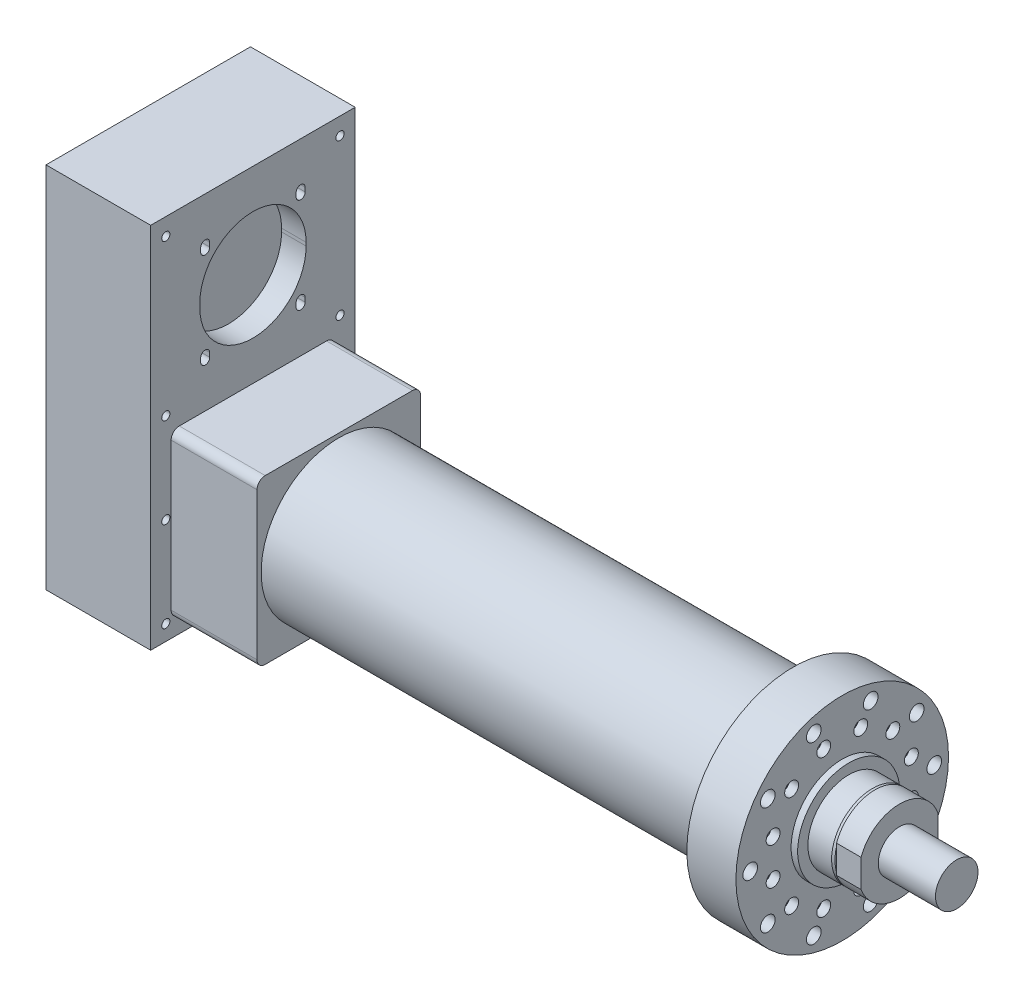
ISO-10303-21;
HEADER;
FILE_DESCRIPTION(('STEP AP214'),'2;1');
FILE_NAME('part.step','',(''),(''),'','','');
FILE_SCHEMA(('AUTOMOTIVE_DESIGN { 1 0 10303 214 1 1 1 1 }'));
ENDSEC;
DATA;
#1=APPLICATION_CONTEXT('core data for automotive mechanical design processes');
#2=APPLICATION_PROTOCOL_DEFINITION('international standard','automotive_design',2000,#1);
#3=PRODUCT_CONTEXT('',#1,'mechanical');
#4=PRODUCT('Part','Part','',(#3));
#5=PRODUCT_RELATED_PRODUCT_CATEGORY('part','',(#4));
#6=PRODUCT_DEFINITION_FORMATION('','',#4);
#7=PRODUCT_DEFINITION_CONTEXT('part definition',#1,'design');
#8=PRODUCT_DEFINITION('design','',#6,#7);
#9=PRODUCT_DEFINITION_SHAPE('','',#8);
#10=(LENGTH_UNIT() NAMED_UNIT(*) SI_UNIT(.MILLI.,.METRE.));
#11=(NAMED_UNIT(*) PLANE_ANGLE_UNIT() SI_UNIT($,.RADIAN.));
#12=(NAMED_UNIT(*) SI_UNIT($,.STERADIAN.) SOLID_ANGLE_UNIT());
#13=UNCERTAINTY_MEASURE_WITH_UNIT(LENGTH_MEASURE(1.E-05),#10,'distance_accuracy_value','');
#14=(GEOMETRIC_REPRESENTATION_CONTEXT(3) GLOBAL_UNCERTAINTY_ASSIGNED_CONTEXT((#13)) GLOBAL_UNIT_ASSIGNED_CONTEXT((#10,
#11,#12)) REPRESENTATION_CONTEXT('',''));
#15=CARTESIAN_POINT('',(0.,0.,0.));
#16=DIRECTION('',(0.,0.,1.));
#17=DIRECTION('',(1.,0.,0.));
#18=AXIS2_PLACEMENT_3D('',#15,#16,#17);
#19=CARTESIAN_POINT('',(755.5,0.,0.));
#20=DIRECTION('',(-1.,0.,0.));
#21=DIRECTION('',(0.,0.,1.));
#22=AXIS2_PLACEMENT_3D('',#19,#20,#21);
#23=CYLINDRICAL_SURFACE('',#22,26.);
#24=CARTESIAN_POINT('',(755.5,0.,0.));
#25=DIRECTION('',(1.,0.,0.));
#26=DIRECTION('',(0.,0.,-1.));
#27=AXIS2_PLACEMENT_3D('',#24,#25,#26);
#28=CIRCLE('',#27,26.);
#29=CARTESIAN_POINT('',(755.5,0.,-26.));
#30=VERTEX_POINT('',#29);
#31=EDGE_CURVE('E12',#30,#30,#28,.T.);
#32=ORIENTED_EDGE('',*,*,#31,.F.);
#33=EDGE_LOOP('',(#32));
#34=FACE_BOUND('',#33,.T.);
#35=CARTESIAN_POINT('',(685.5,0.,0.));
#36=DIRECTION('',(1.,0.,0.));
#37=DIRECTION('',(0.,0.,-1.));
#38=AXIS2_PLACEMENT_3D('',#35,#36,#37);
#39=CIRCLE('',#38,26.);
#40=CARTESIAN_POINT('',(685.5,0.,-26.));
#41=VERTEX_POINT('',#40);
#42=EDGE_CURVE('E141',#41,#41,#39,.T.);
#43=ORIENTED_EDGE('',*,*,#42,.T.);
#44=EDGE_LOOP('',(#43));
#45=FACE_BOUND('',#44,.T.);
#46=ADVANCED_FACE('F138',(#34,#45),#23,.T.);
#47=CARTESIAN_POINT('',(755.5,0.,0.));
#48=DIRECTION('',(1.,0.,0.));
#49=DIRECTION('',(0.,0.,-1.));
#50=AXIS2_PLACEMENT_3D('',#47,#48,#49);
#51=PLANE('',#50);
#52=ORIENTED_EDGE('',*,*,#31,.T.);
#53=EDGE_LOOP('',(#52));
#54=FACE_BOUND('',#53,.T.);
#55=ADVANCED_FACE('F153',(#54),#51,.T.);
#56=CARTESIAN_POINT('',(685.5,0.,0.));
#57=DIRECTION('',(1.,0.,0.));
#58=DIRECTION('',(0.,0.,-1.));
#59=AXIS2_PLACEMENT_3D('',#56,#57,#58);
#60=PLANE('',#59);
#61=ORIENTED_EDGE('',*,*,#42,.F.);
#62=EDGE_LOOP('',(#61));
#63=FACE_BOUND('',#62,.T.);
#64=ADVANCED_FACE('F151',(#63),#60,.F.);
#65=CLOSED_SHELL('',(#46,#55,#64));
#66=MANIFOLD_SOLID_BREP('B2',#65);
#67=CARTESIAN_POINT('',(-105.,0.,0.));
#68=DIRECTION('',(-1.,0.,0.));
#69=DIRECTION('',(0.,0.,1.));
#70=AXIS2_PLACEMENT_3D('',#67,#68,#69);
#71=PLANE('',#70);
#72=CARTESIAN_POINT('',(-105.,275.836309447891,-58.3363094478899));
#73=DIRECTION('',(-1.,0.,0.));
#74=DIRECTION('',(0.,0.,1.));
#75=AXIS2_PLACEMENT_3D('',#72,#73,#74);
#76=CIRCLE('',#75,5.49999999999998);
#77=CARTESIAN_POINT('',(-105.,275.836309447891,-52.8363094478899));
#78=VERTEX_POINT('',#77);
#79=CARTESIAN_POINT('',(-105.,275.836309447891,-63.8363094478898));
#80=VERTEX_POINT('',#79);
#81=EDGE_CURVE('E546',#78,#80,#76,.T.);
#82=ORIENTED_EDGE('',*,*,#81,.T.);
#83=DIRECTION('',(0.,1.,0.));
#84=VECTOR('',#83,1.);
#85=CARTESIAN_POINT('',(-105.,270.83630944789,-63.8363094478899));
#86=LINE('',#85,#84);
#87=CARTESIAN_POINT('',(-105.,270.83630944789,-63.8363094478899));
#88=VERTEX_POINT('',#87);
#89=EDGE_CURVE('E199',#88,#80,#86,.T.);
#90=ORIENTED_EDGE('',*,*,#89,.F.);
#91=CARTESIAN_POINT('',(-105.,270.83630944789,-58.3363094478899));
#92=DIRECTION('',(-1.,0.,0.));
#93=DIRECTION('',(0.,0.,1.));
#94=AXIS2_PLACEMENT_3D('',#91,#92,#93);
#95=CIRCLE('',#94,5.5);
#96=CARTESIAN_POINT('',(-105.,270.83630944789,-52.8363094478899));
#97=VERTEX_POINT('',#96);
#98=EDGE_CURVE('E539',#88,#97,#95,.T.);
#99=ORIENTED_EDGE('',*,*,#98,.T.);
#100=DIRECTION('',(0.,1.,0.));
#101=VECTOR('',#100,1.);
#102=CARTESIAN_POINT('',(-105.,270.83630944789,-52.8363094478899));
#103=LINE('',#102,#101);
#104=EDGE_CURVE('E542',#97,#78,#103,.T.);
#105=ORIENTED_EDGE('',*,*,#104,.T.);
#106=EDGE_LOOP('',(#82,#90,#99,#105));
#107=FACE_BOUND('',#106,.T.);
#108=CARTESIAN_POINT('',(-105.,154.16369055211,-58.3363094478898));
#109=DIRECTION('',(1.,0.,0.));
#110=DIRECTION('',(0.,0.,-1.));
#111=AXIS2_PLACEMENT_3D('',#108,#109,#110);
#112=CIRCLE('',#111,5.49999999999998);
#113=CARTESIAN_POINT('',(-105.,154.16369055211,-52.8363094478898));
#114=VERTEX_POINT('',#113);
#115=CARTESIAN_POINT('',(-105.,154.16369055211,-63.8363094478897));
#116=VERTEX_POINT('',#115);
#117=EDGE_CURVE('E517',#114,#116,#112,.T.);
#118=ORIENTED_EDGE('',*,*,#117,.F.);
#119=DIRECTION('',(0.,-1.,0.));
#120=VECTOR('',#119,1.);
#121=CARTESIAN_POINT('',(-105.,159.16369055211,-52.8363094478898));
#122=LINE('',#121,#120);
#123=CARTESIAN_POINT('',(-105.,159.16369055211,-52.8363094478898));
#124=VERTEX_POINT('',#123);
#125=EDGE_CURVE('E207',#124,#114,#122,.T.);
#126=ORIENTED_EDGE('',*,*,#125,.F.);
#127=CARTESIAN_POINT('',(-105.,159.16369055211,-58.3363094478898));
#128=DIRECTION('',(1.,0.,0.));
#129=DIRECTION('',(0.,0.,-1.));
#130=AXIS2_PLACEMENT_3D('',#127,#128,#129);
#131=CIRCLE('',#130,5.5);
#132=CARTESIAN_POINT('',(-105.,159.16369055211,-63.8363094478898));
#133=VERTEX_POINT('',#132);
#134=EDGE_CURVE('E510',#133,#124,#131,.T.);
#135=ORIENTED_EDGE('',*,*,#134,.F.);
#136=DIRECTION('',(0.,-1.,0.));
#137=VECTOR('',#136,1.);
#138=CARTESIAN_POINT('',(-105.,159.16369055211,-63.8363094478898));
#139=LINE('',#138,#137);
#140=EDGE_CURVE('E513',#133,#116,#139,.T.);
#141=ORIENTED_EDGE('',*,*,#140,.T.);
#142=EDGE_LOOP('',(#118,#126,#135,#141));
#143=FACE_BOUND('',#142,.T.);
#144=DIRECTION('',(0.,1.,0.));
#145=VECTOR('',#144,1.);
#146=CARTESIAN_POINT('',(-105.,270.83630944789,63.8363094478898));
#147=LINE('',#146,#145);
#148=CARTESIAN_POINT('',(-105.,270.83630944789,63.8363094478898));
#149=VERTEX_POINT('',#148);
#150=CARTESIAN_POINT('',(-105.,275.836309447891,63.8363094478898));
#151=VERTEX_POINT('',#150);
#152=EDGE_CURVE('E455',#149,#151,#147,.T.);
#153=ORIENTED_EDGE('',*,*,#152,.T.);
#154=CARTESIAN_POINT('',(-105.,275.836309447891,58.3363094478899));
#155=DIRECTION('',(1.,0.,0.));
#156=DIRECTION('',(0.,0.,-1.));
#157=AXIS2_PLACEMENT_3D('',#154,#155,#156);
#158=CIRCLE('',#157,5.49999999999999);
#159=CARTESIAN_POINT('',(-105.,275.836309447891,52.8363094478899));
#160=VERTEX_POINT('',#159);
#161=EDGE_CURVE('E453',#160,#151,#158,.T.);
#162=ORIENTED_EDGE('',*,*,#161,.F.);
#163=DIRECTION('',(0.,1.,0.));
#164=VECTOR('',#163,1.);
#165=CARTESIAN_POINT('',(-105.,270.83630944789,52.8363094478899));
#166=LINE('',#165,#164);
#167=CARTESIAN_POINT('',(-105.,270.83630944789,52.8363094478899));
#168=VERTEX_POINT('',#167);
#169=EDGE_CURVE('E433',#168,#160,#166,.T.);
#170=ORIENTED_EDGE('',*,*,#169,.F.);
#171=CARTESIAN_POINT('',(-105.,270.83630944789,58.3363094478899));
#172=DIRECTION('',(1.,0.,0.));
#173=DIRECTION('',(0.,0.,-1.));
#174=AXIS2_PLACEMENT_3D('',#171,#172,#173);
#175=CIRCLE('',#174,5.49999999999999);
#176=EDGE_CURVE('E445',#149,#168,#175,.T.);
#177=ORIENTED_EDGE('',*,*,#176,.F.);
#178=EDGE_LOOP('',(#153,#162,#170,#177));
#179=FACE_BOUND('',#178,.T.);
#180=DIRECTION('',(0.,0.,1.));
#181=VECTOR('',#180,1.);
#182=CARTESIAN_POINT('',(-105.,-100.,-90.));
#183=LINE('',#182,#181);
#184=CARTESIAN_POINT('',(-105.,-100.,-90.));
#185=VERTEX_POINT('',#184);
#186=CARTESIAN_POINT('',(-105.,-100.,89.9999999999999));
#187=VERTEX_POINT('',#186);
#188=EDGE_CURVE('E689',#185,#187,#183,.T.);
#189=ORIENTED_EDGE('',*,*,#188,.T.);
#190=CARTESIAN_POINT('',(-105.,-90.,90.));
#191=DIRECTION('',(-1.,0.,0.));
#192=DIRECTION('',(0.,0.,-1.));
#193=AXIS2_PLACEMENT_3D('',#190,#191,#192);
#194=CIRCLE('',#193,9.99999999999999);
#195=CARTESIAN_POINT('',(-105.,-90.,100.));
#196=VERTEX_POINT('',#195);
#197=EDGE_CURVE('E667',#187,#196,#194,.T.);
#198=ORIENTED_EDGE('',*,*,#197,.T.);
#199=DIRECTION('',(0.,1.,0.));
#200=VECTOR('',#199,1.);
#201=CARTESIAN_POINT('',(-105.,89.9999999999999,99.9999999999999));
#202=LINE('',#201,#200);
#203=CARTESIAN_POINT('',(-105.,89.9999999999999,99.9999999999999));
#204=VERTEX_POINT('',#203);
#205=EDGE_CURVE('E670',#196,#204,#202,.T.);
#206=ORIENTED_EDGE('',*,*,#205,.T.);
#207=CARTESIAN_POINT('',(-105.,90.,90.));
#208=DIRECTION('',(-1.,0.,0.));
#209=DIRECTION('',(0.,0.,1.));
#210=AXIS2_PLACEMENT_3D('',#207,#208,#209);
#211=CIRCLE('',#210,9.99999999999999);
#212=CARTESIAN_POINT('',(-105.,100.,89.9999999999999));
#213=VERTEX_POINT('',#212);
#214=EDGE_CURVE('E674',#204,#213,#211,.T.);
#215=ORIENTED_EDGE('',*,*,#214,.T.);
#216=DIRECTION('',(0.,0.,-1.));
#217=VECTOR('',#216,1.);
#218=CARTESIAN_POINT('',(-105.,100.,-90.));
#219=LINE('',#218,#217);
#220=CARTESIAN_POINT('',(-105.,100.,-90.));
#221=VERTEX_POINT('',#220);
#222=EDGE_CURVE('E677',#213,#221,#219,.T.);
#223=ORIENTED_EDGE('',*,*,#222,.T.);
#224=CARTESIAN_POINT('',(-105.,90.,-90.0000000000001));
#225=DIRECTION('',(-1.,0.,0.));
#226=DIRECTION('',(0.,0.,-1.));
#227=AXIS2_PLACEMENT_3D('',#224,#225,#226);
#228=CIRCLE('',#227,9.99999999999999);
#229=CARTESIAN_POINT('',(-105.,89.9999999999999,-100.));
#230=VERTEX_POINT('',#229);
#231=EDGE_CURVE('E680',#221,#230,#228,.T.);
#232=ORIENTED_EDGE('',*,*,#231,.T.);
#233=DIRECTION('',(0.,-1.,0.));
#234=VECTOR('',#233,1.);
#235=CARTESIAN_POINT('',(-105.,89.9999999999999,-100.));
#236=LINE('',#235,#234);
#237=CARTESIAN_POINT('',(-105.,-90.,-100.));
#238=VERTEX_POINT('',#237);
#239=EDGE_CURVE('E683',#230,#238,#236,.T.);
#240=ORIENTED_EDGE('',*,*,#239,.T.);
#241=CARTESIAN_POINT('',(-105.,-90.,-90.0000000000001));
#242=DIRECTION('',(-1.,0.,0.));
#243=DIRECTION('',(0.,0.,-1.));
#244=AXIS2_PLACEMENT_3D('',#241,#242,#243);
#245=CIRCLE('',#244,9.99999999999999);
#246=EDGE_CURVE('E686',#238,#185,#245,.T.);
#247=ORIENTED_EDGE('',*,*,#246,.T.);
#248=EDGE_LOOP('',(#189,#198,#206,#215,#223,#232,#240,#247));
#249=FACE_BOUND('',#248,.T.);
#250=DIRECTION('',(0.,1.,0.));
#251=VECTOR('',#250,1.);
#252=CARTESIAN_POINT('',(-105.,330.,125.));
#253=LINE('',#252,#251);
#254=CARTESIAN_POINT('',(-105.,-120.,125.));
#255=VERTEX_POINT('',#254);
#256=CARTESIAN_POINT('',(-105.,330.,125.));
#257=VERTEX_POINT('',#256);
#258=EDGE_CURVE('E634',#255,#257,#253,.T.);
#259=ORIENTED_EDGE('',*,*,#258,.F.);
#260=DIRECTION('',(0.,0.,1.));
#261=VECTOR('',#260,1.);
#262=CARTESIAN_POINT('',(-105.,-120.,-125.));
#263=LINE('',#262,#261);
#264=CARTESIAN_POINT('',(-105.,-120.,-125.));
#265=VERTEX_POINT('',#264);
#266=EDGE_CURVE('E641',#265,#255,#263,.T.);
#267=ORIENTED_EDGE('',*,*,#266,.F.);
#268=DIRECTION('',(0.,-1.,0.));
#269=VECTOR('',#268,1.);
#270=CARTESIAN_POINT('',(-105.,330.,-125.));
#271=LINE('',#270,#269);
#272=CARTESIAN_POINT('',(-105.,330.,-125.));
#273=VERTEX_POINT('',#272);
#274=EDGE_CURVE('E652',#273,#265,#271,.T.);
#275=ORIENTED_EDGE('',*,*,#274,.F.);
#276=DIRECTION('',(0.,0.,-1.));
#277=VECTOR('',#276,1.);
#278=CARTESIAN_POINT('',(-105.,330.,-125.));
#279=LINE('',#278,#277);
#280=EDGE_CURVE('E650',#257,#273,#279,.T.);
#281=ORIENTED_EDGE('',*,*,#280,.F.);
#282=EDGE_LOOP('',(#259,#267,#275,#281));
#283=FACE_BOUND('',#282,.T.);
#284=CARTESIAN_POINT('',(-105.,309.,106.5));
#285=DIRECTION('',(1.,0.,0.));
#286=DIRECTION('',(0.,0.,-1.));
#287=AXIS2_PLACEMENT_3D('',#284,#285,#286);
#288=CIRCLE('',#287,5.00000000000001);
#289=CARTESIAN_POINT('',(-105.,309.,101.5));
#290=VERTEX_POINT('',#289);
#291=EDGE_CURVE('E622',#290,#290,#288,.T.);
#292=ORIENTED_EDGE('',*,*,#291,.F.);
#293=EDGE_LOOP('',(#292));
#294=FACE_BOUND('',#293,.T.);
#295=CARTESIAN_POINT('',(-105.,309.,-106.5));
#296=DIRECTION('',(1.,0.,0.));
#297=DIRECTION('',(0.,0.,-1.));
#298=AXIS2_PLACEMENT_3D('',#295,#296,#297);
#299=CIRCLE('',#298,5.00000000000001);
#300=CARTESIAN_POINT('',(-105.,309.,-111.5));
#301=VERTEX_POINT('',#300);
#302=EDGE_CURVE('E602',#301,#301,#299,.T.);
#303=ORIENTED_EDGE('',*,*,#302,.F.);
#304=EDGE_LOOP('',(#303));
#305=FACE_BOUND('',#304,.T.);
#306=CARTESIAN_POINT('',(-105.,-101.,-106.500000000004));
#307=DIRECTION('',(1.,0.,0.));
#308=DIRECTION('',(0.,0.,-1.));
#309=AXIS2_PLACEMENT_3D('',#306,#307,#308);
#310=CIRCLE('',#309,5.00000000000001);
#311=CARTESIAN_POINT('',(-105.,-101.,-111.500000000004));
#312=VERTEX_POINT('',#311);
#313=EDGE_CURVE('E596',#312,#312,#310,.T.);
#314=ORIENTED_EDGE('',*,*,#313,.F.);
#315=EDGE_LOOP('',(#314));
#316=FACE_BOUND('',#315,.T.);
#317=CARTESIAN_POINT('',(-105.,8.99999999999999,-106.500000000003));
#318=DIRECTION('',(1.,0.,0.));
#319=DIRECTION('',(0.,0.,-1.));
#320=AXIS2_PLACEMENT_3D('',#317,#318,#319);
#321=CIRCLE('',#320,5.00000000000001);
#322=CARTESIAN_POINT('',(-105.,8.99999999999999,-111.500000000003));
#323=VERTEX_POINT('',#322);
#324=EDGE_CURVE('E589',#323,#323,#321,.T.);
#325=ORIENTED_EDGE('',*,*,#324,.F.);
#326=EDGE_LOOP('',(#325));
#327=FACE_BOUND('',#326,.T.);
#328=CARTESIAN_POINT('',(-105.,119.,106.499999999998));
#329=DIRECTION('',(1.,0.,0.));
#330=DIRECTION('',(0.,0.,-1.));
#331=AXIS2_PLACEMENT_3D('',#328,#329,#330);
#332=CIRCLE('',#331,5.00000000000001);
#333=CARTESIAN_POINT('',(-105.,119.,101.499999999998));
#334=VERTEX_POINT('',#333);
#335=EDGE_CURVE('E619',#334,#334,#332,.T.);
#336=ORIENTED_EDGE('',*,*,#335,.F.);
#337=EDGE_LOOP('',(#336));
#338=FACE_BOUND('',#337,.T.);
#339=CARTESIAN_POINT('',(-105.,8.99999999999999,106.499999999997));
#340=DIRECTION('',(1.,0.,0.));
#341=DIRECTION('',(0.,0.,-1.));
#342=AXIS2_PLACEMENT_3D('',#339,#340,#341);
#343=CIRCLE('',#342,5.00000000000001);
#344=CARTESIAN_POINT('',(-105.,8.99999999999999,101.499999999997));
#345=VERTEX_POINT('',#344);
#346=EDGE_CURVE('E626',#345,#345,#343,.T.);
#347=ORIENTED_EDGE('',*,*,#346,.F.);
#348=EDGE_LOOP('',(#347));
#349=FACE_BOUND('',#348,.T.);
#350=CARTESIAN_POINT('',(-105.,-101.,106.499999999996));
#351=DIRECTION('',(1.,0.,0.));
#352=DIRECTION('',(0.,0.,-1.));
#353=AXIS2_PLACEMENT_3D('',#350,#351,#352);
#354=CIRCLE('',#353,5.00000000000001);
#355=CARTESIAN_POINT('',(-105.,-101.,101.499999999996));
#356=VERTEX_POINT('',#355);
#357=EDGE_CURVE('E607',#356,#356,#354,.T.);
#358=ORIENTED_EDGE('',*,*,#357,.F.);
#359=EDGE_LOOP('',(#358));
#360=FACE_BOUND('',#359,.T.);
#361=CARTESIAN_POINT('',(-105.,119.,-106.500000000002));
#362=DIRECTION('',(1.,0.,0.));
#363=DIRECTION('',(0.,0.,-1.));
#364=AXIS2_PLACEMENT_3D('',#361,#362,#363);
#365=CIRCLE('',#364,5.00000000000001);
#366=CARTESIAN_POINT('',(-105.,119.,-111.500000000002));
#367=VERTEX_POINT('',#366);
#368=EDGE_CURVE('E614',#367,#367,#365,.T.);
#369=ORIENTED_EDGE('',*,*,#368,.F.);
#370=EDGE_LOOP('',(#369));
#371=FACE_BOUND('',#370,.T.);
#372=DIRECTION('',(0.,-1.,0.));
#373=VECTOR('',#372,1.);
#374=CARTESIAN_POINT('',(-105.,217.,-65.));
#375=LINE('',#374,#373);
#376=CARTESIAN_POINT('',(-105.,217.,-65.));
#377=VERTEX_POINT('',#376);
#378=CARTESIAN_POINT('',(-105.,213.,-65.));
#379=VERTEX_POINT('',#378);
#380=EDGE_CURVE('E460',#377,#379,#375,.T.);
#381=ORIENTED_EDGE('',*,*,#380,.T.);
#382=CARTESIAN_POINT('',(-105.,213.,0.));
#383=DIRECTION('',(1.,0.,0.));
#384=DIRECTION('',(0.,0.,-1.));
#385=AXIS2_PLACEMENT_3D('',#382,#383,#384);
#386=CIRCLE('',#385,65.);
#387=CARTESIAN_POINT('',(-105.,213.,65.));
#388=VERTEX_POINT('',#387);
#389=EDGE_CURVE('E572',#388,#379,#386,.T.);
#390=ORIENTED_EDGE('',*,*,#389,.F.);
#391=DIRECTION('',(0.,-1.,0.));
#392=VECTOR('',#391,1.);
#393=CARTESIAN_POINT('',(-105.,217.,65.));
#394=LINE('',#393,#392);
#395=CARTESIAN_POINT('',(-105.,217.,65.));
#396=VERTEX_POINT('',#395);
#397=EDGE_CURVE('E575',#396,#388,#394,.T.);
#398=ORIENTED_EDGE('',*,*,#397,.F.);
#399=CARTESIAN_POINT('',(-105.,217.,0.));
#400=DIRECTION('',(1.,0.,0.));
#401=DIRECTION('',(0.,0.,-1.));
#402=AXIS2_PLACEMENT_3D('',#399,#400,#401);
#403=CIRCLE('',#402,65.);
#404=EDGE_CURVE('E560',#377,#396,#403,.T.);
#405=ORIENTED_EDGE('',*,*,#404,.F.);
#406=EDGE_LOOP('',(#381,#390,#398,#405));
#407=FACE_BOUND('',#406,.T.);
#408=DIRECTION('',(0.,-1.,0.));
#409=VECTOR('',#408,1.);
#410=CARTESIAN_POINT('',(-105.,159.16369055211,52.8363094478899));
#411=LINE('',#410,#409);
#412=CARTESIAN_POINT('',(-105.,159.16369055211,52.8363094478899));
#413=VERTEX_POINT('',#412);
#414=CARTESIAN_POINT('',(-105.,154.16369055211,52.8363094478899));
#415=VERTEX_POINT('',#414);
#416=EDGE_CURVE('E489',#413,#415,#411,.T.);
#417=ORIENTED_EDGE('',*,*,#416,.T.);
#418=CARTESIAN_POINT('',(-105.,154.16369055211,58.3363094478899));
#419=DIRECTION('',(-1.,0.,0.));
#420=DIRECTION('',(0.,0.,1.));
#421=AXIS2_PLACEMENT_3D('',#418,#419,#420);
#422=CIRCLE('',#421,5.49999999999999);
#423=CARTESIAN_POINT('',(-105.,154.16369055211,63.8363094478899));
#424=VERTEX_POINT('',#423);
#425=EDGE_CURVE('E486',#415,#424,#422,.T.);
#426=ORIENTED_EDGE('',*,*,#425,.T.);
#427=DIRECTION('',(0.,-1.,0.));
#428=VECTOR('',#427,1.);
#429=CARTESIAN_POINT('',(-105.,159.16369055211,63.8363094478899));
#430=LINE('',#429,#428);
#431=CARTESIAN_POINT('',(-105.,159.16369055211,63.8363094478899));
#432=VERTEX_POINT('',#431);
#433=EDGE_CURVE('E482',#432,#424,#430,.T.);
#434=ORIENTED_EDGE('',*,*,#433,.F.);
#435=CARTESIAN_POINT('',(-105.,159.16369055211,58.3363094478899));
#436=DIRECTION('',(-1.,0.,0.));
#437=DIRECTION('',(0.,0.,1.));
#438=AXIS2_PLACEMENT_3D('',#435,#436,#437);
#439=CIRCLE('',#438,5.49999999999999);
#440=EDGE_CURVE('E479',#432,#413,#439,.T.);
#441=ORIENTED_EDGE('',*,*,#440,.T.);
#442=EDGE_LOOP('',(#417,#426,#434,#441));
#443=FACE_BOUND('',#442,.T.);
#444=ADVANCED_FACE('F179',(#107,#143,#179,#249,#283,#294,#305,#316,#327,#338,#349,#360,#371,
#407,#443),#71,.F.);
#445=CARTESIAN_POINT('',(655.5,0.,0.));
#446=DIRECTION('',(1.,0.,0.));
#447=DIRECTION('',(0.,0.,-1.));
#448=AXIS2_PLACEMENT_3D('',#445,#446,#447);
#449=PLANE('',#448);
#450=CARTESIAN_POINT('',(655.5,0.,0.));
#451=DIRECTION('',(1.,0.,0.));
#452=DIRECTION('',(0.,0.,-1.));
#453=AXIS2_PLACEMENT_3D('',#450,#451,#452);
#454=CIRCLE('',#453,48.9080892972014);
#455=CARTESIAN_POINT('',(655.5,-13.5277935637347,-47.));
#456=VERTEX_POINT('',#455);
#457=CARTESIAN_POINT('',(655.5,13.5277935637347,-47.));
#458=VERTEX_POINT('',#457);
#459=EDGE_CURVE('E772',#456,#458,#454,.T.);
#460=ORIENTED_EDGE('',*,*,#459,.T.);
#461=DIRECTION('',(0.,-1.,0.));
#462=VECTOR('',#461,1.);
#463=CARTESIAN_POINT('',(655.5,17.058722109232,-47.));
#464=LINE('',#463,#462);
#465=EDGE_CURVE('E136',#458,#456,#464,.T.);
#466=ORIENTED_EDGE('',*,*,#465,.T.);
#467=EDGE_LOOP('',(#460,#466));
#468=FACE_BOUND('',#467,.T.);
#469=ADVANCED_FACE('F1103',(#468),#449,.T.);
#470=CARTESIAN_POINT('',(555.5,106.993858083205,34.7644118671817));
#471=DIRECTION('',(1.,0.,0.));
#472=DIRECTION('',(0.,0.,-1.));
#473=AXIS2_PLACEMENT_3D('',#470,#471,#472);
#474=CYLINDRICAL_SURFACE('',#473,9.00000000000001);
#475=CARTESIAN_POINT('',(615.5,106.993858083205,34.7644118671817));
#476=DIRECTION('',(1.,0.,0.));
#477=DIRECTION('',(0.,0.,-1.));
#478=AXIS2_PLACEMENT_3D('',#475,#476,#477);
#479=CIRCLE('',#478,9.00000000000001);
#480=CARTESIAN_POINT('',(615.5,106.993858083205,25.7644118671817));
#481=VERTEX_POINT('',#480);
#482=EDGE_CURVE('E915',#481,#481,#479,.T.);
#483=ORIENTED_EDGE('',*,*,#482,.T.);
#484=EDGE_LOOP('',(#483));
#485=FACE_BOUND('',#484,.T.);
#486=CARTESIAN_POINT('',(572.5,106.993858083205,34.7644118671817));
#487=DIRECTION('',(-1.,0.,0.));
#488=DIRECTION('',(0.,0.,1.));
#489=AXIS2_PLACEMENT_3D('',#486,#487,#488);
#490=CIRCLE('',#489,9.00000000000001);
#491=CARTESIAN_POINT('',(572.5,106.993858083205,43.7644118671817));
#492=VERTEX_POINT('',#491);
#493=EDGE_CURVE('E924',#492,#492,#490,.F.);
#494=ORIENTED_EDGE('',*,*,#493,.F.);
#495=EDGE_LOOP('',(#494));
#496=FACE_BOUND('',#495,.T.);
#497=ADVANCED_FACE('F1111',(#485,#496),#474,.F.);
#498=CARTESIAN_POINT('',(555.5,66.1258408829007,91.01441186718));
#499=DIRECTION('',(1.,0.,0.));
#500=DIRECTION('',(0.,0.,-1.));
#501=AXIS2_PLACEMENT_3D('',#498,#499,#500);
#502=CYLINDRICAL_SURFACE('',#501,9.00000000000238);
#503=CARTESIAN_POINT('',(615.5,66.1258408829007,91.01441186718));
#504=DIRECTION('',(1.,0.,0.));
#505=DIRECTION('',(0.,0.,-1.));
#506=AXIS2_PLACEMENT_3D('',#503,#504,#505);
#507=CIRCLE('',#506,9.00000000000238);
#508=CARTESIAN_POINT('',(615.5,66.1258408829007,82.0144118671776));
#509=VERTEX_POINT('',#508);
#510=EDGE_CURVE('E908',#509,#509,#507,.T.);
#511=ORIENTED_EDGE('',*,*,#510,.T.);
#512=EDGE_LOOP('',(#511));
#513=FACE_BOUND('',#512,.T.);
#514=CARTESIAN_POINT('',(572.5,66.1258408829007,91.01441186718));
#515=DIRECTION('',(-1.,0.,0.));
#516=DIRECTION('',(0.,0.,1.));
#517=AXIS2_PLACEMENT_3D('',#514,#515,#516);
#518=CIRCLE('',#517,9.00000000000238);
#519=CARTESIAN_POINT('',(572.5,66.1258408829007,100.014411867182));
#520=VERTEX_POINT('',#519);
#521=EDGE_CURVE('E1020',#520,#520,#518,.F.);
#522=ORIENTED_EDGE('',*,*,#521,.F.);
#523=EDGE_LOOP('',(#522));
#524=FACE_BOUND('',#523,.T.);
#525=ADVANCED_FACE('F1374',(#513,#524),#502,.F.);
#526=CARTESIAN_POINT('',(555.5,66.1258408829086,-91.0144118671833));
#527=DIRECTION('',(1.,0.,0.));
#528=DIRECTION('',(0.,0.,-1.));
#529=AXIS2_PLACEMENT_3D('',#526,#527,#528);
#530=CYLINDRICAL_SURFACE('',#529,9.00000000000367);
#531=CARTESIAN_POINT('',(615.5,66.1258408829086,-91.0144118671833));
#532=DIRECTION('',(1.,0.,0.));
#533=DIRECTION('',(0.,0.,-1.));
#534=AXIS2_PLACEMENT_3D('',#531,#532,#533);
#535=CIRCLE('',#534,9.00000000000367);
#536=CARTESIAN_POINT('',(615.5,66.1258408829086,-100.014411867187));
#537=VERTEX_POINT('',#536);
#538=EDGE_CURVE('E949',#537,#537,#535,.T.);
#539=ORIENTED_EDGE('',*,*,#538,.T.);
#540=EDGE_LOOP('',(#539));
#541=FACE_BOUND('',#540,.T.);
#542=CARTESIAN_POINT('',(572.5,66.1258408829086,-91.0144118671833));
#543=DIRECTION('',(-1.,0.,0.));
#544=DIRECTION('',(0.,0.,1.));
#545=AXIS2_PLACEMENT_3D('',#542,#543,#544);
#546=CIRCLE('',#545,9.00000000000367);
#547=CARTESIAN_POINT('',(572.5,66.1258408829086,-82.0144118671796));
#548=VERTEX_POINT('',#547);
#549=EDGE_CURVE('E1017',#548,#548,#546,.F.);
#550=ORIENTED_EDGE('',*,*,#549,.F.);
#551=EDGE_LOOP('',(#550));
#552=FACE_BOUND('',#551,.T.);
#553=ADVANCED_FACE('F1377',(#541,#552),#530,.F.);
#554=CARTESIAN_POINT('',(555.5,106.993858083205,-34.7644118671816));
#555=DIRECTION('',(1.,0.,0.));
#556=DIRECTION('',(0.,0.,-1.));
#557=AXIS2_PLACEMENT_3D('',#554,#555,#556);
#558=CYLINDRICAL_SURFACE('',#557,9.00000000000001);
#559=CARTESIAN_POINT('',(615.5,106.993858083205,-34.7644118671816));
#560=DIRECTION('',(1.,0.,0.));
#561=DIRECTION('',(0.,0.,-1.));
#562=AXIS2_PLACEMENT_3D('',#559,#560,#561);
#563=CIRCLE('',#562,9.00000000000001);
#564=CARTESIAN_POINT('',(615.5,106.993858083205,-43.7644118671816));
#565=VERTEX_POINT('',#564);
#566=EDGE_CURVE('E956',#565,#565,#563,.T.);
#567=ORIENTED_EDGE('',*,*,#566,.T.);
#568=EDGE_LOOP('',(#567));
#569=FACE_BOUND('',#568,.T.);
#570=CARTESIAN_POINT('',(572.5,106.993858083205,-34.7644118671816));
#571=DIRECTION('',(-1.,0.,0.));
#572=DIRECTION('',(0.,0.,1.));
#573=AXIS2_PLACEMENT_3D('',#570,#571,#572);
#574=CIRCLE('',#573,9.00000000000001);
#575=CARTESIAN_POINT('',(572.5,106.993858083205,-25.7644118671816));
#576=VERTEX_POINT('',#575);
#577=EDGE_CURVE('E1014',#576,#576,#574,.F.);
#578=ORIENTED_EDGE('',*,*,#577,.F.);
#579=EDGE_LOOP('',(#578));
#580=FACE_BOUND('',#579,.T.);
#581=ADVANCED_FACE('F1460',(#569,#580),#558,.F.);
#582=CARTESIAN_POINT('',(555.5,6.32420037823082E-12,-112.500000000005));
#583=DIRECTION('',(1.,0.,0.));
#584=DIRECTION('',(0.,0.,-1.));
#585=AXIS2_PLACEMENT_3D('',#582,#583,#584);
#586=CYLINDRICAL_SURFACE('',#585,9.00000000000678);
#587=CARTESIAN_POINT('',(615.5,6.32420037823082E-12,-112.500000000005));
#588=DIRECTION('',(1.,0.,0.));
#589=DIRECTION('',(0.,0.,-1.));
#590=AXIS2_PLACEMENT_3D('',#587,#588,#589);
#591=CIRCLE('',#590,9.00000000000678);
#592=CARTESIAN_POINT('',(615.5,6.32420037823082E-12,-121.500000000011));
#593=VERTEX_POINT('',#592);
#594=EDGE_CURVE('E962',#593,#593,#591,.T.);
#595=ORIENTED_EDGE('',*,*,#594,.T.);
#596=EDGE_LOOP('',(#595));
#597=FACE_BOUND('',#596,.T.);
#598=CARTESIAN_POINT('',(572.5,6.32420037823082E-12,-112.500000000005));
#599=DIRECTION('',(-1.,0.,0.));
#600=DIRECTION('',(0.,0.,1.));
#601=AXIS2_PLACEMENT_3D('',#598,#599,#600);
#602=CIRCLE('',#601,9.00000000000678);
#603=CARTESIAN_POINT('',(572.5,6.32420037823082E-12,-103.499999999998));
#604=VERTEX_POINT('',#603);
#605=EDGE_CURVE('E1011',#604,#604,#602,.F.);
#606=ORIENTED_EDGE('',*,*,#605,.F.);
#607=EDGE_LOOP('',(#606));
#608=FACE_BOUND('',#607,.T.);
#609=ADVANCED_FACE('F1472',(#597,#608),#586,.F.);
#610=CARTESIAN_POINT('',(555.5,-66.1258408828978,-91.014411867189));
#611=DIRECTION('',(1.,0.,0.));
#612=DIRECTION('',(0.,0.,-1.));
#613=AXIS2_PLACEMENT_3D('',#610,#611,#612);
#614=CYLINDRICAL_SURFACE('',#613,9.00000000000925);
#615=CARTESIAN_POINT('',(615.5,-66.1258408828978,-91.014411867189));
#616=DIRECTION('',(1.,0.,0.));
#617=DIRECTION('',(0.,0.,-1.));
#618=AXIS2_PLACEMENT_3D('',#615,#616,#617);
#619=CIRCLE('',#618,9.00000000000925);
#620=CARTESIAN_POINT('',(615.5,-66.1258408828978,-100.014411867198));
#621=VERTEX_POINT('',#620);
#622=EDGE_CURVE('E968',#621,#621,#619,.T.);
#623=ORIENTED_EDGE('',*,*,#622,.T.);
#624=EDGE_LOOP('',(#623));
#625=FACE_BOUND('',#624,.T.);
#626=CARTESIAN_POINT('',(572.5,-66.1258408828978,-91.014411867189));
#627=DIRECTION('',(-1.,0.,0.));
#628=DIRECTION('',(0.,0.,1.));
#629=AXIS2_PLACEMENT_3D('',#626,#627,#628);
#630=CIRCLE('',#629,9.00000000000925);
#631=CARTESIAN_POINT('',(572.5,-66.1258408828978,-82.0144118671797));
#632=VERTEX_POINT('',#631);
#633=EDGE_CURVE('E1008',#632,#632,#630,.F.);
#634=ORIENTED_EDGE('',*,*,#633,.F.);
#635=EDGE_LOOP('',(#634));
#636=FACE_BOUND('',#635,.T.);
#637=ADVANCED_FACE('F1422',(#625,#636),#614,.F.);
#638=CARTESIAN_POINT('',(555.5,-106.993858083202,-34.7644118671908));
#639=DIRECTION('',(1.,0.,0.));
#640=DIRECTION('',(0.,0.,-1.));
#641=AXIS2_PLACEMENT_3D('',#638,#639,#640);
#642=CYLINDRICAL_SURFACE('',#641,9.00000000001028);
#643=CARTESIAN_POINT('',(615.5,-106.993858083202,-34.7644118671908));
#644=DIRECTION('',(1.,0.,0.));
#645=DIRECTION('',(0.,0.,-1.));
#646=AXIS2_PLACEMENT_3D('',#643,#644,#645);
#647=CIRCLE('',#646,9.00000000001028);
#648=CARTESIAN_POINT('',(615.5,-106.993858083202,-43.764411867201));
#649=VERTEX_POINT('',#648);
#650=EDGE_CURVE('E929',#649,#649,#647,.T.);
#651=ORIENTED_EDGE('',*,*,#650,.T.);
#652=EDGE_LOOP('',(#651));
#653=FACE_BOUND('',#652,.T.);
#654=CARTESIAN_POINT('',(572.5,-106.993858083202,-34.7644118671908));
#655=DIRECTION('',(-1.,0.,0.));
#656=DIRECTION('',(0.,0.,1.));
#657=AXIS2_PLACEMENT_3D('',#654,#655,#656);
#658=CIRCLE('',#657,9.00000000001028);
#659=CARTESIAN_POINT('',(572.5,-106.993858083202,-25.7644118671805));
#660=VERTEX_POINT('',#659);
#661=EDGE_CURVE('E1005',#660,#660,#658,.F.);
#662=ORIENTED_EDGE('',*,*,#661,.F.);
#663=EDGE_LOOP('',(#662));
#664=FACE_BOUND('',#663,.T.);
#665=ADVANCED_FACE('F1418',(#653,#664),#642,.F.);
#666=CARTESIAN_POINT('',(555.5,-106.993858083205,34.7644118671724));
#667=DIRECTION('',(1.,0.,0.));
#668=DIRECTION('',(0.,0.,-1.));
#669=AXIS2_PLACEMENT_3D('',#666,#667,#668);
#670=CYLINDRICAL_SURFACE('',#669,9.00000000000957);
#671=CARTESIAN_POINT('',(615.5,-106.993858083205,34.7644118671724));
#672=DIRECTION('',(1.,0.,0.));
#673=DIRECTION('',(0.,0.,-1.));
#674=AXIS2_PLACEMENT_3D('',#671,#672,#673);
#675=CIRCLE('',#674,9.00000000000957);
#676=CARTESIAN_POINT('',(615.5,-106.993858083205,25.7644118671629));
#677=VERTEX_POINT('',#676);
#678=EDGE_CURVE('E932',#677,#677,#675,.T.);
#679=ORIENTED_EDGE('',*,*,#678,.T.);
#680=EDGE_LOOP('',(#679));
#681=FACE_BOUND('',#680,.T.);
#682=CARTESIAN_POINT('',(572.5,-106.993858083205,34.7644118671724));
#683=DIRECTION('',(-1.,0.,0.));
#684=DIRECTION('',(0.,0.,1.));
#685=AXIS2_PLACEMENT_3D('',#682,#683,#684);
#686=CIRCLE('',#685,9.00000000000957);
#687=CARTESIAN_POINT('',(572.5,-106.993858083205,43.764411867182));
#688=VERTEX_POINT('',#687);
#689=EDGE_CURVE('E1002',#688,#688,#686,.F.);
#690=ORIENTED_EDGE('',*,*,#689,.F.);
#691=EDGE_LOOP('',(#690));
#692=FACE_BOUND('',#691,.T.);
#693=ADVANCED_FACE('F1421',(#681,#692),#670,.F.);
#694=CARTESIAN_POINT('',(555.5,-66.1258408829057,91.0144118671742));
#695=DIRECTION('',(1.,0.,0.));
#696=DIRECTION('',(0.,0.,-1.));
#697=AXIS2_PLACEMENT_3D('',#694,#695,#696);
#698=CYLINDRICAL_SURFACE('',#697,9.00000000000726);
#699=CARTESIAN_POINT('',(615.5,-66.1258408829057,91.0144118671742));
#700=DIRECTION('',(1.,0.,0.));
#701=DIRECTION('',(0.,0.,-1.));
#702=AXIS2_PLACEMENT_3D('',#699,#700,#701);
#703=CIRCLE('',#702,9.00000000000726);
#704=CARTESIAN_POINT('',(615.5,-66.1258408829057,82.014411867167));
#705=VERTEX_POINT('',#704);
#706=EDGE_CURVE('E941',#705,#705,#703,.T.);
#707=ORIENTED_EDGE('',*,*,#706,.T.);
#708=EDGE_LOOP('',(#707));
#709=FACE_BOUND('',#708,.T.);
#710=CARTESIAN_POINT('',(572.5,-66.1258408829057,91.0144118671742));
#711=DIRECTION('',(-1.,0.,0.));
#712=DIRECTION('',(0.,0.,1.));
#713=AXIS2_PLACEMENT_3D('',#710,#711,#712);
#714=CIRCLE('',#713,9.00000000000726);
#715=CARTESIAN_POINT('',(572.5,-66.1258408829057,100.014411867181));
#716=VERTEX_POINT('',#715);
#717=EDGE_CURVE('E999',#716,#716,#714,.F.);
#718=ORIENTED_EDGE('',*,*,#717,.F.);
#719=EDGE_LOOP('',(#718));
#720=FACE_BOUND('',#719,.T.);
#721=ADVANCED_FACE('F1426',(#709,#720),#698,.F.);
#722=CARTESIAN_POINT('',(555.5,-3.45149830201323E-12,112.499999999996));
#723=DIRECTION('',(1.,0.,0.));
#724=DIRECTION('',(0.,0.,-1.));
#725=AXIS2_PLACEMENT_3D('',#722,#723,#724);
#726=CYLINDRICAL_SURFACE('',#725,9.00000000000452);
#727=CARTESIAN_POINT('',(615.5,-3.45149830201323E-12,112.499999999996));
#728=DIRECTION('',(1.,0.,0.));
#729=DIRECTION('',(0.,0.,-1.));
#730=AXIS2_PLACEMENT_3D('',#727,#728,#729);
#731=CIRCLE('',#730,9.00000000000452);
#732=CARTESIAN_POINT('',(615.5,-3.45149830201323E-12,103.499999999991));
#733=VERTEX_POINT('',#732);
#734=EDGE_CURVE('E944',#733,#733,#731,.T.);
#735=ORIENTED_EDGE('',*,*,#734,.T.);
#736=EDGE_LOOP('',(#735));
#737=FACE_BOUND('',#736,.T.);
#738=CARTESIAN_POINT('',(572.5,-3.45149830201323E-12,112.499999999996));
#739=DIRECTION('',(-1.,0.,0.));
#740=DIRECTION('',(0.,0.,1.));
#741=AXIS2_PLACEMENT_3D('',#738,#739,#740);
#742=CIRCLE('',#741,9.00000000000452);
#743=CARTESIAN_POINT('',(572.5,-3.45149830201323E-12,121.5));
#744=VERTEX_POINT('',#743);
#745=EDGE_CURVE('E905',#744,#744,#742,.F.);
#746=ORIENTED_EDGE('',*,*,#745,.F.);
#747=EDGE_LOOP('',(#746));
#748=FACE_BOUND('',#747,.T.);
#749=ADVANCED_FACE('F1446',(#737,#748),#726,.F.);
#750=CARTESIAN_POINT('',(555.5,0.,0.));
#751=DIRECTION('',(-1.,0.,0.));
#752=DIRECTION('',(0.,0.,1.));
#753=AXIS2_PLACEMENT_3D('',#750,#751,#752);
#754=CYLINDRICAL_SURFACE('',#753,95.);
#755=CARTESIAN_POINT('',(555.5,0.,0.));
#756=DIRECTION('',(1.,0.,0.));
#757=DIRECTION('',(0.,0.,-1.));
#758=AXIS2_PLACEMENT_3D('',#755,#756,#757);
#759=CIRCLE('',#758,95.);
#760=CARTESIAN_POINT('',(555.5,0.,-95.));
#761=VERTEX_POINT('',#760);
#762=EDGE_CURVE('E981',#761,#761,#759,.T.);
#763=ORIENTED_EDGE('',*,*,#762,.F.);
#764=EDGE_LOOP('',(#763));
#765=FACE_BOUND('',#764,.T.);
#766=CARTESIAN_POINT('',(0.,0.,0.));
#767=DIRECTION('',(1.,0.,0.));
#768=DIRECTION('',(0.,0.,-1.));
#769=AXIS2_PLACEMENT_3D('',#766,#767,#768);
#770=CIRCLE('',#769,95.);
#771=CARTESIAN_POINT('',(0.,0.,-95.));
#772=VERTEX_POINT('',#771);
#773=EDGE_CURVE('E731',#772,#772,#770,.T.);
#774=ORIENTED_EDGE('',*,*,#773,.T.);
#775=EDGE_LOOP('',(#774));
#776=FACE_BOUND('',#775,.T.);
#777=ADVANCED_FACE('F1450',(#765,#776),#754,.T.);
#778=CARTESIAN_POINT('',(615.5,0.,0.));
#779=DIRECTION('',(-1.,0.,0.));
#780=DIRECTION('',(0.,0.,1.));
#781=AXIS2_PLACEMENT_3D('',#778,#779,#780);
#782=CYLINDRICAL_SURFACE('',#781,130.);
#783=CARTESIAN_POINT('',(615.5,0.,0.));
#784=DIRECTION('',(1.,0.,0.));
#785=DIRECTION('',(0.,0.,-1.));
#786=AXIS2_PLACEMENT_3D('',#783,#784,#785);
#787=CIRCLE('',#786,130.);
#788=CARTESIAN_POINT('',(615.5,0.,-130.));
#789=VERTEX_POINT('',#788);
#790=EDGE_CURVE('E982',#789,#789,#787,.T.);
#791=ORIENTED_EDGE('',*,*,#790,.F.);
#792=EDGE_LOOP('',(#791));
#793=FACE_BOUND('',#792,.T.);
#794=CARTESIAN_POINT('',(555.5,0.,0.));
#795=DIRECTION('',(1.,0.,0.));
#796=DIRECTION('',(0.,0.,-1.));
#797=AXIS2_PLACEMENT_3D('',#794,#795,#796);
#798=CIRCLE('',#797,130.);
#799=CARTESIAN_POINT('',(555.5,0.,-130.));
#800=VERTEX_POINT('',#799);
#801=EDGE_CURVE('E978',#800,#800,#798,.T.);
#802=ORIENTED_EDGE('',*,*,#801,.T.);
#803=EDGE_LOOP('',(#802));
#804=FACE_BOUND('',#803,.T.);
#805=ADVANCED_FACE('F1519',(#793,#804),#782,.T.);
#806=CARTESIAN_POINT('',(615.5,0.,0.));
#807=DIRECTION('',(1.,0.,0.));
#808=DIRECTION('',(0.,0.,-1.));
#809=AXIS2_PLACEMENT_3D('',#806,#807,#808);
#810=PLANE('',#809);
#811=CARTESIAN_POINT('',(615.5,61.8718433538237,61.8718433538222));
#812=DIRECTION('',(1.,0.,0.));
#813=DIRECTION('',(0.,0.,-1.));
#814=AXIS2_PLACEMENT_3D('',#811,#812,#813);
#815=CIRCLE('',#814,8.50000000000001);
#816=CARTESIAN_POINT('',(615.5,61.8718433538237,53.3718433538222));
#817=VERTEX_POINT('',#816);
#818=EDGE_CURVE('E792',#817,#817,#815,.T.);
#819=ORIENTED_EDGE('',*,*,#818,.F.);
#820=EDGE_LOOP('',(#819));
#821=FACE_BOUND('',#820,.T.);
#822=CARTESIAN_POINT('',(615.5,22.6466664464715,84.5185098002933));
#823=DIRECTION('',(1.,0.,0.));
#824=DIRECTION('',(0.,0.,-1.));
#825=AXIS2_PLACEMENT_3D('',#822,#823,#824);
#826=CIRCLE('',#825,8.5);
#827=CARTESIAN_POINT('',(615.5,22.6466664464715,76.0185098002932));
#828=VERTEX_POINT('',#827);
#829=EDGE_CURVE('E799',#828,#828,#826,.T.);
#830=ORIENTED_EDGE('',*,*,#829,.F.);
#831=EDGE_LOOP('',(#830));
#832=FACE_BOUND('',#831,.T.);
#833=CARTESIAN_POINT('',(615.5,-22.6466664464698,84.5185098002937));
#834=DIRECTION('',(1.,0.,0.));
#835=DIRECTION('',(0.,0.,-1.));
#836=AXIS2_PLACEMENT_3D('',#833,#834,#835);
#837=CIRCLE('',#836,8.5);
#838=CARTESIAN_POINT('',(615.5,-22.6466664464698,76.0185098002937));
#839=VERTEX_POINT('',#838);
#840=EDGE_CURVE('E805',#839,#839,#837,.T.);
#841=ORIENTED_EDGE('',*,*,#840,.F.);
#842=EDGE_LOOP('',(#841));
#843=FACE_BOUND('',#842,.T.);
#844=CARTESIAN_POINT('',(615.5,-61.8718433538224,61.8718433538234));
#845=DIRECTION('',(1.,0.,0.));
#846=DIRECTION('',(0.,0.,-1.));
#847=AXIS2_PLACEMENT_3D('',#844,#845,#846);
#848=CIRCLE('',#847,8.5);
#849=CARTESIAN_POINT('',(615.5,-61.8718433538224,53.3718433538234));
#850=VERTEX_POINT('',#849);
#851=EDGE_CURVE('E811',#850,#850,#848,.T.);
#852=ORIENTED_EDGE('',*,*,#851,.F.);
#853=EDGE_LOOP('',(#852));
#854=FACE_BOUND('',#853,.T.);
#855=CARTESIAN_POINT('',(615.5,-84.5185098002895,22.6466664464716));
#856=DIRECTION('',(1.,0.,0.));
#857=DIRECTION('',(0.,0.,-1.));
#858=AXIS2_PLACEMENT_3D('',#855,#856,#857);
#859=CIRCLE('',#858,8.49999999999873);
#860=CARTESIAN_POINT('',(615.5,-84.5185098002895,14.1466664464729));
#861=VERTEX_POINT('',#860);
#862=EDGE_CURVE('E817',#861,#861,#859,.T.);
#863=ORIENTED_EDGE('',*,*,#862,.F.);
#864=EDGE_LOOP('',(#863));
#865=FACE_BOUND('',#864,.T.);
#866=CARTESIAN_POINT('',(615.5,-84.5185098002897,-22.6466664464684));
#867=DIRECTION('',(1.,0.,0.));
#868=DIRECTION('',(0.,0.,-1.));
#869=AXIS2_PLACEMENT_3D('',#866,#867,#868);
#870=CIRCLE('',#869,8.49999999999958);
#871=CARTESIAN_POINT('',(615.5,-84.5185098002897,-31.146666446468));
#872=VERTEX_POINT('',#871);
#873=EDGE_CURVE('E823',#872,#872,#870,.T.);
#874=ORIENTED_EDGE('',*,*,#873,.F.);
#875=EDGE_LOOP('',(#874));
#876=FACE_BOUND('',#875,.T.);
#877=CARTESIAN_POINT('',(615.5,-61.8718433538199,-61.87184335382));
#878=DIRECTION('',(1.,0.,0.));
#879=DIRECTION('',(0.,0.,-1.));
#880=AXIS2_PLACEMENT_3D('',#877,#878,#879);
#881=CIRCLE('',#880,8.50000000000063);
#882=CARTESIAN_POINT('',(615.5,-61.8718433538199,-70.3718433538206));
#883=VERTEX_POINT('',#882);
#884=EDGE_CURVE('E829',#883,#883,#881,.T.);
#885=ORIENTED_EDGE('',*,*,#884,.F.);
#886=EDGE_LOOP('',(#885));
#887=FACE_BOUND('',#886,.T.);
#888=CARTESIAN_POINT('',(615.5,-22.6466664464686,-84.5185098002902));
#889=DIRECTION('',(1.,0.,0.));
#890=DIRECTION('',(0.,0.,-1.));
#891=AXIS2_PLACEMENT_3D('',#888,#889,#890);
#892=CIRCLE('',#891,8.5000000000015);
#893=CARTESIAN_POINT('',(615.5,-22.6466664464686,-93.0185098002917));
#894=VERTEX_POINT('',#893);
#895=EDGE_CURVE('E835',#894,#894,#892,.T.);
#896=ORIENTED_EDGE('',*,*,#895,.F.);
#897=EDGE_LOOP('',(#896));
#898=FACE_BOUND('',#897,.T.);
#899=CARTESIAN_POINT('',(615.5,22.6466664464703,-84.5185098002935));
#900=DIRECTION('',(1.,0.,0.));
#901=DIRECTION('',(0.,0.,-1.));
#902=AXIS2_PLACEMENT_3D('',#899,#900,#901);
#903=CIRCLE('',#902,8.5);
#904=CARTESIAN_POINT('',(615.5,22.6466664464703,-93.0185098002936));
#905=VERTEX_POINT('',#904);
#906=EDGE_CURVE('E774',#905,#905,#903,.T.);
#907=ORIENTED_EDGE('',*,*,#906,.F.);
#908=EDGE_LOOP('',(#907));
#909=FACE_BOUND('',#908,.T.);
#910=CARTESIAN_POINT('',(615.5,61.8718433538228,-61.871843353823));
#911=DIRECTION('',(1.,0.,0.));
#912=DIRECTION('',(0.,0.,-1.));
#913=AXIS2_PLACEMENT_3D('',#910,#911,#912);
#914=CIRCLE('',#913,8.50000000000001);
#915=CARTESIAN_POINT('',(615.5,61.8718433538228,-70.371843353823));
#916=VERTEX_POINT('',#915);
#917=EDGE_CURVE('E781',#916,#916,#914,.T.);
#918=ORIENTED_EDGE('',*,*,#917,.F.);
#919=EDGE_LOOP('',(#918));
#920=FACE_BOUND('',#919,.T.);
#921=CARTESIAN_POINT('',(615.5,84.5185098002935,-22.6466664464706));
#922=DIRECTION('',(1.,0.,0.));
#923=DIRECTION('',(0.,0.,-1.));
#924=AXIS2_PLACEMENT_3D('',#921,#922,#923);
#925=CIRCLE('',#924,8.50000000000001);
#926=CARTESIAN_POINT('',(615.5,84.5185098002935,-31.1466664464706));
#927=VERTEX_POINT('',#926);
#928=EDGE_CURVE('E787',#927,#927,#925,.T.);
#929=ORIENTED_EDGE('',*,*,#928,.F.);
#930=EDGE_LOOP('',(#929));
#931=FACE_BOUND('',#930,.T.);
#932=CARTESIAN_POINT('',(615.5,84.5185098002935,22.6466664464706));
#933=DIRECTION('',(1.,0.,0.));
#934=DIRECTION('',(0.,0.,-1.));
#935=AXIS2_PLACEMENT_3D('',#932,#933,#934);
#936=CIRCLE('',#935,8.5);
#937=CARTESIAN_POINT('',(615.5,84.5185098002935,14.1466664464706));
#938=VERTEX_POINT('',#937);
#939=EDGE_CURVE('E795',#938,#938,#936,.T.);
#940=ORIENTED_EDGE('',*,*,#939,.F.);
#941=EDGE_LOOP('',(#940));
#942=FACE_BOUND('',#941,.T.);
#943=ORIENTED_EDGE('',*,*,#734,.F.);
#944=EDGE_LOOP('',(#943));
#945=FACE_BOUND('',#944,.T.);
#946=ORIENTED_EDGE('',*,*,#706,.F.);
#947=EDGE_LOOP('',(#946));
#948=FACE_BOUND('',#947,.T.);
#949=ORIENTED_EDGE('',*,*,#678,.F.);
#950=EDGE_LOOP('',(#949));
#951=FACE_BOUND('',#950,.T.);
#952=ORIENTED_EDGE('',*,*,#650,.F.);
#953=EDGE_LOOP('',(#952));
#954=FACE_BOUND('',#953,.T.);
#955=ORIENTED_EDGE('',*,*,#622,.F.);
#956=EDGE_LOOP('',(#955));
#957=FACE_BOUND('',#956,.T.);
#958=ORIENTED_EDGE('',*,*,#594,.F.);
#959=EDGE_LOOP('',(#958));
#960=FACE_BOUND('',#959,.T.);
#961=ORIENTED_EDGE('',*,*,#566,.F.);
#962=EDGE_LOOP('',(#961));
#963=FACE_BOUND('',#962,.T.);
#964=ORIENTED_EDGE('',*,*,#538,.F.);
#965=EDGE_LOOP('',(#964));
#966=FACE_BOUND('',#965,.T.);
#967=ORIENTED_EDGE('',*,*,#510,.F.);
#968=EDGE_LOOP('',(#967));
#969=FACE_BOUND('',#968,.T.);
#970=ORIENTED_EDGE('',*,*,#482,.F.);
#971=EDGE_LOOP('',(#970));
#972=FACE_BOUND('',#971,.T.);
#973=CARTESIAN_POINT('',(615.5,0.,0.));
#974=DIRECTION('',(1.,0.,0.));
#975=DIRECTION('',(0.,0.,-1.));
#976=AXIS2_PLACEMENT_3D('',#973,#974,#975);
#977=CIRCLE('',#976,62.5);
#978=CARTESIAN_POINT('',(615.5,0.,-62.5));
#979=VERTEX_POINT('',#978);
#980=EDGE_CURVE('E773',#979,#979,#977,.T.);
#981=ORIENTED_EDGE('',*,*,#980,.F.);
#982=EDGE_LOOP('',(#981));
#983=FACE_BOUND('',#982,.T.);
#984=ORIENTED_EDGE('',*,*,#790,.T.);
#985=EDGE_LOOP('',(#984));
#986=FACE_BOUND('',#985,.T.);
#987=ADVANCED_FACE('F1516',(#821,#832,#843,#854,#865,#876,#887,#898,#909,#920,#931,#942,#945,
#948,#951,#954,#957,#960,#963,#966,#969,#972,#983,#986),#810,.T.);
#988=CARTESIAN_POINT('',(555.5,0.,0.));
#989=DIRECTION('',(1.,0.,0.));
#990=DIRECTION('',(0.,0.,-1.));
#991=AXIS2_PLACEMENT_3D('',#988,#989,#990);
#992=PLANE('',#991);
#993=CARTESIAN_POINT('',(555.5,106.993858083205,-34.7644118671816));
#994=DIRECTION('',(-1.,0.,0.));
#995=DIRECTION('',(0.,0.,1.));
#996=AXIS2_PLACEMENT_3D('',#993,#994,#995);
#997=CIRCLE('',#996,13.);
#998=CARTESIAN_POINT('',(555.5,106.993858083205,-21.7644118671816));
#999=VERTEX_POINT('',#998);
#1000=EDGE_CURVE('E895',#999,#999,#997,.T.);
#1001=ORIENTED_EDGE('',*,*,#1000,.F.);
#1002=EDGE_LOOP('',(#1001));
#1003=FACE_BOUND('',#1002,.T.);
#1004=CARTESIAN_POINT('',(555.5,66.1258408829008,-91.0144118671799));
#1005=DIRECTION('',(-1.,0.,0.));
#1006=DIRECTION('',(0.,0.,1.));
#1007=AXIS2_PLACEMENT_3D('',#1004,#1005,#1006);
#1008=CIRCLE('',#1007,13.0000000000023);
#1009=CARTESIAN_POINT('',(555.5,66.1258408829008,-78.0144118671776));
#1010=VERTEX_POINT('',#1009);
#1011=EDGE_CURVE('E889',#1010,#1010,#1008,.T.);
#1012=ORIENTED_EDGE('',*,*,#1011,.F.);
#1013=EDGE_LOOP('',(#1012));
#1014=FACE_BOUND('',#1013,.T.);
#1015=CARTESIAN_POINT('',(555.5,-3.3285758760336E-12,-112.499999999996));
#1016=DIRECTION('',(-1.,0.,0.));
#1017=DIRECTION('',(0.,0.,1.));
#1018=AXIS2_PLACEMENT_3D('',#1015,#1016,#1017);
#1019=CIRCLE('',#1018,13.0000000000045);
#1020=CARTESIAN_POINT('',(555.5,-3.3285758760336E-12,-99.499999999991));
#1021=VERTEX_POINT('',#1020);
#1022=EDGE_CURVE('E883',#1021,#1021,#1019,.T.);
#1023=ORIENTED_EDGE('',*,*,#1022,.F.);
#1024=EDGE_LOOP('',(#1023));
#1025=FACE_BOUND('',#1024,.T.);
#1026=CARTESIAN_POINT('',(555.5,-66.1258408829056,-91.0144118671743));
#1027=DIRECTION('',(-1.,0.,0.));
#1028=DIRECTION('',(0.,0.,1.));
#1029=AXIS2_PLACEMENT_3D('',#1026,#1027,#1028);
#1030=CIRCLE('',#1029,13.0000000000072);
#1031=CARTESIAN_POINT('',(555.5,-66.1258408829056,-78.0144118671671));
#1032=VERTEX_POINT('',#1031);
#1033=EDGE_CURVE('E877',#1032,#1032,#1030,.T.);
#1034=ORIENTED_EDGE('',*,*,#1033,.F.);
#1035=EDGE_LOOP('',(#1034));
#1036=FACE_BOUND('',#1035,.T.);
#1037=CARTESIAN_POINT('',(555.5,-106.993858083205,-34.7644118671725));
#1038=DIRECTION('',(-1.,0.,0.));
#1039=DIRECTION('',(0.,0.,1.));
#1040=AXIS2_PLACEMENT_3D('',#1037,#1038,#1039);
#1041=CIRCLE('',#1040,13.0000000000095);
#1042=CARTESIAN_POINT('',(555.5,-106.993858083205,-21.7644118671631));
#1043=VERTEX_POINT('',#1042);
#1044=EDGE_CURVE('E871',#1043,#1043,#1041,.T.);
#1045=ORIENTED_EDGE('',*,*,#1044,.F.);
#1046=EDGE_LOOP('',(#1045));
#1047=FACE_BOUND('',#1046,.T.);
#1048=CARTESIAN_POINT('',(555.5,-106.993858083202,34.7644118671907));
#1049=DIRECTION('',(-1.,0.,0.));
#1050=DIRECTION('',(0.,0.,1.));
#1051=AXIS2_PLACEMENT_3D('',#1048,#1049,#1050);
#1052=CIRCLE('',#1051,13.0000000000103);
#1053=CARTESIAN_POINT('',(555.5,-106.993858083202,47.7644118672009));
#1054=VERTEX_POINT('',#1053);
#1055=EDGE_CURVE('E865',#1054,#1054,#1052,.T.);
#1056=ORIENTED_EDGE('',*,*,#1055,.F.);
#1057=EDGE_LOOP('',(#1056));
#1058=FACE_BOUND('',#1057,.T.);
#1059=CARTESIAN_POINT('',(555.5,-66.1258408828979,91.0144118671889));
#1060=DIRECTION('',(-1.,0.,0.));
#1061=DIRECTION('',(0.,0.,1.));
#1062=AXIS2_PLACEMENT_3D('',#1059,#1060,#1061);
#1063=CIRCLE('',#1062,13.0000000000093);
#1064=CARTESIAN_POINT('',(555.5,-66.1258408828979,104.014411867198));
#1065=VERTEX_POINT('',#1064);
#1066=EDGE_CURVE('E859',#1065,#1065,#1063,.T.);
#1067=ORIENTED_EDGE('',*,*,#1066,.F.);
#1068=EDGE_LOOP('',(#1067));
#1069=FACE_BOUND('',#1068,.T.);
#1070=CARTESIAN_POINT('',(555.5,6.25678910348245E-12,112.500000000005));
#1071=DIRECTION('',(-1.,0.,0.));
#1072=DIRECTION('',(0.,0.,1.));
#1073=AXIS2_PLACEMENT_3D('',#1070,#1071,#1072);
#1074=CIRCLE('',#1073,13.0000000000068);
#1075=CARTESIAN_POINT('',(555.5,6.25678910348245E-12,125.500000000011));
#1076=VERTEX_POINT('',#1075);
#1077=EDGE_CURVE('E853',#1076,#1076,#1074,.T.);
#1078=ORIENTED_EDGE('',*,*,#1077,.F.);
#1079=EDGE_LOOP('',(#1078));
#1080=FACE_BOUND('',#1079,.T.);
#1081=CARTESIAN_POINT('',(555.5,66.1258408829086,91.0144118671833));
#1082=DIRECTION('',(-1.,0.,0.));
#1083=DIRECTION('',(0.,0.,1.));
#1084=AXIS2_PLACEMENT_3D('',#1081,#1082,#1083);
#1085=CIRCLE('',#1084,13.0000000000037);
#1086=CARTESIAN_POINT('',(555.5,66.1258408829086,104.014411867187));
#1087=VERTEX_POINT('',#1086);
#1088=EDGE_CURVE('E846',#1087,#1087,#1085,.T.);
#1089=ORIENTED_EDGE('',*,*,#1088,.F.);
#1090=EDGE_LOOP('',(#1089));
#1091=FACE_BOUND('',#1090,.T.);
#1092=CARTESIAN_POINT('',(555.5,106.993858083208,34.7644118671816));
#1093=DIRECTION('',(-1.,0.,0.));
#1094=DIRECTION('',(0.,0.,1.));
#1095=AXIS2_PLACEMENT_3D('',#1092,#1093,#1094);
#1096=CIRCLE('',#1095,13.0000000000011);
#1097=CARTESIAN_POINT('',(555.5,106.993858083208,47.7644118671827));
#1098=VERTEX_POINT('',#1097);
#1099=EDGE_CURVE('E849',#1098,#1098,#1096,.T.);
#1100=ORIENTED_EDGE('',*,*,#1099,.F.);
#1101=EDGE_LOOP('',(#1100));
#1102=FACE_BOUND('',#1101,.T.);
#1103=ORIENTED_EDGE('',*,*,#762,.T.);
#1104=EDGE_LOOP('',(#1103));
#1105=FACE_BOUND('',#1104,.T.);
#1106=ORIENTED_EDGE('',*,*,#801,.F.);
#1107=EDGE_LOOP('',(#1106));
#1108=FACE_BOUND('',#1107,.T.);
#1109=ADVANCED_FACE('F1514',(#1003,#1014,#1025,#1036,#1047,#1058,#1069,#1080,#1091,#1102,#1105,
#1108),#992,.F.);
#1110=CARTESIAN_POINT('',(623.5,0.,0.));
#1111=DIRECTION('',(-1.,0.,0.));
#1112=DIRECTION('',(0.,0.,1.));
#1113=AXIS2_PLACEMENT_3D('',#1110,#1111,#1112);
#1114=CYLINDRICAL_SURFACE('',#1113,62.5);
#1115=CARTESIAN_POINT('',(623.5,0.,0.));
#1116=DIRECTION('',(1.,0.,0.));
#1117=DIRECTION('',(0.,0.,-1.));
#1118=AXIS2_PLACEMENT_3D('',#1115,#1116,#1117);
#1119=CIRCLE('',#1118,62.5);
#1120=CARTESIAN_POINT('',(623.5,0.,-62.5));
#1121=VERTEX_POINT('',#1120);
#1122=EDGE_CURVE('E975',#1121,#1121,#1119,.T.);
#1123=ORIENTED_EDGE('',*,*,#1122,.F.);
#1124=EDGE_LOOP('',(#1123));
#1125=FACE_BOUND('',#1124,.T.);
#1126=ORIENTED_EDGE('',*,*,#980,.T.);
#1127=EDGE_LOOP('',(#1126));
#1128=FACE_BOUND('',#1127,.T.);
#1129=ADVANCED_FACE('F1510',(#1125,#1128),#1114,.T.);
#1130=CARTESIAN_POINT('',(623.5,0.,0.));
#1131=DIRECTION('',(1.,0.,0.));
#1132=DIRECTION('',(0.,0.,-1.));
#1133=AXIS2_PLACEMENT_3D('',#1130,#1131,#1132);
#1134=PLANE('',#1133);
#1135=CARTESIAN_POINT('',(623.5,0.,0.));
#1136=DIRECTION('',(1.,0.,0.));
#1137=DIRECTION('',(0.,0.,-1.));
#1138=AXIS2_PLACEMENT_3D('',#1135,#1136,#1137);
#1139=CIRCLE('',#1138,50.);
#1140=CARTESIAN_POINT('',(623.5,0.,-50.));
#1141=VERTEX_POINT('',#1140);
#1142=EDGE_CURVE('E769',#1141,#1141,#1139,.T.);
#1143=ORIENTED_EDGE('',*,*,#1142,.F.);
#1144=EDGE_LOOP('',(#1143));
#1145=FACE_BOUND('',#1144,.T.);
#1146=ORIENTED_EDGE('',*,*,#1122,.T.);
#1147=EDGE_LOOP('',(#1146));
#1148=FACE_BOUND('',#1147,.T.);
#1149=ADVANCED_FACE('F1312',(#1145,#1148),#1134,.T.);
#1150=CARTESIAN_POINT('',(572.5,6.25678910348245E-12,112.500000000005));
#1151=DIRECTION('',(-1.,0.,0.));
#1152=DIRECTION('',(0.,0.,1.));
#1153=AXIS2_PLACEMENT_3D('',#1150,#1151,#1152);
#1154=PLANE('',#1153);
#1155=CARTESIAN_POINT('',(572.5,6.25678910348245E-12,112.500000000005));
#1156=DIRECTION('',(-1.,0.,0.));
#1157=DIRECTION('',(0.,0.,1.));
#1158=AXIS2_PLACEMENT_3D('',#1155,#1156,#1157);
#1159=CIRCLE('',#1158,13.0000000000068);
#1160=CARTESIAN_POINT('',(572.5,6.25678910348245E-12,125.500000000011));
#1161=VERTEX_POINT('',#1160);
#1162=EDGE_CURVE('E856',#1161,#1161,#1159,.T.);
#1163=ORIENTED_EDGE('',*,*,#1162,.T.);
#1164=EDGE_LOOP('',(#1163));
#1165=FACE_BOUND('',#1164,.T.);
#1166=ORIENTED_EDGE('',*,*,#745,.T.);
#1167=EDGE_LOOP('',(#1166));
#1168=FACE_BOUND('',#1167,.T.);
#1169=ADVANCED_FACE('F1308',(#1165,#1168),#1154,.T.);
#1170=CARTESIAN_POINT('',(572.5,6.25678910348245E-12,112.500000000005));
#1171=DIRECTION('',(-1.,0.,0.));
#1172=DIRECTION('',(0.,0.,1.));
#1173=AXIS2_PLACEMENT_3D('',#1170,#1171,#1172);
#1174=CYLINDRICAL_SURFACE('',#1173,13.0000000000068);
#1175=ORIENTED_EDGE('',*,*,#1162,.F.);
#1176=EDGE_LOOP('',(#1175));
#1177=FACE_BOUND('',#1176,.T.);
#1178=ORIENTED_EDGE('',*,*,#1077,.T.);
#1179=EDGE_LOOP('',(#1178));
#1180=FACE_BOUND('',#1179,.T.);
#1181=ADVANCED_FACE('F1304',(#1177,#1180),#1174,.F.);
#1182=CARTESIAN_POINT('',(572.5,-66.1258408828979,91.0144118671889));
#1183=DIRECTION('',(-1.,0.,0.));
#1184=DIRECTION('',(0.,0.,1.));
#1185=AXIS2_PLACEMENT_3D('',#1182,#1183,#1184);
#1186=PLANE('',#1185);
#1187=CARTESIAN_POINT('',(572.5,-66.1258408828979,91.0144118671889));
#1188=DIRECTION('',(-1.,0.,0.));
#1189=DIRECTION('',(0.,0.,1.));
#1190=AXIS2_PLACEMENT_3D('',#1187,#1188,#1189);
#1191=CIRCLE('',#1190,13.0000000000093);
#1192=CARTESIAN_POINT('',(572.5,-66.1258408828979,104.014411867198));
#1193=VERTEX_POINT('',#1192);
#1194=EDGE_CURVE('E862',#1193,#1193,#1191,.T.);
#1195=ORIENTED_EDGE('',*,*,#1194,.T.);
#1196=EDGE_LOOP('',(#1195));
#1197=FACE_BOUND('',#1196,.T.);
#1198=ORIENTED_EDGE('',*,*,#717,.T.);
#1199=EDGE_LOOP('',(#1198));
#1200=FACE_BOUND('',#1199,.T.);
#1201=ADVANCED_FACE('F1307',(#1197,#1200),#1186,.T.);
#1202=CARTESIAN_POINT('',(572.5,-66.1258408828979,91.0144118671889));
#1203=DIRECTION('',(-1.,0.,0.));
#1204=DIRECTION('',(0.,0.,1.));
#1205=AXIS2_PLACEMENT_3D('',#1202,#1203,#1204);
#1206=CYLINDRICAL_SURFACE('',#1205,13.0000000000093);
#1207=ORIENTED_EDGE('',*,*,#1194,.F.);
#1208=EDGE_LOOP('',(#1207));
#1209=FACE_BOUND('',#1208,.T.);
#1210=ORIENTED_EDGE('',*,*,#1066,.T.);
#1211=EDGE_LOOP('',(#1210));
#1212=FACE_BOUND('',#1211,.T.);
#1213=ADVANCED_FACE('F1314',(#1209,#1212),#1206,.F.);
#1214=CARTESIAN_POINT('',(572.5,-106.993858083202,34.7644118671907));
#1215=DIRECTION('',(-1.,0.,0.));
#1216=DIRECTION('',(0.,0.,1.));
#1217=AXIS2_PLACEMENT_3D('',#1214,#1215,#1216);
#1218=PLANE('',#1217);
#1219=CARTESIAN_POINT('',(572.5,-106.993858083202,34.7644118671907));
#1220=DIRECTION('',(-1.,0.,0.));
#1221=DIRECTION('',(0.,0.,1.));
#1222=AXIS2_PLACEMENT_3D('',#1219,#1220,#1221);
#1223=CIRCLE('',#1222,13.0000000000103);
#1224=CARTESIAN_POINT('',(572.5,-106.993858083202,47.7644118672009));
#1225=VERTEX_POINT('',#1224);
#1226=EDGE_CURVE('E868',#1225,#1225,#1223,.T.);
#1227=ORIENTED_EDGE('',*,*,#1226,.T.);
#1228=EDGE_LOOP('',(#1227));
#1229=FACE_BOUND('',#1228,.T.);
#1230=ORIENTED_EDGE('',*,*,#689,.T.);
#1231=EDGE_LOOP('',(#1230));
#1232=FACE_BOUND('',#1231,.T.);
#1233=ADVANCED_FACE('F1317',(#1229,#1232),#1218,.T.);
#1234=CARTESIAN_POINT('',(572.5,-106.993858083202,34.7644118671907));
#1235=DIRECTION('',(-1.,0.,0.));
#1236=DIRECTION('',(0.,0.,1.));
#1237=AXIS2_PLACEMENT_3D('',#1234,#1235,#1236);
#1238=CYLINDRICAL_SURFACE('',#1237,13.0000000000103);
#1239=ORIENTED_EDGE('',*,*,#1226,.F.);
#1240=EDGE_LOOP('',(#1239));
#1241=FACE_BOUND('',#1240,.T.);
#1242=ORIENTED_EDGE('',*,*,#1055,.T.);
#1243=EDGE_LOOP('',(#1242));
#1244=FACE_BOUND('',#1243,.T.);
#1245=ADVANCED_FACE('F1322',(#1241,#1244),#1238,.F.);
#1246=CARTESIAN_POINT('',(572.5,-106.993858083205,-34.7644118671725));
#1247=DIRECTION('',(-1.,0.,0.));
#1248=DIRECTION('',(0.,0.,1.));
#1249=AXIS2_PLACEMENT_3D('',#1246,#1247,#1248);
#1250=PLANE('',#1249);
#1251=CARTESIAN_POINT('',(572.5,-106.993858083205,-34.7644118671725));
#1252=DIRECTION('',(-1.,0.,0.));
#1253=DIRECTION('',(0.,0.,1.));
#1254=AXIS2_PLACEMENT_3D('',#1251,#1252,#1253);
#1255=CIRCLE('',#1254,13.0000000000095);
#1256=CARTESIAN_POINT('',(572.5,-106.993858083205,-21.7644118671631));
#1257=VERTEX_POINT('',#1256);
#1258=EDGE_CURVE('E874',#1257,#1257,#1255,.T.);
#1259=ORIENTED_EDGE('',*,*,#1258,.T.);
#1260=EDGE_LOOP('',(#1259));
#1261=FACE_BOUND('',#1260,.T.);
#1262=ORIENTED_EDGE('',*,*,#661,.T.);
#1263=EDGE_LOOP('',(#1262));
#1264=FACE_BOUND('',#1263,.T.);
#1265=ADVANCED_FACE('F1325',(#1261,#1264),#1250,.T.);
#1266=CARTESIAN_POINT('',(572.5,-106.993858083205,-34.7644118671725));
#1267=DIRECTION('',(-1.,0.,0.));
#1268=DIRECTION('',(0.,0.,1.));
#1269=AXIS2_PLACEMENT_3D('',#1266,#1267,#1268);
#1270=CYLINDRICAL_SURFACE('',#1269,13.0000000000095);
#1271=ORIENTED_EDGE('',*,*,#1258,.F.);
#1272=EDGE_LOOP('',(#1271));
#1273=FACE_BOUND('',#1272,.T.);
#1274=ORIENTED_EDGE('',*,*,#1044,.T.);
#1275=EDGE_LOOP('',(#1274));
#1276=FACE_BOUND('',#1275,.T.);
#1277=ADVANCED_FACE('F1330',(#1273,#1276),#1270,.F.);
#1278=CARTESIAN_POINT('',(572.5,-66.1258408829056,-91.0144118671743));
#1279=DIRECTION('',(-1.,0.,0.));
#1280=DIRECTION('',(0.,0.,1.));
#1281=AXIS2_PLACEMENT_3D('',#1278,#1279,#1280);
#1282=PLANE('',#1281);
#1283=CARTESIAN_POINT('',(572.5,-66.1258408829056,-91.0144118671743));
#1284=DIRECTION('',(-1.,0.,0.));
#1285=DIRECTION('',(0.,0.,1.));
#1286=AXIS2_PLACEMENT_3D('',#1283,#1284,#1285);
#1287=CIRCLE('',#1286,13.0000000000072);
#1288=CARTESIAN_POINT('',(572.5,-66.1258408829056,-78.0144118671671));
#1289=VERTEX_POINT('',#1288);
#1290=EDGE_CURVE('E880',#1289,#1289,#1287,.T.);
#1291=ORIENTED_EDGE('',*,*,#1290,.T.);
#1292=EDGE_LOOP('',(#1291));
#1293=FACE_BOUND('',#1292,.T.);
#1294=ORIENTED_EDGE('',*,*,#633,.T.);
#1295=EDGE_LOOP('',(#1294));
#1296=FACE_BOUND('',#1295,.T.);
#1297=ADVANCED_FACE('F1333',(#1293,#1296),#1282,.T.);
#1298=CARTESIAN_POINT('',(572.5,-66.1258408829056,-91.0144118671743));
#1299=DIRECTION('',(-1.,0.,0.));
#1300=DIRECTION('',(0.,0.,1.));
#1301=AXIS2_PLACEMENT_3D('',#1298,#1299,#1300);
#1302=CYLINDRICAL_SURFACE('',#1301,13.0000000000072);
#1303=ORIENTED_EDGE('',*,*,#1290,.F.);
#1304=EDGE_LOOP('',(#1303));
#1305=FACE_BOUND('',#1304,.T.);
#1306=ORIENTED_EDGE('',*,*,#1033,.T.);
#1307=EDGE_LOOP('',(#1306));
#1308=FACE_BOUND('',#1307,.T.);
#1309=ADVANCED_FACE('F1338',(#1305,#1308),#1302,.F.);
#1310=CARTESIAN_POINT('',(572.5,-3.3285758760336E-12,-112.499999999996));
#1311=DIRECTION('',(-1.,0.,0.));
#1312=DIRECTION('',(0.,0.,1.));
#1313=AXIS2_PLACEMENT_3D('',#1310,#1311,#1312);
#1314=PLANE('',#1313);
#1315=CARTESIAN_POINT('',(572.5,-3.3285758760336E-12,-112.499999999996));
#1316=DIRECTION('',(-1.,0.,0.));
#1317=DIRECTION('',(0.,0.,1.));
#1318=AXIS2_PLACEMENT_3D('',#1315,#1316,#1317);
#1319=CIRCLE('',#1318,13.0000000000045);
#1320=CARTESIAN_POINT('',(572.5,-3.3285758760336E-12,-99.499999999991));
#1321=VERTEX_POINT('',#1320);
#1322=EDGE_CURVE('E886',#1321,#1321,#1319,.T.);
#1323=ORIENTED_EDGE('',*,*,#1322,.T.);
#1324=EDGE_LOOP('',(#1323));
#1325=FACE_BOUND('',#1324,.T.);
#1326=ORIENTED_EDGE('',*,*,#605,.T.);
#1327=EDGE_LOOP('',(#1326));
#1328=FACE_BOUND('',#1327,.T.);
#1329=ADVANCED_FACE('F1341',(#1325,#1328),#1314,.T.);
#1330=CARTESIAN_POINT('',(572.5,-3.3285758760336E-12,-112.499999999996));
#1331=DIRECTION('',(-1.,0.,0.));
#1332=DIRECTION('',(0.,0.,1.));
#1333=AXIS2_PLACEMENT_3D('',#1330,#1331,#1332);
#1334=CYLINDRICAL_SURFACE('',#1333,13.0000000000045);
#1335=ORIENTED_EDGE('',*,*,#1322,.F.);
#1336=EDGE_LOOP('',(#1335));
#1337=FACE_BOUND('',#1336,.T.);
#1338=ORIENTED_EDGE('',*,*,#1022,.T.);
#1339=EDGE_LOOP('',(#1338));
#1340=FACE_BOUND('',#1339,.T.);
#1341=ADVANCED_FACE('F1346',(#1337,#1340),#1334,.F.);
#1342=CARTESIAN_POINT('',(572.5,106.993858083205,-34.7644118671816));
#1343=DIRECTION('',(-1.,0.,0.));
#1344=DIRECTION('',(0.,0.,1.));
#1345=AXIS2_PLACEMENT_3D('',#1342,#1343,#1344);
#1346=PLANE('',#1345);
#1347=CARTESIAN_POINT('',(572.5,106.993858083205,-34.7644118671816));
#1348=DIRECTION('',(-1.,0.,0.));
#1349=DIRECTION('',(0.,0.,1.));
#1350=AXIS2_PLACEMENT_3D('',#1347,#1348,#1349);
#1351=CIRCLE('',#1350,13.);
#1352=CARTESIAN_POINT('',(572.5,106.993858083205,-21.7644118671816));
#1353=VERTEX_POINT('',#1352);
#1354=EDGE_CURVE('E898',#1353,#1353,#1351,.T.);
#1355=ORIENTED_EDGE('',*,*,#1354,.T.);
#1356=EDGE_LOOP('',(#1355));
#1357=FACE_BOUND('',#1356,.T.);
#1358=ORIENTED_EDGE('',*,*,#577,.T.);
#1359=EDGE_LOOP('',(#1358));
#1360=FACE_BOUND('',#1359,.T.);
#1361=ADVANCED_FACE('F1349',(#1357,#1360),#1346,.T.);
#1362=CARTESIAN_POINT('',(572.5,106.993858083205,-34.7644118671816));
#1363=DIRECTION('',(-1.,0.,0.));
#1364=DIRECTION('',(0.,0.,1.));
#1365=AXIS2_PLACEMENT_3D('',#1362,#1363,#1364);
#1366=CYLINDRICAL_SURFACE('',#1365,13.);
#1367=ORIENTED_EDGE('',*,*,#1354,.F.);
#1368=EDGE_LOOP('',(#1367));
#1369=FACE_BOUND('',#1368,.T.);
#1370=ORIENTED_EDGE('',*,*,#1000,.T.);
#1371=EDGE_LOOP('',(#1370));
#1372=FACE_BOUND('',#1371,.T.);
#1373=ADVANCED_FACE('F1360',(#1369,#1372),#1366,.F.);
#1374=CARTESIAN_POINT('',(572.5,66.1258408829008,-91.0144118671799));
#1375=DIRECTION('',(-1.,0.,0.));
#1376=DIRECTION('',(0.,0.,1.));
#1377=AXIS2_PLACEMENT_3D('',#1374,#1375,#1376);
#1378=PLANE('',#1377);
#1379=CARTESIAN_POINT('',(572.5,66.1258408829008,-91.0144118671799));
#1380=DIRECTION('',(-1.,0.,0.));
#1381=DIRECTION('',(0.,0.,1.));
#1382=AXIS2_PLACEMENT_3D('',#1379,#1380,#1381);
#1383=CIRCLE('',#1382,13.0000000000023);
#1384=CARTESIAN_POINT('',(572.5,66.1258408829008,-78.0144118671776));
#1385=VERTEX_POINT('',#1384);
#1386=EDGE_CURVE('E892',#1385,#1385,#1383,.T.);
#1387=ORIENTED_EDGE('',*,*,#1386,.T.);
#1388=EDGE_LOOP('',(#1387));
#1389=FACE_BOUND('',#1388,.T.);
#1390=ORIENTED_EDGE('',*,*,#549,.T.);
#1391=EDGE_LOOP('',(#1390));
#1392=FACE_BOUND('',#1391,.T.);
#1393=ADVANCED_FACE('F1356',(#1389,#1392),#1378,.T.);
#1394=CARTESIAN_POINT('',(572.5,66.1258408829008,-91.0144118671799));
#1395=DIRECTION('',(-1.,0.,0.));
#1396=DIRECTION('',(0.,0.,1.));
#1397=AXIS2_PLACEMENT_3D('',#1394,#1395,#1396);
#1398=CYLINDRICAL_SURFACE('',#1397,13.0000000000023);
#1399=ORIENTED_EDGE('',*,*,#1386,.F.);
#1400=EDGE_LOOP('',(#1399));
#1401=FACE_BOUND('',#1400,.T.);
#1402=ORIENTED_EDGE('',*,*,#1011,.T.);
#1403=EDGE_LOOP('',(#1402));
#1404=FACE_BOUND('',#1403,.T.);
#1405=ADVANCED_FACE('F1302',(#1401,#1404),#1398,.F.);
#1406=CARTESIAN_POINT('',(572.5,66.1258408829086,91.0144118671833));
#1407=DIRECTION('',(-1.,0.,0.));
#1408=DIRECTION('',(0.,0.,1.));
#1409=AXIS2_PLACEMENT_3D('',#1406,#1407,#1408);
#1410=PLANE('',#1409);
#1411=CARTESIAN_POINT('',(572.5,66.1258408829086,91.0144118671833));
#1412=DIRECTION('',(-1.,0.,0.));
#1413=DIRECTION('',(0.,0.,1.));
#1414=AXIS2_PLACEMENT_3D('',#1411,#1412,#1413);
#1415=CIRCLE('',#1414,13.0000000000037);
#1416=CARTESIAN_POINT('',(572.5,66.1258408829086,104.014411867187));
#1417=VERTEX_POINT('',#1416);
#1418=EDGE_CURVE('E850',#1417,#1417,#1415,.T.);
#1419=ORIENTED_EDGE('',*,*,#1418,.T.);
#1420=EDGE_LOOP('',(#1419));
#1421=FACE_BOUND('',#1420,.T.);
#1422=ORIENTED_EDGE('',*,*,#521,.T.);
#1423=EDGE_LOOP('',(#1422));
#1424=FACE_BOUND('',#1423,.T.);
#1425=ADVANCED_FACE('F1298',(#1421,#1424),#1410,.T.);
#1426=CARTESIAN_POINT('',(572.5,66.1258408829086,91.0144118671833));
#1427=DIRECTION('',(-1.,0.,0.));
#1428=DIRECTION('',(0.,0.,1.));
#1429=AXIS2_PLACEMENT_3D('',#1426,#1427,#1428);
#1430=CYLINDRICAL_SURFACE('',#1429,13.0000000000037);
#1431=ORIENTED_EDGE('',*,*,#1418,.F.);
#1432=EDGE_LOOP('',(#1431));
#1433=FACE_BOUND('',#1432,.T.);
#1434=ORIENTED_EDGE('',*,*,#1088,.T.);
#1435=EDGE_LOOP('',(#1434));
#1436=FACE_BOUND('',#1435,.T.);
#1437=ADVANCED_FACE('F1294',(#1433,#1436),#1430,.F.);
#1438=CARTESIAN_POINT('',(572.5,106.993858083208,34.7644118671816));
#1439=DIRECTION('',(-1.,0.,0.));
#1440=DIRECTION('',(0.,0.,1.));
#1441=AXIS2_PLACEMENT_3D('',#1438,#1439,#1440);
#1442=PLANE('',#1441);
#1443=CARTESIAN_POINT('',(572.5,106.993858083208,34.7644118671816));
#1444=DIRECTION('',(-1.,0.,0.));
#1445=DIRECTION('',(0.,0.,1.));
#1446=AXIS2_PLACEMENT_3D('',#1443,#1444,#1445);
#1447=CIRCLE('',#1446,13.0000000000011);
#1448=CARTESIAN_POINT('',(572.5,106.993858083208,47.7644118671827));
#1449=VERTEX_POINT('',#1448);
#1450=EDGE_CURVE('E902',#1449,#1449,#1447,.T.);
#1451=ORIENTED_EDGE('',*,*,#1450,.T.);
#1452=EDGE_LOOP('',(#1451));
#1453=FACE_BOUND('',#1452,.T.);
#1454=ORIENTED_EDGE('',*,*,#493,.T.);
#1455=EDGE_LOOP('',(#1454));
#1456=FACE_BOUND('',#1455,.T.);
#1457=ADVANCED_FACE('F1297',(#1453,#1456),#1442,.T.);
#1458=CARTESIAN_POINT('',(572.5,106.993858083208,34.7644118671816));
#1459=DIRECTION('',(-1.,0.,0.));
#1460=DIRECTION('',(0.,0.,1.));
#1461=AXIS2_PLACEMENT_3D('',#1458,#1459,#1460);
#1462=CYLINDRICAL_SURFACE('',#1461,13.0000000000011);
#1463=ORIENTED_EDGE('',*,*,#1450,.F.);
#1464=EDGE_LOOP('',(#1463));
#1465=FACE_BOUND('',#1464,.T.);
#1466=ORIENTED_EDGE('',*,*,#1099,.T.);
#1467=EDGE_LOOP('',(#1466));
#1468=FACE_BOUND('',#1467,.T.);
#1469=ADVANCED_FACE('F1248',(#1465,#1468),#1462,.F.);
#1470=CARTESIAN_POINT('',(604.5,-22.6466664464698,84.5185098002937));
#1471=DIRECTION('',(1.,0.,0.));
#1472=DIRECTION('',(0.,0.,-1.));
#1473=AXIS2_PLACEMENT_3D('',#1470,#1471,#1472);
#1474=PLANE('',#1473);
#1475=CARTESIAN_POINT('',(604.5,-22.6466664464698,84.5185098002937));
#1476=DIRECTION('',(1.,0.,0.));
#1477=DIRECTION('',(0.,0.,-1.));
#1478=AXIS2_PLACEMENT_3D('',#1475,#1476,#1477);
#1479=CIRCLE('',#1478,8.5);
#1480=CARTESIAN_POINT('',(604.5,-22.6466664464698,76.0185098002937));
#1481=VERTEX_POINT('',#1480);
#1482=EDGE_CURVE('E808',#1481,#1481,#1479,.T.);
#1483=ORIENTED_EDGE('',*,*,#1482,.T.);
#1484=EDGE_LOOP('',(#1483));
#1485=FACE_BOUND('',#1484,.T.);
#1486=CARTESIAN_POINT('',(604.5,-22.6466664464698,84.5185098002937));
#1487=DIRECTION('',(1.,0.,0.));
#1488=DIRECTION('',(0.,0.,-1.));
#1489=AXIS2_PLACEMENT_3D('',#1486,#1487,#1488);
#1490=CIRCLE('',#1489,5.5);
#1491=CARTESIAN_POINT('',(604.5,-22.6466664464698,79.0185098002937));
#1492=VERTEX_POINT('',#1491);
#1493=EDGE_CURVE('E843',#1492,#1492,#1490,.F.);
#1494=ORIENTED_EDGE('',*,*,#1493,.T.);
#1495=EDGE_LOOP('',(#1494));
#1496=FACE_BOUND('',#1495,.T.);
#1497=ADVANCED_FACE('F1244',(#1485,#1496),#1474,.T.);
#1498=CARTESIAN_POINT('',(604.5,-22.6466664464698,84.5185098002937));
#1499=DIRECTION('',(1.,0.,0.));
#1500=DIRECTION('',(0.,0.,-1.));
#1501=AXIS2_PLACEMENT_3D('',#1498,#1499,#1500);
#1502=CYLINDRICAL_SURFACE('',#1501,8.5);
#1503=ORIENTED_EDGE('',*,*,#1482,.F.);
#1504=EDGE_LOOP('',(#1503));
#1505=FACE_BOUND('',#1504,.T.);
#1506=ORIENTED_EDGE('',*,*,#840,.T.);
#1507=EDGE_LOOP('',(#1506));
#1508=FACE_BOUND('',#1507,.T.);
#1509=ADVANCED_FACE('F1240',(#1505,#1508),#1502,.F.);
#1510=CARTESIAN_POINT('',(604.5,-61.8718433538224,61.8718433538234));
#1511=DIRECTION('',(1.,0.,0.));
#1512=DIRECTION('',(0.,0.,-1.));
#1513=AXIS2_PLACEMENT_3D('',#1510,#1511,#1512);
#1514=PLANE('',#1513);
#1515=CARTESIAN_POINT('',(604.5,-61.8718433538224,61.8718433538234));
#1516=DIRECTION('',(1.,0.,0.));
#1517=DIRECTION('',(0.,0.,-1.));
#1518=AXIS2_PLACEMENT_3D('',#1515,#1516,#1517);
#1519=CIRCLE('',#1518,8.5);
#1520=CARTESIAN_POINT('',(604.5,-61.8718433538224,53.3718433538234));
#1521=VERTEX_POINT('',#1520);
#1522=EDGE_CURVE('E814',#1521,#1521,#1519,.T.);
#1523=ORIENTED_EDGE('',*,*,#1522,.T.);
#1524=EDGE_LOOP('',(#1523));
#1525=FACE_BOUND('',#1524,.T.);
#1526=CARTESIAN_POINT('',(604.5,-61.8718433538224,61.8718433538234));
#1527=DIRECTION('',(1.,0.,0.));
#1528=DIRECTION('',(0.,0.,-1.));
#1529=AXIS2_PLACEMENT_3D('',#1526,#1527,#1528);
#1530=CIRCLE('',#1529,5.5);
#1531=CARTESIAN_POINT('',(604.5,-61.8718433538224,56.3718433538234));
#1532=VERTEX_POINT('',#1531);
#1533=EDGE_CURVE('E1027',#1532,#1532,#1530,.F.);
#1534=ORIENTED_EDGE('',*,*,#1533,.T.);
#1535=EDGE_LOOP('',(#1534));
#1536=FACE_BOUND('',#1535,.T.);
#1537=ADVANCED_FACE('F1243',(#1525,#1536),#1514,.T.);
#1538=CARTESIAN_POINT('',(604.5,-61.8718433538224,61.8718433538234));
#1539=DIRECTION('',(1.,0.,0.));
#1540=DIRECTION('',(0.,0.,-1.));
#1541=AXIS2_PLACEMENT_3D('',#1538,#1539,#1540);
#1542=CYLINDRICAL_SURFACE('',#1541,8.5);
#1543=ORIENTED_EDGE('',*,*,#1522,.F.);
#1544=EDGE_LOOP('',(#1543));
#1545=FACE_BOUND('',#1544,.T.);
#1546=ORIENTED_EDGE('',*,*,#851,.T.);
#1547=EDGE_LOOP('',(#1546));
#1548=FACE_BOUND('',#1547,.T.);
#1549=ADVANCED_FACE('F1250',(#1545,#1548),#1542,.F.);
#1550=CARTESIAN_POINT('',(604.5,-84.5185098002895,22.6466664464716));
#1551=DIRECTION('',(1.,0.,0.));
#1552=DIRECTION('',(0.,0.,-1.));
#1553=AXIS2_PLACEMENT_3D('',#1550,#1551,#1552);
#1554=PLANE('',#1553);
#1555=CARTESIAN_POINT('',(604.5,-84.5185098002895,22.6466664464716));
#1556=DIRECTION('',(1.,0.,0.));
#1557=DIRECTION('',(0.,0.,-1.));
#1558=AXIS2_PLACEMENT_3D('',#1555,#1556,#1557);
#1559=CIRCLE('',#1558,8.49999999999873);
#1560=CARTESIAN_POINT('',(604.5,-84.5185098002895,14.1466664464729));
#1561=VERTEX_POINT('',#1560);
#1562=EDGE_CURVE('E820',#1561,#1561,#1559,.T.);
#1563=ORIENTED_EDGE('',*,*,#1562,.T.);
#1564=EDGE_LOOP('',(#1563));
#1565=FACE_BOUND('',#1564,.T.);
#1566=CARTESIAN_POINT('',(604.5,-84.5185098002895,22.6466664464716));
#1567=DIRECTION('',(1.,0.,0.));
#1568=DIRECTION('',(0.,0.,-1.));
#1569=AXIS2_PLACEMENT_3D('',#1566,#1567,#1568);
#1570=CIRCLE('',#1569,5.49999999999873);
#1571=CARTESIAN_POINT('',(604.5,-84.5185098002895,17.1466664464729));
#1572=VERTEX_POINT('',#1571);
#1573=EDGE_CURVE('E1030',#1572,#1572,#1570,.F.);
#1574=ORIENTED_EDGE('',*,*,#1573,.T.);
#1575=EDGE_LOOP('',(#1574));
#1576=FACE_BOUND('',#1575,.T.);
#1577=ADVANCED_FACE('F1253',(#1565,#1576),#1554,.T.);
#1578=CARTESIAN_POINT('',(604.5,-84.5185098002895,22.6466664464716));
#1579=DIRECTION('',(1.,0.,0.));
#1580=DIRECTION('',(0.,0.,-1.));
#1581=AXIS2_PLACEMENT_3D('',#1578,#1579,#1580);
#1582=CYLINDRICAL_SURFACE('',#1581,8.49999999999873);
#1583=ORIENTED_EDGE('',*,*,#1562,.F.);
#1584=EDGE_LOOP('',(#1583));
#1585=FACE_BOUND('',#1584,.T.);
#1586=ORIENTED_EDGE('',*,*,#862,.T.);
#1587=EDGE_LOOP('',(#1586));
#1588=FACE_BOUND('',#1587,.T.);
#1589=ADVANCED_FACE('F1258',(#1585,#1588),#1582,.F.);
#1590=CARTESIAN_POINT('',(604.5,-84.5185098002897,-22.6466664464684));
#1591=DIRECTION('',(1.,0.,0.));
#1592=DIRECTION('',(0.,0.,-1.));
#1593=AXIS2_PLACEMENT_3D('',#1590,#1591,#1592);
#1594=PLANE('',#1593);
#1595=CARTESIAN_POINT('',(604.5,-84.5185098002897,-22.6466664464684));
#1596=DIRECTION('',(1.,0.,0.));
#1597=DIRECTION('',(0.,0.,-1.));
#1598=AXIS2_PLACEMENT_3D('',#1595,#1596,#1597);
#1599=CIRCLE('',#1598,8.49999999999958);
#1600=CARTESIAN_POINT('',(604.5,-84.5185098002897,-31.146666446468));
#1601=VERTEX_POINT('',#1600);
#1602=EDGE_CURVE('E826',#1601,#1601,#1599,.T.);
#1603=ORIENTED_EDGE('',*,*,#1602,.T.);
#1604=EDGE_LOOP('',(#1603));
#1605=FACE_BOUND('',#1604,.T.);
#1606=CARTESIAN_POINT('',(604.5,-84.5185098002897,-22.6466664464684));
#1607=DIRECTION('',(1.,0.,0.));
#1608=DIRECTION('',(0.,0.,-1.));
#1609=AXIS2_PLACEMENT_3D('',#1606,#1607,#1608);
#1610=CIRCLE('',#1609,5.49999999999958);
#1611=CARTESIAN_POINT('',(604.5,-84.5185098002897,-28.146666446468));
#1612=VERTEX_POINT('',#1611);
#1613=EDGE_CURVE('E1033',#1612,#1612,#1610,.F.);
#1614=ORIENTED_EDGE('',*,*,#1613,.T.);
#1615=EDGE_LOOP('',(#1614));
#1616=FACE_BOUND('',#1615,.T.);
#1617=ADVANCED_FACE('F1261',(#1605,#1616),#1594,.T.);
#1618=CARTESIAN_POINT('',(604.5,-84.5185098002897,-22.6466664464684));
#1619=DIRECTION('',(1.,0.,0.));
#1620=DIRECTION('',(0.,0.,-1.));
#1621=AXIS2_PLACEMENT_3D('',#1618,#1619,#1620);
#1622=CYLINDRICAL_SURFACE('',#1621,8.49999999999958);
#1623=ORIENTED_EDGE('',*,*,#1602,.F.);
#1624=EDGE_LOOP('',(#1623));
#1625=FACE_BOUND('',#1624,.T.);
#1626=ORIENTED_EDGE('',*,*,#873,.T.);
#1627=EDGE_LOOP('',(#1626));
#1628=FACE_BOUND('',#1627,.T.);
#1629=ADVANCED_FACE('F1266',(#1625,#1628),#1622,.F.);
#1630=CARTESIAN_POINT('',(604.5,-61.8718433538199,-61.87184335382));
#1631=DIRECTION('',(1.,0.,0.));
#1632=DIRECTION('',(0.,0.,-1.));
#1633=AXIS2_PLACEMENT_3D('',#1630,#1631,#1632);
#1634=PLANE('',#1633);
#1635=CARTESIAN_POINT('',(604.5,-61.8718433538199,-61.87184335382));
#1636=DIRECTION('',(1.,0.,0.));
#1637=DIRECTION('',(0.,0.,-1.));
#1638=AXIS2_PLACEMENT_3D('',#1635,#1636,#1637);
#1639=CIRCLE('',#1638,8.50000000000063);
#1640=CARTESIAN_POINT('',(604.5,-61.8718433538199,-70.3718433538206));
#1641=VERTEX_POINT('',#1640);
#1642=EDGE_CURVE('E832',#1641,#1641,#1639,.T.);
#1643=ORIENTED_EDGE('',*,*,#1642,.T.);
#1644=EDGE_LOOP('',(#1643));
#1645=FACE_BOUND('',#1644,.T.);
#1646=CARTESIAN_POINT('',(604.5,-61.8718433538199,-61.87184335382));
#1647=DIRECTION('',(1.,0.,0.));
#1648=DIRECTION('',(0.,0.,-1.));
#1649=AXIS2_PLACEMENT_3D('',#1646,#1647,#1648);
#1650=CIRCLE('',#1649,5.50000000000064);
#1651=CARTESIAN_POINT('',(604.5,-61.8718433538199,-67.3718433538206));
#1652=VERTEX_POINT('',#1651);
#1653=EDGE_CURVE('E1036',#1652,#1652,#1650,.F.);
#1654=ORIENTED_EDGE('',*,*,#1653,.T.);
#1655=EDGE_LOOP('',(#1654));
#1656=FACE_BOUND('',#1655,.T.);
#1657=ADVANCED_FACE('F1269',(#1645,#1656),#1634,.T.);
#1658=CARTESIAN_POINT('',(604.5,-61.8718433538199,-61.87184335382));
#1659=DIRECTION('',(1.,0.,0.));
#1660=DIRECTION('',(0.,0.,-1.));
#1661=AXIS2_PLACEMENT_3D('',#1658,#1659,#1660);
#1662=CYLINDRICAL_SURFACE('',#1661,8.50000000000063);
#1663=ORIENTED_EDGE('',*,*,#1642,.F.);
#1664=EDGE_LOOP('',(#1663));
#1665=FACE_BOUND('',#1664,.T.);
#1666=ORIENTED_EDGE('',*,*,#884,.T.);
#1667=EDGE_LOOP('',(#1666));
#1668=FACE_BOUND('',#1667,.T.);
#1669=ADVANCED_FACE('F1274',(#1665,#1668),#1662,.F.);
#1670=CARTESIAN_POINT('',(604.5,-22.6466664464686,-84.5185098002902));
#1671=DIRECTION('',(1.,0.,0.));
#1672=DIRECTION('',(0.,0.,-1.));
#1673=AXIS2_PLACEMENT_3D('',#1670,#1671,#1672);
#1674=PLANE('',#1673);
#1675=CARTESIAN_POINT('',(604.5,-22.6466664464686,-84.5185098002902));
#1676=DIRECTION('',(1.,0.,0.));
#1677=DIRECTION('',(0.,0.,-1.));
#1678=AXIS2_PLACEMENT_3D('',#1675,#1676,#1677);
#1679=CIRCLE('',#1678,8.5000000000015);
#1680=CARTESIAN_POINT('',(604.5,-22.6466664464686,-93.0185098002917));
#1681=VERTEX_POINT('',#1680);
#1682=EDGE_CURVE('E777',#1681,#1681,#1679,.T.);
#1683=ORIENTED_EDGE('',*,*,#1682,.T.);
#1684=EDGE_LOOP('',(#1683));
#1685=FACE_BOUND('',#1684,.T.);
#1686=CARTESIAN_POINT('',(604.5,-22.6466664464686,-84.5185098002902));
#1687=DIRECTION('',(1.,0.,0.));
#1688=DIRECTION('',(0.,0.,-1.));
#1689=AXIS2_PLACEMENT_3D('',#1686,#1687,#1688);
#1690=CIRCLE('',#1689,5.50000000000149);
#1691=CARTESIAN_POINT('',(604.5,-22.6466664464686,-90.0185098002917));
#1692=VERTEX_POINT('',#1691);
#1693=EDGE_CURVE('E1039',#1692,#1692,#1690,.F.);
#1694=ORIENTED_EDGE('',*,*,#1693,.T.);
#1695=EDGE_LOOP('',(#1694));
#1696=FACE_BOUND('',#1695,.T.);
#1697=ADVANCED_FACE('F1277',(#1685,#1696),#1674,.T.);
#1698=CARTESIAN_POINT('',(604.5,-22.6466664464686,-84.5185098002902));
#1699=DIRECTION('',(1.,0.,0.));
#1700=DIRECTION('',(0.,0.,-1.));
#1701=AXIS2_PLACEMENT_3D('',#1698,#1699,#1700);
#1702=CYLINDRICAL_SURFACE('',#1701,8.5000000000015);
#1703=ORIENTED_EDGE('',*,*,#1682,.F.);
#1704=EDGE_LOOP('',(#1703));
#1705=FACE_BOUND('',#1704,.T.);
#1706=ORIENTED_EDGE('',*,*,#895,.T.);
#1707=EDGE_LOOP('',(#1706));
#1708=FACE_BOUND('',#1707,.T.);
#1709=ADVANCED_FACE('F1222',(#1705,#1708),#1702,.F.);
#1710=CARTESIAN_POINT('',(604.5,84.5185098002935,-22.6466664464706));
#1711=DIRECTION('',(1.,0.,0.));
#1712=DIRECTION('',(0.,0.,-1.));
#1713=AXIS2_PLACEMENT_3D('',#1710,#1711,#1712);
#1714=PLANE('',#1713);
#1715=CARTESIAN_POINT('',(604.5,84.5185098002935,-22.6466664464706));
#1716=DIRECTION('',(1.,0.,0.));
#1717=DIRECTION('',(0.,0.,-1.));
#1718=AXIS2_PLACEMENT_3D('',#1715,#1716,#1717);
#1719=CIRCLE('',#1718,8.50000000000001);
#1720=CARTESIAN_POINT('',(604.5,84.5185098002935,-31.1466664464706));
#1721=VERTEX_POINT('',#1720);
#1722=EDGE_CURVE('E760',#1721,#1721,#1719,.T.);
#1723=ORIENTED_EDGE('',*,*,#1722,.T.);
#1724=EDGE_LOOP('',(#1723));
#1725=FACE_BOUND('',#1724,.T.);
#1726=CARTESIAN_POINT('',(604.5,84.5185098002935,-22.6466664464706));
#1727=DIRECTION('',(1.,0.,0.));
#1728=DIRECTION('',(0.,0.,-1.));
#1729=AXIS2_PLACEMENT_3D('',#1726,#1727,#1728);
#1730=CIRCLE('',#1729,5.49999999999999);
#1731=CARTESIAN_POINT('',(604.5,84.5185098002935,-28.1466664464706));
#1732=VERTEX_POINT('',#1731);
#1733=EDGE_CURVE('E1042',#1732,#1732,#1730,.F.);
#1734=ORIENTED_EDGE('',*,*,#1733,.T.);
#1735=EDGE_LOOP('',(#1734));
#1736=FACE_BOUND('',#1735,.T.);
#1737=ADVANCED_FACE('F1218',(#1725,#1736),#1714,.T.);
#1738=CARTESIAN_POINT('',(604.5,84.5185098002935,-22.6466664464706));
#1739=DIRECTION('',(1.,0.,0.));
#1740=DIRECTION('',(0.,0.,-1.));
#1741=AXIS2_PLACEMENT_3D('',#1738,#1739,#1740);
#1742=CYLINDRICAL_SURFACE('',#1741,8.50000000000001);
#1743=ORIENTED_EDGE('',*,*,#1722,.F.);
#1744=EDGE_LOOP('',(#1743));
#1745=FACE_BOUND('',#1744,.T.);
#1746=ORIENTED_EDGE('',*,*,#928,.T.);
#1747=EDGE_LOOP('',(#1746));
#1748=FACE_BOUND('',#1747,.T.);
#1749=ADVANCED_FACE('F1204',(#1745,#1748),#1742,.F.);
#1750=CARTESIAN_POINT('',(604.5,22.6466664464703,-84.5185098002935));
#1751=DIRECTION('',(1.,0.,0.));
#1752=DIRECTION('',(0.,0.,-1.));
#1753=AXIS2_PLACEMENT_3D('',#1750,#1751,#1752);
#1754=PLANE('',#1753);
#1755=CARTESIAN_POINT('',(604.5,22.6466664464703,-84.5185098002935));
#1756=DIRECTION('',(1.,0.,0.));
#1757=DIRECTION('',(0.,0.,-1.));
#1758=AXIS2_PLACEMENT_3D('',#1755,#1756,#1757);
#1759=CIRCLE('',#1758,8.5);
#1760=CARTESIAN_POINT('',(604.5,22.6466664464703,-93.0185098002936));
#1761=VERTEX_POINT('',#1760);
#1762=EDGE_CURVE('E778',#1761,#1761,#1759,.T.);
#1763=ORIENTED_EDGE('',*,*,#1762,.T.);
#1764=EDGE_LOOP('',(#1763));
#1765=FACE_BOUND('',#1764,.T.);
#1766=CARTESIAN_POINT('',(604.5,22.6466664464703,-84.5185098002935));
#1767=DIRECTION('',(1.,0.,0.));
#1768=DIRECTION('',(0.,0.,-1.));
#1769=AXIS2_PLACEMENT_3D('',#1766,#1767,#1768);
#1770=CIRCLE('',#1769,5.5);
#1771=CARTESIAN_POINT('',(604.5,22.6466664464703,-90.0185098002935));
#1772=VERTEX_POINT('',#1771);
#1773=EDGE_CURVE('E1045',#1772,#1772,#1770,.F.);
#1774=ORIENTED_EDGE('',*,*,#1773,.T.);
#1775=EDGE_LOOP('',(#1774));
#1776=FACE_BOUND('',#1775,.T.);
#1777=ADVANCED_FACE('F1200',(#1765,#1776),#1754,.T.);
#1778=CARTESIAN_POINT('',(604.5,22.6466664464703,-84.5185098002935));
#1779=DIRECTION('',(1.,0.,0.));
#1780=DIRECTION('',(0.,0.,-1.));
#1781=AXIS2_PLACEMENT_3D('',#1778,#1779,#1780);
#1782=CYLINDRICAL_SURFACE('',#1781,8.5);
#1783=ORIENTED_EDGE('',*,*,#1762,.F.);
#1784=EDGE_LOOP('',(#1783));
#1785=FACE_BOUND('',#1784,.T.);
#1786=ORIENTED_EDGE('',*,*,#906,.T.);
#1787=EDGE_LOOP('',(#1786));
#1788=FACE_BOUND('',#1787,.T.);
#1789=ADVANCED_FACE('F1196',(#1785,#1788),#1782,.F.);
#1790=CARTESIAN_POINT('',(604.5,84.5185098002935,22.6466664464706));
#1791=DIRECTION('',(1.,0.,0.));
#1792=DIRECTION('',(0.,0.,-1.));
#1793=AXIS2_PLACEMENT_3D('',#1790,#1791,#1792);
#1794=PLANE('',#1793);
#1795=CARTESIAN_POINT('',(604.5,84.5185098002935,22.6466664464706));
#1796=DIRECTION('',(1.,0.,0.));
#1797=DIRECTION('',(0.,0.,-1.));
#1798=AXIS2_PLACEMENT_3D('',#1795,#1796,#1797);
#1799=CIRCLE('',#1798,8.5);
#1800=CARTESIAN_POINT('',(604.5,84.5185098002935,14.1466664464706));
#1801=VERTEX_POINT('',#1800);
#1802=EDGE_CURVE('E840',#1801,#1801,#1799,.T.);
#1803=ORIENTED_EDGE('',*,*,#1802,.T.);
#1804=EDGE_LOOP('',(#1803));
#1805=FACE_BOUND('',#1804,.T.);
#1806=CARTESIAN_POINT('',(604.5,84.5185098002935,22.6466664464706));
#1807=DIRECTION('',(1.,0.,0.));
#1808=DIRECTION('',(0.,0.,-1.));
#1809=AXIS2_PLACEMENT_3D('',#1806,#1807,#1808);
#1810=CIRCLE('',#1809,5.5);
#1811=CARTESIAN_POINT('',(604.5,84.5185098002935,17.1466664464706));
#1812=VERTEX_POINT('',#1811);
#1813=EDGE_CURVE('E1048',#1812,#1812,#1810,.F.);
#1814=ORIENTED_EDGE('',*,*,#1813,.T.);
#1815=EDGE_LOOP('',(#1814));
#1816=FACE_BOUND('',#1815,.T.);
#1817=ADVANCED_FACE('F1199',(#1805,#1816),#1794,.T.);
#1818=CARTESIAN_POINT('',(604.5,84.5185098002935,22.6466664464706));
#1819=DIRECTION('',(1.,0.,0.));
#1820=DIRECTION('',(0.,0.,-1.));
#1821=AXIS2_PLACEMENT_3D('',#1818,#1819,#1820);
#1822=CYLINDRICAL_SURFACE('',#1821,8.5);
#1823=ORIENTED_EDGE('',*,*,#1802,.F.);
#1824=EDGE_LOOP('',(#1823));
#1825=FACE_BOUND('',#1824,.T.);
#1826=ORIENTED_EDGE('',*,*,#939,.T.);
#1827=EDGE_LOOP('',(#1826));
#1828=FACE_BOUND('',#1827,.T.);
#1829=ADVANCED_FACE('F1232',(#1825,#1828),#1822,.F.);
#1830=CARTESIAN_POINT('',(604.5,61.8718433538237,61.8718433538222));
#1831=DIRECTION('',(1.,0.,0.));
#1832=DIRECTION('',(0.,0.,-1.));
#1833=AXIS2_PLACEMENT_3D('',#1830,#1831,#1832);
#1834=PLANE('',#1833);
#1835=CARTESIAN_POINT('',(604.5,61.8718433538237,61.8718433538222));
#1836=DIRECTION('',(1.,0.,0.));
#1837=DIRECTION('',(0.,0.,-1.));
#1838=AXIS2_PLACEMENT_3D('',#1835,#1836,#1837);
#1839=CIRCLE('',#1838,8.50000000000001);
#1840=CARTESIAN_POINT('',(604.5,61.8718433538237,53.3718433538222));
#1841=VERTEX_POINT('',#1840);
#1842=EDGE_CURVE('E796',#1841,#1841,#1839,.T.);
#1843=ORIENTED_EDGE('',*,*,#1842,.T.);
#1844=EDGE_LOOP('',(#1843));
#1845=FACE_BOUND('',#1844,.T.);
#1846=CARTESIAN_POINT('',(604.5,61.8718433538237,61.8718433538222));
#1847=DIRECTION('',(1.,0.,0.));
#1848=DIRECTION('',(0.,0.,-1.));
#1849=AXIS2_PLACEMENT_3D('',#1846,#1847,#1848);
#1850=CIRCLE('',#1849,5.49999999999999);
#1851=CARTESIAN_POINT('',(604.5,61.8718433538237,56.3718433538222));
#1852=VERTEX_POINT('',#1851);
#1853=EDGE_CURVE('E1051',#1852,#1852,#1850,.F.);
#1854=ORIENTED_EDGE('',*,*,#1853,.T.);
#1855=EDGE_LOOP('',(#1854));
#1856=FACE_BOUND('',#1855,.T.);
#1857=ADVANCED_FACE('F1228',(#1845,#1856),#1834,.T.);
#1858=CARTESIAN_POINT('',(604.5,61.8718433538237,61.8718433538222));
#1859=DIRECTION('',(1.,0.,0.));
#1860=DIRECTION('',(0.,0.,-1.));
#1861=AXIS2_PLACEMENT_3D('',#1858,#1859,#1860);
#1862=CYLINDRICAL_SURFACE('',#1861,8.50000000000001);
#1863=ORIENTED_EDGE('',*,*,#1842,.F.);
#1864=EDGE_LOOP('',(#1863));
#1865=FACE_BOUND('',#1864,.T.);
#1866=ORIENTED_EDGE('',*,*,#818,.T.);
#1867=EDGE_LOOP('',(#1866));
#1868=FACE_BOUND('',#1867,.T.);
#1869=ADVANCED_FACE('F1224',(#1865,#1868),#1862,.F.);
#1870=CARTESIAN_POINT('',(604.5,22.6466664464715,84.5185098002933));
#1871=DIRECTION('',(1.,0.,0.));
#1872=DIRECTION('',(0.,0.,-1.));
#1873=AXIS2_PLACEMENT_3D('',#1870,#1871,#1872);
#1874=PLANE('',#1873);
#1875=CARTESIAN_POINT('',(604.5,22.6466664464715,84.5185098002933));
#1876=DIRECTION('',(1.,0.,0.));
#1877=DIRECTION('',(0.,0.,-1.));
#1878=AXIS2_PLACEMENT_3D('',#1875,#1876,#1877);
#1879=CIRCLE('',#1878,8.5);
#1880=CARTESIAN_POINT('',(604.5,22.6466664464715,76.0185098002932));
#1881=VERTEX_POINT('',#1880);
#1882=EDGE_CURVE('E802',#1881,#1881,#1879,.T.);
#1883=ORIENTED_EDGE('',*,*,#1882,.T.);
#1884=EDGE_LOOP('',(#1883));
#1885=FACE_BOUND('',#1884,.T.);
#1886=CARTESIAN_POINT('',(604.5,22.6466664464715,84.5185098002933));
#1887=DIRECTION('',(1.,0.,0.));
#1888=DIRECTION('',(0.,0.,-1.));
#1889=AXIS2_PLACEMENT_3D('',#1886,#1887,#1888);
#1890=CIRCLE('',#1889,5.5);
#1891=CARTESIAN_POINT('',(604.5,22.6466664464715,79.0185098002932));
#1892=VERTEX_POINT('',#1891);
#1893=EDGE_CURVE('E1054',#1892,#1892,#1890,.F.);
#1894=ORIENTED_EDGE('',*,*,#1893,.T.);
#1895=EDGE_LOOP('',(#1894));
#1896=FACE_BOUND('',#1895,.T.);
#1897=ADVANCED_FACE('F1227',(#1885,#1896),#1874,.T.);
#1898=CARTESIAN_POINT('',(604.5,22.6466664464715,84.5185098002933));
#1899=DIRECTION('',(1.,0.,0.));
#1900=DIRECTION('',(0.,0.,-1.));
#1901=AXIS2_PLACEMENT_3D('',#1898,#1899,#1900);
#1902=CYLINDRICAL_SURFACE('',#1901,8.5);
#1903=ORIENTED_EDGE('',*,*,#1882,.F.);
#1904=EDGE_LOOP('',(#1903));
#1905=FACE_BOUND('',#1904,.T.);
#1906=ORIENTED_EDGE('',*,*,#829,.T.);
#1907=EDGE_LOOP('',(#1906));
#1908=FACE_BOUND('',#1907,.T.);
#1909=ADVANCED_FACE('F1214',(#1905,#1908),#1902,.F.);
#1910=CARTESIAN_POINT('',(604.5,61.8718433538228,-61.871843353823));
#1911=DIRECTION('',(1.,0.,0.));
#1912=DIRECTION('',(0.,0.,-1.));
#1913=AXIS2_PLACEMENT_3D('',#1910,#1911,#1912);
#1914=PLANE('',#1913);
#1915=CARTESIAN_POINT('',(604.5,61.8718433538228,-61.871843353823));
#1916=DIRECTION('',(1.,0.,0.));
#1917=DIRECTION('',(0.,0.,-1.));
#1918=AXIS2_PLACEMENT_3D('',#1915,#1916,#1917);
#1919=CIRCLE('',#1918,8.50000000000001);
#1920=CARTESIAN_POINT('',(604.5,61.8718433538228,-70.371843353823));
#1921=VERTEX_POINT('',#1920);
#1922=EDGE_CURVE('E784',#1921,#1921,#1919,.T.);
#1923=ORIENTED_EDGE('',*,*,#1922,.T.);
#1924=EDGE_LOOP('',(#1923));
#1925=FACE_BOUND('',#1924,.T.);
#1926=CARTESIAN_POINT('',(604.5,61.8718433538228,-61.871843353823));
#1927=DIRECTION('',(1.,0.,0.));
#1928=DIRECTION('',(0.,0.,-1.));
#1929=AXIS2_PLACEMENT_3D('',#1926,#1927,#1928);
#1930=CIRCLE('',#1929,5.50000000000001);
#1931=CARTESIAN_POINT('',(604.5,61.8718433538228,-67.371843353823));
#1932=VERTEX_POINT('',#1931);
#1933=EDGE_CURVE('E901',#1932,#1932,#1930,.F.);
#1934=ORIENTED_EDGE('',*,*,#1933,.T.);
#1935=EDGE_LOOP('',(#1934));
#1936=FACE_BOUND('',#1935,.T.);
#1937=ADVANCED_FACE('F1210',(#1925,#1936),#1914,.T.);
#1938=CARTESIAN_POINT('',(604.5,61.8718433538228,-61.871843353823));
#1939=DIRECTION('',(1.,0.,0.));
#1940=DIRECTION('',(0.,0.,-1.));
#1941=AXIS2_PLACEMENT_3D('',#1938,#1939,#1940);
#1942=CYLINDRICAL_SURFACE('',#1941,8.50000000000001);
#1943=ORIENTED_EDGE('',*,*,#1922,.F.);
#1944=EDGE_LOOP('',(#1943));
#1945=FACE_BOUND('',#1944,.T.);
#1946=ORIENTED_EDGE('',*,*,#917,.T.);
#1947=EDGE_LOOP('',(#1946));
#1948=FACE_BOUND('',#1947,.T.);
#1949=ADVANCED_FACE('F1206',(#1945,#1948),#1942,.F.);
#1950=CARTESIAN_POINT('',(555.5,-22.6466664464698,84.5185098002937));
#1951=DIRECTION('',(1.,0.,0.));
#1952=DIRECTION('',(0.,0.,-1.));
#1953=AXIS2_PLACEMENT_3D('',#1950,#1951,#1952);
#1954=PLANE('',#1953);
#1955=CARTESIAN_POINT('',(555.5,-22.6466664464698,84.5185098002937));
#1956=DIRECTION('',(1.,0.,0.));
#1957=DIRECTION('',(0.,0.,-1.));
#1958=AXIS2_PLACEMENT_3D('',#1955,#1956,#1957);
#1959=CIRCLE('',#1958,5.5);
#1960=CARTESIAN_POINT('',(555.5,-22.6466664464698,79.0185098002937));
#1961=VERTEX_POINT('',#1960);
#1962=EDGE_CURVE('E919',#1961,#1961,#1959,.T.);
#1963=ORIENTED_EDGE('',*,*,#1962,.T.);
#1964=EDGE_LOOP('',(#1963));
#1965=FACE_BOUND('',#1964,.T.);
#1966=ADVANCED_FACE('F1209',(#1965),#1954,.T.);
#1967=CARTESIAN_POINT('',(555.5,-22.6466664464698,84.5185098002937));
#1968=DIRECTION('',(1.,0.,0.));
#1969=DIRECTION('',(0.,0.,-1.));
#1970=AXIS2_PLACEMENT_3D('',#1967,#1968,#1969);
#1971=CYLINDRICAL_SURFACE('',#1970,5.5);
#1972=ORIENTED_EDGE('',*,*,#1962,.F.);
#1973=EDGE_LOOP('',(#1972));
#1974=FACE_BOUND('',#1973,.T.);
#1975=ORIENTED_EDGE('',*,*,#1493,.F.);
#1976=EDGE_LOOP('',(#1975));
#1977=FACE_BOUND('',#1976,.T.);
#1978=ADVANCED_FACE('F1442',(#1974,#1977),#1971,.F.);
#1979=CARTESIAN_POINT('',(555.5,-61.8718433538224,61.8718433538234));
#1980=DIRECTION('',(1.,0.,0.));
#1981=DIRECTION('',(0.,0.,-1.));
#1982=AXIS2_PLACEMENT_3D('',#1979,#1980,#1981);
#1983=PLANE('',#1982);
#1984=CARTESIAN_POINT('',(555.5,-61.8718433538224,61.8718433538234));
#1985=DIRECTION('',(1.,0.,0.));
#1986=DIRECTION('',(0.,0.,-1.));
#1987=AXIS2_PLACEMENT_3D('',#1984,#1985,#1986);
#1988=CIRCLE('',#1987,5.5);
#1989=CARTESIAN_POINT('',(555.5,-61.8718433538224,56.3718433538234));
#1990=VERTEX_POINT('',#1989);
#1991=EDGE_CURVE('E938',#1990,#1990,#1988,.T.);
#1992=ORIENTED_EDGE('',*,*,#1991,.T.);
#1993=EDGE_LOOP('',(#1992));
#1994=FACE_BOUND('',#1993,.T.);
#1995=ADVANCED_FACE('F1438',(#1994),#1983,.T.);
#1996=CARTESIAN_POINT('',(555.5,-61.8718433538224,61.8718433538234));
#1997=DIRECTION('',(1.,0.,0.));
#1998=DIRECTION('',(0.,0.,-1.));
#1999=AXIS2_PLACEMENT_3D('',#1996,#1997,#1998);
#2000=CYLINDRICAL_SURFACE('',#1999,5.5);
#2001=ORIENTED_EDGE('',*,*,#1991,.F.);
#2002=EDGE_LOOP('',(#2001));
#2003=FACE_BOUND('',#2002,.T.);
#2004=ORIENTED_EDGE('',*,*,#1533,.F.);
#2005=EDGE_LOOP('',(#2004));
#2006=FACE_BOUND('',#2005,.T.);
#2007=ADVANCED_FACE('F1434',(#2003,#2006),#2000,.F.);
#2008=CARTESIAN_POINT('',(555.5,-84.5185098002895,22.6466664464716));
#2009=DIRECTION('',(1.,0.,0.));
#2010=DIRECTION('',(0.,0.,-1.));
#2011=AXIS2_PLACEMENT_3D('',#2008,#2009,#2010);
#2012=PLANE('',#2011);
#2013=CARTESIAN_POINT('',(555.5,-84.5185098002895,22.6466664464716));
#2014=DIRECTION('',(1.,0.,0.));
#2015=DIRECTION('',(0.,0.,-1.));
#2016=AXIS2_PLACEMENT_3D('',#2013,#2014,#2015);
#2017=CIRCLE('',#2016,5.49999999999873);
#2018=CARTESIAN_POINT('',(555.5,-84.5185098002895,17.1466664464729));
#2019=VERTEX_POINT('',#2018);
#2020=EDGE_CURVE('E935',#2019,#2019,#2017,.T.);
#2021=ORIENTED_EDGE('',*,*,#2020,.T.);
#2022=EDGE_LOOP('',(#2021));
#2023=FACE_BOUND('',#2022,.T.);
#2024=ADVANCED_FACE('F1430',(#2023),#2012,.T.);
#2025=CARTESIAN_POINT('',(555.5,-84.5185098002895,22.6466664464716));
#2026=DIRECTION('',(1.,0.,0.));
#2027=DIRECTION('',(0.,0.,-1.));
#2028=AXIS2_PLACEMENT_3D('',#2025,#2026,#2027);
#2029=CYLINDRICAL_SURFACE('',#2028,5.49999999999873);
#2030=ORIENTED_EDGE('',*,*,#2020,.F.);
#2031=EDGE_LOOP('',(#2030));
#2032=FACE_BOUND('',#2031,.T.);
#2033=ORIENTED_EDGE('',*,*,#1573,.F.);
#2034=EDGE_LOOP('',(#2033));
#2035=FACE_BOUND('',#2034,.T.);
#2036=ADVANCED_FACE('F1416',(#2032,#2035),#2029,.F.);
#2037=CARTESIAN_POINT('',(555.5,-84.5185098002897,-22.6466664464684));
#2038=DIRECTION('',(1.,0.,0.));
#2039=DIRECTION('',(0.,0.,-1.));
#2040=AXIS2_PLACEMENT_3D('',#2037,#2038,#2039);
#2041=PLANE('',#2040);
#2042=CARTESIAN_POINT('',(555.5,-84.5185098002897,-22.6466664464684));
#2043=DIRECTION('',(1.,0.,0.));
#2044=DIRECTION('',(0.,0.,-1.));
#2045=AXIS2_PLACEMENT_3D('',#2042,#2043,#2044);
#2046=CIRCLE('',#2045,5.49999999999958);
#2047=CARTESIAN_POINT('',(555.5,-84.5185098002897,-28.146666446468));
#2048=VERTEX_POINT('',#2047);
#2049=EDGE_CURVE('E925',#2048,#2048,#2046,.T.);
#2050=ORIENTED_EDGE('',*,*,#2049,.T.);
#2051=EDGE_LOOP('',(#2050));
#2052=FACE_BOUND('',#2051,.T.);
#2053=ADVANCED_FACE('F1412',(#2052),#2041,.T.);
#2054=CARTESIAN_POINT('',(555.5,-84.5185098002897,-22.6466664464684));
#2055=DIRECTION('',(1.,0.,0.));
#2056=DIRECTION('',(0.,0.,-1.));
#2057=AXIS2_PLACEMENT_3D('',#2054,#2055,#2056);
#2058=CYLINDRICAL_SURFACE('',#2057,5.49999999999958);
#2059=ORIENTED_EDGE('',*,*,#2049,.F.);
#2060=EDGE_LOOP('',(#2059));
#2061=FACE_BOUND('',#2060,.T.);
#2062=ORIENTED_EDGE('',*,*,#1613,.F.);
#2063=EDGE_LOOP('',(#2062));
#2064=FACE_BOUND('',#2063,.T.);
#2065=ADVANCED_FACE('F1408',(#2061,#2064),#2058,.F.);
#2066=CARTESIAN_POINT('',(555.5,-61.8718433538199,-61.87184335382));
#2067=DIRECTION('',(1.,0.,0.));
#2068=DIRECTION('',(0.,0.,-1.));
#2069=AXIS2_PLACEMENT_3D('',#2066,#2067,#2068);
#2070=PLANE('',#2069);
#2071=CARTESIAN_POINT('',(555.5,-61.8718433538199,-61.87184335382));
#2072=DIRECTION('',(1.,0.,0.));
#2073=DIRECTION('',(0.,0.,-1.));
#2074=AXIS2_PLACEMENT_3D('',#2071,#2072,#2073);
#2075=CIRCLE('',#2074,5.50000000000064);
#2076=CARTESIAN_POINT('',(555.5,-61.8718433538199,-67.3718433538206));
#2077=VERTEX_POINT('',#2076);
#2078=EDGE_CURVE('E928',#2077,#2077,#2075,.T.);
#2079=ORIENTED_EDGE('',*,*,#2078,.T.);
#2080=EDGE_LOOP('',(#2079));
#2081=FACE_BOUND('',#2080,.T.);
#2082=ADVANCED_FACE('F1411',(#2081),#2070,.T.);
#2083=CARTESIAN_POINT('',(555.5,-61.8718433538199,-61.87184335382));
#2084=DIRECTION('',(1.,0.,0.));
#2085=DIRECTION('',(0.,0.,-1.));
#2086=AXIS2_PLACEMENT_3D('',#2083,#2084,#2085);
#2087=CYLINDRICAL_SURFACE('',#2086,5.50000000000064);
#2088=ORIENTED_EDGE('',*,*,#2078,.F.);
#2089=EDGE_LOOP('',(#2088));
#2090=FACE_BOUND('',#2089,.T.);
#2091=ORIENTED_EDGE('',*,*,#1653,.F.);
#2092=EDGE_LOOP('',(#2091));
#2093=FACE_BOUND('',#2092,.T.);
#2094=ADVANCED_FACE('F1491',(#2090,#2093),#2087,.F.);
#2095=CARTESIAN_POINT('',(555.5,-22.6466664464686,-84.5185098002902));
#2096=DIRECTION('',(1.,0.,0.));
#2097=DIRECTION('',(0.,0.,-1.));
#2098=AXIS2_PLACEMENT_3D('',#2095,#2096,#2097);
#2099=PLANE('',#2098);
#2100=CARTESIAN_POINT('',(555.5,-22.6466664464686,-84.5185098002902));
#2101=DIRECTION('',(1.,0.,0.));
#2102=DIRECTION('',(0.,0.,-1.));
#2103=AXIS2_PLACEMENT_3D('',#2100,#2101,#2102);
#2104=CIRCLE('',#2103,5.50000000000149);
#2105=CARTESIAN_POINT('',(555.5,-22.6466664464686,-90.0185098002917));
#2106=VERTEX_POINT('',#2105);
#2107=EDGE_CURVE('E965',#2106,#2106,#2104,.T.);
#2108=ORIENTED_EDGE('',*,*,#2107,.T.);
#2109=EDGE_LOOP('',(#2108));
#2110=FACE_BOUND('',#2109,.T.);
#2111=ADVANCED_FACE('F1487',(#2110),#2099,.T.);
#2112=CARTESIAN_POINT('',(555.5,-22.6466664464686,-84.5185098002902));
#2113=DIRECTION('',(1.,0.,0.));
#2114=DIRECTION('',(0.,0.,-1.));
#2115=AXIS2_PLACEMENT_3D('',#2112,#2113,#2114);
#2116=CYLINDRICAL_SURFACE('',#2115,5.50000000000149);
#2117=ORIENTED_EDGE('',*,*,#2107,.F.);
#2118=EDGE_LOOP('',(#2117));
#2119=FACE_BOUND('',#2118,.T.);
#2120=ORIENTED_EDGE('',*,*,#1693,.F.);
#2121=EDGE_LOOP('',(#2120));
#2122=FACE_BOUND('',#2121,.T.);
#2123=ADVANCED_FACE('F1480',(#2119,#2122),#2116,.F.);
#2124=CARTESIAN_POINT('',(555.5,84.5185098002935,-22.6466664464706));
#2125=DIRECTION('',(1.,0.,0.));
#2126=DIRECTION('',(0.,0.,-1.));
#2127=AXIS2_PLACEMENT_3D('',#2124,#2125,#2126);
#2128=PLANE('',#2127);
#2129=CARTESIAN_POINT('',(555.5,84.5185098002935,-22.6466664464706));
#2130=DIRECTION('',(1.,0.,0.));
#2131=DIRECTION('',(0.,0.,-1.));
#2132=AXIS2_PLACEMENT_3D('',#2129,#2130,#2131);
#2133=CIRCLE('',#2132,5.49999999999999);
#2134=CARTESIAN_POINT('',(555.5,84.5185098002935,-28.1466664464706));
#2135=VERTEX_POINT('',#2134);
#2136=EDGE_CURVE('E959',#2135,#2135,#2133,.T.);
#2137=ORIENTED_EDGE('',*,*,#2136,.T.);
#2138=EDGE_LOOP('',(#2137));
#2139=FACE_BOUND('',#2138,.T.);
#2140=ADVANCED_FACE('F1476',(#2139),#2128,.T.);
#2141=CARTESIAN_POINT('',(555.5,84.5185098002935,-22.6466664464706));
#2142=DIRECTION('',(1.,0.,0.));
#2143=DIRECTION('',(0.,0.,-1.));
#2144=AXIS2_PLACEMENT_3D('',#2141,#2142,#2143);
#2145=CYLINDRICAL_SURFACE('',#2144,5.49999999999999);
#2146=ORIENTED_EDGE('',*,*,#2136,.F.);
#2147=EDGE_LOOP('',(#2146));
#2148=FACE_BOUND('',#2147,.T.);
#2149=ORIENTED_EDGE('',*,*,#1733,.F.);
#2150=EDGE_LOOP('',(#2149));
#2151=FACE_BOUND('',#2150,.T.);
#2152=ADVANCED_FACE('F1468',(#2148,#2151),#2145,.F.);
#2153=CARTESIAN_POINT('',(555.5,0.,0.));
#2154=DIRECTION('',(1.,0.,0.));
#2155=DIRECTION('',(0.,0.,-1.));
#2156=AXIS2_PLACEMENT_3D('',#2153,#2154,#2155);
#2157=PLANE('',#2156);
#2158=CARTESIAN_POINT('',(555.5,22.6466664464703,-84.5185098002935));
#2159=DIRECTION('',(1.,0.,0.));
#2160=DIRECTION('',(0.,0.,-1.));
#2161=AXIS2_PLACEMENT_3D('',#2158,#2159,#2160);
#2162=CIRCLE('',#2161,5.5);
#2163=CARTESIAN_POINT('',(555.5,22.6466664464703,-90.0185098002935));
#2164=VERTEX_POINT('',#2163);
#2165=EDGE_CURVE('E953',#2164,#2164,#2162,.T.);
#2166=ORIENTED_EDGE('',*,*,#2165,.T.);
#2167=EDGE_LOOP('',(#2166));
#2168=FACE_BOUND('',#2167,.T.);
#2169=ADVANCED_FACE('F1464',(#2168),#2157,.T.);
#2170=CARTESIAN_POINT('',(555.5,22.6466664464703,-84.5185098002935));
#2171=DIRECTION('',(1.,0.,0.));
#2172=DIRECTION('',(0.,0.,-1.));
#2173=AXIS2_PLACEMENT_3D('',#2170,#2171,#2172);
#2174=CYLINDRICAL_SURFACE('',#2173,5.5);
#2175=ORIENTED_EDGE('',*,*,#2165,.F.);
#2176=EDGE_LOOP('',(#2175));
#2177=FACE_BOUND('',#2176,.T.);
#2178=ORIENTED_EDGE('',*,*,#1773,.F.);
#2179=EDGE_LOOP('',(#2178));
#2180=FACE_BOUND('',#2179,.T.);
#2181=ADVANCED_FACE('F1387',(#2177,#2180),#2174,.F.);
#2182=CARTESIAN_POINT('',(555.5,84.5185098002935,22.6466664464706));
#2183=DIRECTION('',(1.,0.,0.));
#2184=DIRECTION('',(0.,0.,-1.));
#2185=AXIS2_PLACEMENT_3D('',#2182,#2183,#2184);
#2186=PLANE('',#2185);
#2187=CARTESIAN_POINT('',(555.5,84.5185098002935,22.6466664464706));
#2188=DIRECTION('',(1.,0.,0.));
#2189=DIRECTION('',(0.,0.,-1.));
#2190=AXIS2_PLACEMENT_3D('',#2187,#2188,#2189);
#2191=CIRCLE('',#2190,5.5);
#2192=CARTESIAN_POINT('',(555.5,84.5185098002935,17.1466664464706));
#2193=VERTEX_POINT('',#2192);
#2194=EDGE_CURVE('E912',#2193,#2193,#2191,.T.);
#2195=ORIENTED_EDGE('',*,*,#2194,.T.);
#2196=EDGE_LOOP('',(#2195));
#2197=FACE_BOUND('',#2196,.T.);
#2198=ADVANCED_FACE('F1383',(#2197),#2186,.T.);
#2199=CARTESIAN_POINT('',(555.5,84.5185098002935,22.6466664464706));
#2200=DIRECTION('',(1.,0.,0.));
#2201=DIRECTION('',(0.,0.,-1.));
#2202=AXIS2_PLACEMENT_3D('',#2199,#2200,#2201);
#2203=CYLINDRICAL_SURFACE('',#2202,5.5);
#2204=ORIENTED_EDGE('',*,*,#2194,.F.);
#2205=EDGE_LOOP('',(#2204));
#2206=FACE_BOUND('',#2205,.T.);
#2207=ORIENTED_EDGE('',*,*,#1813,.F.);
#2208=EDGE_LOOP('',(#2207));
#2209=FACE_BOUND('',#2208,.T.);
#2210=ADVANCED_FACE('F1379',(#2206,#2209),#2203,.F.);
#2211=CARTESIAN_POINT('',(555.5,61.8718433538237,61.8718433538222));
#2212=DIRECTION('',(1.,0.,0.));
#2213=DIRECTION('',(0.,0.,-1.));
#2214=AXIS2_PLACEMENT_3D('',#2211,#2212,#2213);
#2215=PLANE('',#2214);
#2216=CARTESIAN_POINT('',(555.5,61.8718433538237,61.8718433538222));
#2217=DIRECTION('',(1.,0.,0.));
#2218=DIRECTION('',(0.,0.,-1.));
#2219=AXIS2_PLACEMENT_3D('',#2216,#2217,#2218);
#2220=CIRCLE('',#2219,5.49999999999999);
#2221=CARTESIAN_POINT('',(555.5,61.8718433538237,56.3718433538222));
#2222=VERTEX_POINT('',#2221);
#2223=EDGE_CURVE('E911',#2222,#2222,#2220,.T.);
#2224=ORIENTED_EDGE('',*,*,#2223,.T.);
#2225=EDGE_LOOP('',(#2224));
#2226=FACE_BOUND('',#2225,.T.);
#2227=ADVANCED_FACE('F1382',(#2226),#2215,.T.);
#2228=CARTESIAN_POINT('',(555.5,61.8718433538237,61.8718433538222));
#2229=DIRECTION('',(1.,0.,0.));
#2230=DIRECTION('',(0.,0.,-1.));
#2231=AXIS2_PLACEMENT_3D('',#2228,#2229,#2230);
#2232=CYLINDRICAL_SURFACE('',#2231,5.49999999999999);
#2233=ORIENTED_EDGE('',*,*,#2223,.F.);
#2234=EDGE_LOOP('',(#2233));
#2235=FACE_BOUND('',#2234,.T.);
#2236=ORIENTED_EDGE('',*,*,#1853,.F.);
#2237=EDGE_LOOP('',(#2236));
#2238=FACE_BOUND('',#2237,.T.);
#2239=ADVANCED_FACE('F1397',(#2235,#2238),#2232,.F.);
#2240=CARTESIAN_POINT('',(555.5,22.6466664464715,84.5185098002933));
#2241=DIRECTION('',(1.,0.,0.));
#2242=DIRECTION('',(0.,0.,-1.));
#2243=AXIS2_PLACEMENT_3D('',#2240,#2241,#2242);
#2244=PLANE('',#2243);
#2245=CARTESIAN_POINT('',(555.5,22.6466664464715,84.5185098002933));
#2246=DIRECTION('',(1.,0.,0.));
#2247=DIRECTION('',(0.,0.,-1.));
#2248=AXIS2_PLACEMENT_3D('',#2245,#2246,#2247);
#2249=CIRCLE('',#2248,5.5);
#2250=CARTESIAN_POINT('',(555.5,22.6466664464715,79.0185098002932));
#2251=VERTEX_POINT('',#2250);
#2252=EDGE_CURVE('E916',#2251,#2251,#2249,.T.);
#2253=ORIENTED_EDGE('',*,*,#2252,.T.);
#2254=EDGE_LOOP('',(#2253));
#2255=FACE_BOUND('',#2254,.T.);
#2256=ADVANCED_FACE('F1393',(#2255),#2244,.T.);
#2257=CARTESIAN_POINT('',(555.5,22.6466664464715,84.5185098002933));
#2258=DIRECTION('',(1.,0.,0.));
#2259=DIRECTION('',(0.,0.,-1.));
#2260=AXIS2_PLACEMENT_3D('',#2257,#2258,#2259);
#2261=CYLINDRICAL_SURFACE('',#2260,5.5);
#2262=ORIENTED_EDGE('',*,*,#2252,.F.);
#2263=EDGE_LOOP('',(#2262));
#2264=FACE_BOUND('',#2263,.T.);
#2265=ORIENTED_EDGE('',*,*,#1893,.F.);
#2266=EDGE_LOOP('',(#2265));
#2267=FACE_BOUND('',#2266,.T.);
#2268=ADVANCED_FACE('F1389',(#2264,#2267),#2261,.F.);
#2269=CARTESIAN_POINT('',(555.5,0.,0.));
#2270=DIRECTION('',(1.,0.,0.));
#2271=DIRECTION('',(0.,0.,-1.));
#2272=AXIS2_PLACEMENT_3D('',#2269,#2270,#2271);
#2273=PLANE('',#2272);
#2274=CARTESIAN_POINT('',(555.5,61.8718433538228,-61.871843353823));
#2275=DIRECTION('',(1.,0.,0.));
#2276=DIRECTION('',(0.,0.,-1.));
#2277=AXIS2_PLACEMENT_3D('',#2274,#2275,#2276);
#2278=CIRCLE('',#2277,5.50000000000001);
#2279=CARTESIAN_POINT('',(555.5,61.8718433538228,-67.371843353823));
#2280=VERTEX_POINT('',#2279);
#2281=EDGE_CURVE('E952',#2280,#2280,#2278,.T.);
#2282=ORIENTED_EDGE('',*,*,#2281,.T.);
#2283=EDGE_LOOP('',(#2282));
#2284=FACE_BOUND('',#2283,.T.);
#2285=ADVANCED_FACE('F1392',(#2284),#2273,.T.);
#2286=CARTESIAN_POINT('',(555.5,61.8718433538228,-61.871843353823));
#2287=DIRECTION('',(1.,0.,0.));
#2288=DIRECTION('',(0.,0.,-1.));
#2289=AXIS2_PLACEMENT_3D('',#2286,#2287,#2288);
#2290=CYLINDRICAL_SURFACE('',#2289,5.50000000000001);
#2291=ORIENTED_EDGE('',*,*,#2281,.F.);
#2292=EDGE_LOOP('',(#2291));
#2293=FACE_BOUND('',#2292,.T.);
#2294=ORIENTED_EDGE('',*,*,#1933,.F.);
#2295=EDGE_LOOP('',(#2294));
#2296=FACE_BOUND('',#2295,.T.);
#2297=ADVANCED_FACE('F1194',(#2293,#2296),#2290,.F.);
#2298=CARTESIAN_POINT('',(655.5,0.,0.));
#2299=DIRECTION('',(-1.,0.,0.));
#2300=DIRECTION('',(0.,0.,1.));
#2301=AXIS2_PLACEMENT_3D('',#2298,#2299,#2300);
#2302=CYLINDRICAL_SURFACE('',#2301,50.);
#2303=CARTESIAN_POINT('',(652.5,0.,0.));
#2304=DIRECTION('',(1.,0.,0.));
#2305=DIRECTION('',(0.,0.,-1.));
#2306=AXIS2_PLACEMENT_3D('',#2303,#2304,#2305);
#2307=CIRCLE('',#2306,50.);
#2308=CARTESIAN_POINT('',(652.5,0.,-50.));
#2309=VERTEX_POINT('',#2308);
#2310=EDGE_CURVE('E183',#2309,#2309,#2307,.F.);
#2311=ORIENTED_EDGE('',*,*,#2310,.T.);
#2312=EDGE_LOOP('',(#2311));
#2313=FACE_BOUND('',#2312,.T.);
#2314=ORIENTED_EDGE('',*,*,#1142,.T.);
#2315=EDGE_LOOP('',(#2314));
#2316=FACE_BOUND('',#2315,.T.);
#2317=ADVANCED_FACE('F1101',(#2313,#2316),#2302,.T.);
#2318=DIRECTION('',(0.,-1.,0.));
#2319=VECTOR('',#2318,1.);
#2320=CARTESIAN_POINT('',(655.5,17.058722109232,47.));
#2321=LINE('',#2320,#2319);
#2322=CARTESIAN_POINT('',(655.5,13.5277935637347,47.));
#2323=VERTEX_POINT('',#2322);
#2324=CARTESIAN_POINT('',(655.5,-13.5277935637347,47.));
#2325=VERTEX_POINT('',#2324);
#2326=EDGE_CURVE('E189',#2323,#2325,#2321,.T.);
#2327=ORIENTED_EDGE('',*,*,#2326,.F.);
#2328=EDGE_CURVE('E1060',#2323,#2325,#454,.T.);
#2329=ORIENTED_EDGE('',*,*,#2328,.T.);
#2330=EDGE_LOOP('',(#2327,#2329));
#2331=FACE_BOUND('',#2330,.T.);
#2332=ADVANCED_FACE('F1092',(#2331),#449,.T.);
#2333=CARTESIAN_POINT('',(655.5,0.,0.));
#2334=DIRECTION('',(-1.,0.,0.));
#2335=DIRECTION('',(0.,0.,1.));
#2336=AXIS2_PLACEMENT_3D('',#2333,#2334,#2335);
#2337=CONICAL_SURFACE('',#2336,48.9080892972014,0.349065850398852);
#2338=ORIENTED_EDGE('',*,*,#2310,.F.);
#2339=EDGE_LOOP('',(#2338));
#2340=FACE_BOUND('',#2339,.T.);
#2341=EDGE_CURVE('E1058',#458,#2323,#454,.T.);
#2342=ORIENTED_EDGE('',*,*,#2341,.F.);
#2343=ORIENTED_EDGE('',*,*,#459,.F.);
#2344=EDGE_CURVE('E1065',#2325,#456,#454,.T.);
#2345=ORIENTED_EDGE('',*,*,#2344,.F.);
#2346=ORIENTED_EDGE('',*,*,#2328,.F.);
#2347=EDGE_LOOP('',(#2342,#2343,#2345,#2346));
#2348=FACE_BOUND('',#2347,.T.);
#2349=ADVANCED_FACE('F181',(#2340,#2348),#2337,.T.);
#2350=CARTESIAN_POINT('',(655.5,0.,0.));
#2351=DIRECTION('',(1.,0.,0.));
#2352=DIRECTION('',(0.,0.,-1.));
#2353=AXIS2_PLACEMENT_3D('',#2350,#2351,#2352);
#2354=PLANE('',#2353);
#2355=CARTESIAN_POINT('',(655.5,17.058722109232,-47.));
#2356=VERTEX_POINT('',#2355);
#2357=EDGE_CURVE('E191',#2356,#458,#464,.T.);
#2358=ORIENTED_EDGE('',*,*,#2357,.T.);
#2359=ORIENTED_EDGE('',*,*,#2341,.T.);
#2360=CARTESIAN_POINT('',(655.5,17.058722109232,47.));
#2361=VERTEX_POINT('',#2360);
#2362=EDGE_CURVE('E754',#2361,#2323,#2321,.T.);
#2363=ORIENTED_EDGE('',*,*,#2362,.F.);
#2364=CARTESIAN_POINT('',(655.5,0.,0.));
#2365=DIRECTION('',(1.,0.,0.));
#2366=DIRECTION('',(0.,0.,-1.));
#2367=AXIS2_PLACEMENT_3D('',#2364,#2365,#2366);
#2368=CIRCLE('',#2367,50.);
#2369=EDGE_CURVE('E742',#2356,#2361,#2368,.T.);
#2370=ORIENTED_EDGE('',*,*,#2369,.F.);
#2371=EDGE_LOOP('',(#2358,#2359,#2363,#2370));
#2372=FACE_BOUND('',#2371,.T.);
#2373=ADVANCED_FACE('F1094',(#2372),#2354,.F.);
#2374=CARTESIAN_POINT('',(655.5,-17.058722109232,47.));
#2375=VERTEX_POINT('',#2374);
#2376=EDGE_CURVE('E753',#2325,#2375,#2321,.T.);
#2377=ORIENTED_EDGE('',*,*,#2376,.F.);
#2378=ORIENTED_EDGE('',*,*,#2344,.T.);
#2379=CARTESIAN_POINT('',(655.5,-17.058722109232,-47.));
#2380=VERTEX_POINT('',#2379);
#2381=EDGE_CURVE('E192',#456,#2380,#464,.T.);
#2382=ORIENTED_EDGE('',*,*,#2381,.T.);
#2383=CARTESIAN_POINT('',(655.5,0.,0.));
#2384=DIRECTION('',(1.,0.,0.));
#2385=DIRECTION('',(0.,0.,-1.));
#2386=AXIS2_PLACEMENT_3D('',#2383,#2384,#2385);
#2387=CIRCLE('',#2386,50.);
#2388=EDGE_CURVE('E750',#2375,#2380,#2387,.T.);
#2389=ORIENTED_EDGE('',*,*,#2388,.F.);
#2390=EDGE_LOOP('',(#2377,#2378,#2382,#2389));
#2391=FACE_BOUND('',#2390,.T.);
#2392=ADVANCED_FACE('F1073',(#2391),#2354,.F.);
#2393=CARTESIAN_POINT('',(685.5,17.058722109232,-47.));
#2394=DIRECTION('',(0.,0.,-1.));
#2395=DIRECTION('',(-1.,0.,0.));
#2396=AXIS2_PLACEMENT_3D('',#2393,#2394,#2395);
#2397=PLANE('',#2396);
#2398=ORIENTED_EDGE('',*,*,#2357,.F.);
#2399=DIRECTION('',(-1.,0.,0.));
#2400=VECTOR('',#2399,1.);
#2401=CARTESIAN_POINT('',(685.5,17.058722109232,-47.));
#2402=LINE('',#2401,#2400);
#2403=CARTESIAN_POINT('',(685.5,17.058722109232,-47.));
#2404=VERTEX_POINT('',#2403);
#2405=EDGE_CURVE('E758',#2404,#2356,#2402,.T.);
#2406=ORIENTED_EDGE('',*,*,#2405,.F.);
#2407=DIRECTION('',(0.,-1.,0.));
#2408=VECTOR('',#2407,1.);
#2409=CARTESIAN_POINT('',(685.5,17.058722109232,-47.));
#2410=LINE('',#2409,#2408);
#2411=CARTESIAN_POINT('',(685.5,-17.058722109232,-47.));
#2412=VERTEX_POINT('',#2411);
#2413=EDGE_CURVE('E738',#2404,#2412,#2410,.T.);
#2414=ORIENTED_EDGE('',*,*,#2413,.T.);
#2415=DIRECTION('',(-1.,0.,0.));
#2416=VECTOR('',#2415,1.);
#2417=CARTESIAN_POINT('',(685.5,-17.058722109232,-47.));
#2418=LINE('',#2417,#2416);
#2419=EDGE_CURVE('E747',#2412,#2380,#2418,.T.);
#2420=ORIENTED_EDGE('',*,*,#2419,.T.);
#2421=ORIENTED_EDGE('',*,*,#2381,.F.);
#2422=ORIENTED_EDGE('',*,*,#465,.F.);
#2423=EDGE_LOOP('',(#2398,#2406,#2414,#2420,#2421,#2422));
#2424=FACE_BOUND('',#2423,.T.);
#2425=ADVANCED_FACE('F1081',(#2424),#2397,.T.);
#2426=CARTESIAN_POINT('',(685.5,0.,0.));
#2427=DIRECTION('',(-1.,0.,0.));
#2428=DIRECTION('',(0.,0.,1.));
#2429=AXIS2_PLACEMENT_3D('',#2426,#2427,#2428);
#2430=CYLINDRICAL_SURFACE('',#2429,50.);
#2431=ORIENTED_EDGE('',*,*,#2369,.T.);
#2432=DIRECTION('',(-1.,0.,0.));
#2433=VECTOR('',#2432,1.);
#2434=CARTESIAN_POINT('',(685.5,17.058722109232,47.));
#2435=LINE('',#2434,#2433);
#2436=CARTESIAN_POINT('',(685.5,17.058722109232,47.));
#2437=VERTEX_POINT('',#2436);
#2438=EDGE_CURVE('E761',#2437,#2361,#2435,.T.);
#2439=ORIENTED_EDGE('',*,*,#2438,.F.);
#2440=CARTESIAN_POINT('',(685.5,0.,0.));
#2441=DIRECTION('',(1.,0.,0.));
#2442=DIRECTION('',(0.,0.,-1.));
#2443=AXIS2_PLACEMENT_3D('',#2440,#2441,#2442);
#2444=CIRCLE('',#2443,50.);
#2445=EDGE_CURVE('E746',#2404,#2437,#2444,.T.);
#2446=ORIENTED_EDGE('',*,*,#2445,.F.);
#2447=ORIENTED_EDGE('',*,*,#2405,.T.);
#2448=EDGE_LOOP('',(#2431,#2439,#2446,#2447));
#2449=FACE_BOUND('',#2448,.T.);
#2450=ADVANCED_FACE('F1182',(#2449),#2430,.T.);
#2451=CARTESIAN_POINT('',(685.5,17.058722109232,47.));
#2452=DIRECTION('',(0.,0.,-1.));
#2453=DIRECTION('',(-1.,0.,0.));
#2454=AXIS2_PLACEMENT_3D('',#2451,#2452,#2453);
#2455=PLANE('',#2454);
#2456=ORIENTED_EDGE('',*,*,#2362,.T.);
#2457=ORIENTED_EDGE('',*,*,#2326,.T.);
#2458=ORIENTED_EDGE('',*,*,#2376,.T.);
#2459=DIRECTION('',(-1.,0.,0.));
#2460=VECTOR('',#2459,1.);
#2461=CARTESIAN_POINT('',(685.5,-17.058722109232,47.));
#2462=LINE('',#2461,#2460);
#2463=CARTESIAN_POINT('',(685.5,-17.058722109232,47.));
#2464=VERTEX_POINT('',#2463);
#2465=EDGE_CURVE('E764',#2464,#2375,#2462,.T.);
#2466=ORIENTED_EDGE('',*,*,#2465,.F.);
#2467=DIRECTION('',(0.,-1.,0.));
#2468=VECTOR('',#2467,1.);
#2469=CARTESIAN_POINT('',(685.5,17.058722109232,47.));
#2470=LINE('',#2469,#2468);
#2471=EDGE_CURVE('E744',#2437,#2464,#2470,.T.);
#2472=ORIENTED_EDGE('',*,*,#2471,.F.);
#2473=ORIENTED_EDGE('',*,*,#2438,.T.);
#2474=EDGE_LOOP('',(#2456,#2457,#2458,#2466,#2472,#2473));
#2475=FACE_BOUND('',#2474,.T.);
#2476=ADVANCED_FACE('F1090',(#2475),#2455,.F.);
#2477=CARTESIAN_POINT('',(685.5,0.,0.));
#2478=DIRECTION('',(-1.,0.,0.));
#2479=DIRECTION('',(0.,0.,1.));
#2480=AXIS2_PLACEMENT_3D('',#2477,#2478,#2479);
#2481=CYLINDRICAL_SURFACE('',#2480,50.);
#2482=ORIENTED_EDGE('',*,*,#2388,.T.);
#2483=ORIENTED_EDGE('',*,*,#2419,.F.);
#2484=CARTESIAN_POINT('',(685.5,0.,0.));
#2485=DIRECTION('',(1.,0.,0.));
#2486=DIRECTION('',(0.,0.,-1.));
#2487=AXIS2_PLACEMENT_3D('',#2484,#2485,#2486);
#2488=CIRCLE('',#2487,50.);
#2489=EDGE_CURVE('E741',#2464,#2412,#2488,.T.);
#2490=ORIENTED_EDGE('',*,*,#2489,.F.);
#2491=ORIENTED_EDGE('',*,*,#2465,.T.);
#2492=EDGE_LOOP('',(#2482,#2483,#2490,#2491));
#2493=FACE_BOUND('',#2492,.T.);
#2494=ADVANCED_FACE('F1086',(#2493),#2481,.T.);
#2495=CARTESIAN_POINT('',(685.5,0.,0.));
#2496=DIRECTION('',(1.,0.,0.));
#2497=DIRECTION('',(0.,0.,-1.));
#2498=AXIS2_PLACEMENT_3D('',#2495,#2496,#2497);
#2499=PLANE('',#2498);
#2500=CARTESIAN_POINT('',(685.5,0.,0.));
#2501=DIRECTION('',(1.,0.,0.));
#2502=DIRECTION('',(0.,0.,-1.));
#2503=AXIS2_PLACEMENT_3D('',#2500,#2501,#2502);
#2504=CIRCLE('',#2503,26.);
#2505=CARTESIAN_POINT('',(685.5,0.,-26.));
#2506=VERTEX_POINT('',#2505);
#2507=EDGE_CURVE('E735',#2506,#2506,#2504,.T.);
#2508=ORIENTED_EDGE('',*,*,#2507,.F.);
#2509=EDGE_LOOP('',(#2508));
#2510=FACE_BOUND('',#2509,.T.);
#2511=ORIENTED_EDGE('',*,*,#2413,.F.);
#2512=ORIENTED_EDGE('',*,*,#2445,.T.);
#2513=ORIENTED_EDGE('',*,*,#2471,.T.);
#2514=ORIENTED_EDGE('',*,*,#2489,.T.);
#2515=EDGE_LOOP('',(#2511,#2512,#2513,#2514));
#2516=FACE_BOUND('',#2515,.T.);
#2517=ADVANCED_FACE('F1177',(#2510,#2516),#2499,.T.);
#2518=CARTESIAN_POINT('',(603.5,0.,0.));
#2519=DIRECTION('',(1.,0.,0.));
#2520=DIRECTION('',(0.,0.,-1.));
#2521=AXIS2_PLACEMENT_3D('',#2518,#2519,#2520);
#2522=CYLINDRICAL_SURFACE('',#2521,26.);
#2523=CARTESIAN_POINT('',(603.5,0.,0.));
#2524=DIRECTION('',(1.,0.,0.));
#2525=DIRECTION('',(0.,0.,-1.));
#2526=AXIS2_PLACEMENT_3D('',#2523,#2524,#2525);
#2527=CIRCLE('',#2526,26.);
#2528=CARTESIAN_POINT('',(603.5,0.,-26.));
#2529=VERTEX_POINT('',#2528);
#2530=EDGE_CURVE('E732',#2529,#2529,#2527,.T.);
#2531=ORIENTED_EDGE('',*,*,#2530,.F.);
#2532=EDGE_LOOP('',(#2531));
#2533=FACE_BOUND('',#2532,.T.);
#2534=ORIENTED_EDGE('',*,*,#2507,.T.);
#2535=EDGE_LOOP('',(#2534));
#2536=FACE_BOUND('',#2535,.T.);
#2537=ADVANCED_FACE('F1173',(#2533,#2536),#2522,.F.);
#2538=CARTESIAN_POINT('',(603.5,0.,0.));
#2539=DIRECTION('',(1.,0.,0.));
#2540=DIRECTION('',(0.,0.,-1.));
#2541=AXIS2_PLACEMENT_3D('',#2538,#2539,#2540);
#2542=PLANE('',#2541);
#2543=ORIENTED_EDGE('',*,*,#2530,.T.);
#2544=EDGE_LOOP('',(#2543));
#2545=FACE_BOUND('',#2544,.T.);
#2546=ADVANCED_FACE('F1169',(#2545),#2542,.T.);
#2547=CARTESIAN_POINT('',(-105.,-90.,90.));
#2548=DIRECTION('',(1.,0.,0.));
#2549=DIRECTION('',(0.,0.,-1.));
#2550=AXIS2_PLACEMENT_3D('',#2547,#2548,#2549);
#2551=CYLINDRICAL_SURFACE('',#2550,9.99999999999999);
#2552=CARTESIAN_POINT('',(0.,-90.,90.));
#2553=DIRECTION('',(-1.,0.,0.));
#2554=DIRECTION('',(0.,0.,-1.));
#2555=AXIS2_PLACEMENT_3D('',#2552,#2553,#2554);
#2556=CIRCLE('',#2555,9.99999999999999);
#2557=CARTESIAN_POINT('',(0.,-100.,89.9999999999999));
#2558=VERTEX_POINT('',#2557);
#2559=CARTESIAN_POINT('',(0.,-90.,100.));
#2560=VERTEX_POINT('',#2559);
#2561=EDGE_CURVE('E666',#2558,#2560,#2556,.T.);
#2562=ORIENTED_EDGE('',*,*,#2561,.T.);
#2563=DIRECTION('',(1.,0.,0.));
#2564=VECTOR('',#2563,1.);
#2565=CARTESIAN_POINT('',(-105.,-90.,100.));
#2566=LINE('',#2565,#2564);
#2567=EDGE_CURVE('E728',#196,#2560,#2566,.T.);
#2568=ORIENTED_EDGE('',*,*,#2567,.F.);
#2569=ORIENTED_EDGE('',*,*,#197,.F.);
#2570=DIRECTION('',(1.,0.,0.));
#2571=VECTOR('',#2570,1.);
#2572=CARTESIAN_POINT('',(-105.,-100.,89.9999999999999));
#2573=LINE('',#2572,#2571);
#2574=EDGE_CURVE('E692',#187,#2558,#2573,.T.);
#2575=ORIENTED_EDGE('',*,*,#2574,.T.);
#2576=EDGE_LOOP('',(#2562,#2568,#2569,#2575));
#2577=FACE_BOUND('',#2576,.T.);
#2578=ADVANCED_FACE('F1165',(#2577),#2551,.T.);
#2579=CARTESIAN_POINT('',(-105.,89.9999999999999,99.9999999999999));
#2580=DIRECTION('',(0.,0.,-1.));
#2581=DIRECTION('',(0.,1.,0.));
#2582=AXIS2_PLACEMENT_3D('',#2579,#2580,#2581);
#2583=PLANE('',#2582);
#2584=DIRECTION('',(0.,1.,0.));
#2585=VECTOR('',#2584,1.);
#2586=CARTESIAN_POINT('',(0.,89.9999999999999,99.9999999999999));
#2587=LINE('',#2586,#2585);
#2588=CARTESIAN_POINT('',(0.,89.9999999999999,99.9999999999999));
#2589=VERTEX_POINT('',#2588);
#2590=EDGE_CURVE('E695',#2560,#2589,#2587,.T.);
#2591=ORIENTED_EDGE('',*,*,#2590,.T.);
#2592=DIRECTION('',(1.,0.,0.));
#2593=VECTOR('',#2592,1.);
#2594=CARTESIAN_POINT('',(-105.,89.9999999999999,99.9999999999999));
#2595=LINE('',#2594,#2593);
#2596=EDGE_CURVE('E725',#204,#2589,#2595,.T.);
#2597=ORIENTED_EDGE('',*,*,#2596,.F.);
#2598=ORIENTED_EDGE('',*,*,#205,.F.);
#2599=ORIENTED_EDGE('',*,*,#2567,.T.);
#2600=EDGE_LOOP('',(#2591,#2597,#2598,#2599));
#2601=FACE_BOUND('',#2600,.T.);
#2602=ADVANCED_FACE('F1161',(#2601),#2583,.F.);
#2603=CARTESIAN_POINT('',(-105.,90.,90.));
#2604=DIRECTION('',(1.,0.,0.));
#2605=DIRECTION('',(0.,0.,-1.));
#2606=AXIS2_PLACEMENT_3D('',#2603,#2604,#2605);
#2607=CYLINDRICAL_SURFACE('',#2606,9.99999999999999);
#2608=CARTESIAN_POINT('',(0.,90.,90.));
#2609=DIRECTION('',(-1.,0.,0.));
#2610=DIRECTION('',(0.,0.,1.));
#2611=AXIS2_PLACEMENT_3D('',#2608,#2609,#2610);
#2612=CIRCLE('',#2611,9.99999999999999);
#2613=CARTESIAN_POINT('',(0.,100.,89.9999999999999));
#2614=VERTEX_POINT('',#2613);
#2615=EDGE_CURVE('E697',#2589,#2614,#2612,.T.);
#2616=ORIENTED_EDGE('',*,*,#2615,.T.);
#2617=DIRECTION('',(1.,0.,0.));
#2618=VECTOR('',#2617,1.);
#2619=CARTESIAN_POINT('',(-105.,100.,89.9999999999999));
#2620=LINE('',#2619,#2618);
#2621=EDGE_CURVE('E722',#213,#2614,#2620,.T.);
#2622=ORIENTED_EDGE('',*,*,#2621,.F.);
#2623=ORIENTED_EDGE('',*,*,#214,.F.);
#2624=ORIENTED_EDGE('',*,*,#2596,.T.);
#2625=EDGE_LOOP('',(#2616,#2622,#2623,#2624));
#2626=FACE_BOUND('',#2625,.T.);
#2627=ADVANCED_FACE('F1157',(#2626),#2607,.T.);
#2628=CARTESIAN_POINT('',(-105.,100.,-90.));
#2629=DIRECTION('',(0.,-1.,0.));
#2630=DIRECTION('',(0.,0.,-1.));
#2631=AXIS2_PLACEMENT_3D('',#2628,#2629,#2630);
#2632=PLANE('',#2631);
#2633=DIRECTION('',(0.,0.,-1.));
#2634=VECTOR('',#2633,1.);
#2635=CARTESIAN_POINT('',(0.,100.,-90.));
#2636=LINE('',#2635,#2634);
#2637=CARTESIAN_POINT('',(0.,100.,-90.));
#2638=VERTEX_POINT('',#2637);
#2639=EDGE_CURVE('E699',#2614,#2638,#2636,.T.);
#2640=ORIENTED_EDGE('',*,*,#2639,.T.);
#2641=DIRECTION('',(1.,0.,0.));
#2642=VECTOR('',#2641,1.);
#2643=CARTESIAN_POINT('',(-105.,100.,-90.));
#2644=LINE('',#2643,#2642);
#2645=EDGE_CURVE('E719',#221,#2638,#2644,.T.);
#2646=ORIENTED_EDGE('',*,*,#2645,.F.);
#2647=ORIENTED_EDGE('',*,*,#222,.F.);
#2648=ORIENTED_EDGE('',*,*,#2621,.T.);
#2649=EDGE_LOOP('',(#2640,#2646,#2647,#2648));
#2650=FACE_BOUND('',#2649,.T.);
#2651=ADVANCED_FACE('F1153',(#2650),#2632,.F.);
#2652=CARTESIAN_POINT('',(-105.,90.,-90.0000000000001));
#2653=DIRECTION('',(1.,0.,0.));
#2654=DIRECTION('',(0.,0.,-1.));
#2655=AXIS2_PLACEMENT_3D('',#2652,#2653,#2654);
#2656=CYLINDRICAL_SURFACE('',#2655,9.99999999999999);
#2657=CARTESIAN_POINT('',(0.,90.,-90.0000000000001));
#2658=DIRECTION('',(-1.,0.,0.));
#2659=DIRECTION('',(0.,0.,-1.));
#2660=AXIS2_PLACEMENT_3D('',#2657,#2658,#2659);
#2661=CIRCLE('',#2660,9.99999999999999);
#2662=CARTESIAN_POINT('',(0.,89.9999999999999,-100.));
#2663=VERTEX_POINT('',#2662);
#2664=EDGE_CURVE('E701',#2638,#2663,#2661,.T.);
#2665=ORIENTED_EDGE('',*,*,#2664,.T.);
#2666=DIRECTION('',(1.,0.,0.));
#2667=VECTOR('',#2666,1.);
#2668=CARTESIAN_POINT('',(-105.,89.9999999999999,-100.));
#2669=LINE('',#2668,#2667);
#2670=EDGE_CURVE('E716',#230,#2663,#2669,.T.);
#2671=ORIENTED_EDGE('',*,*,#2670,.F.);
#2672=ORIENTED_EDGE('',*,*,#231,.F.);
#2673=ORIENTED_EDGE('',*,*,#2645,.T.);
#2674=EDGE_LOOP('',(#2665,#2671,#2672,#2673));
#2675=FACE_BOUND('',#2674,.T.);
#2676=ADVANCED_FACE('F1149',(#2675),#2656,.T.);
#2677=CARTESIAN_POINT('',(-105.,89.9999999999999,-100.));
#2678=DIRECTION('',(0.,0.,1.));
#2679=DIRECTION('',(0.,-1.,0.));
#2680=AXIS2_PLACEMENT_3D('',#2677,#2678,#2679);
#2681=PLANE('',#2680);
#2682=DIRECTION('',(0.,-1.,0.));
#2683=VECTOR('',#2682,1.);
#2684=CARTESIAN_POINT('',(0.,89.9999999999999,-100.));
#2685=LINE('',#2684,#2683);
#2686=CARTESIAN_POINT('',(0.,-90.,-100.));
#2687=VERTEX_POINT('',#2686);
#2688=EDGE_CURVE('E703',#2663,#2687,#2685,.T.);
#2689=ORIENTED_EDGE('',*,*,#2688,.T.);
#2690=DIRECTION('',(1.,0.,0.));
#2691=VECTOR('',#2690,1.);
#2692=CARTESIAN_POINT('',(-105.,-90.,-100.));
#2693=LINE('',#2692,#2691);
#2694=EDGE_CURVE('E713',#238,#2687,#2693,.T.);
#2695=ORIENTED_EDGE('',*,*,#2694,.F.);
#2696=ORIENTED_EDGE('',*,*,#239,.F.);
#2697=ORIENTED_EDGE('',*,*,#2670,.T.);
#2698=EDGE_LOOP('',(#2689,#2695,#2696,#2697));
#2699=FACE_BOUND('',#2698,.T.);
#2700=ADVANCED_FACE('F1145',(#2699),#2681,.F.);
#2701=CARTESIAN_POINT('',(-105.,-90.,-90.0000000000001));
#2702=DIRECTION('',(1.,0.,0.));
#2703=DIRECTION('',(0.,0.,-1.));
#2704=AXIS2_PLACEMENT_3D('',#2701,#2702,#2703);
#2705=CYLINDRICAL_SURFACE('',#2704,9.99999999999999);
#2706=CARTESIAN_POINT('',(0.,-90.,-90.0000000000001));
#2707=DIRECTION('',(-1.,0.,0.));
#2708=DIRECTION('',(0.,0.,-1.));
#2709=AXIS2_PLACEMENT_3D('',#2706,#2707,#2708);
#2710=CIRCLE('',#2709,9.99999999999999);
#2711=CARTESIAN_POINT('',(0.,-100.,-90.));
#2712=VERTEX_POINT('',#2711);
#2713=EDGE_CURVE('E705',#2687,#2712,#2710,.T.);
#2714=ORIENTED_EDGE('',*,*,#2713,.T.);
#2715=DIRECTION('',(1.,0.,0.));
#2716=VECTOR('',#2715,1.);
#2717=CARTESIAN_POINT('',(-105.,-100.,-90.));
#2718=LINE('',#2717,#2716);
#2719=EDGE_CURVE('E710',#185,#2712,#2718,.T.);
#2720=ORIENTED_EDGE('',*,*,#2719,.F.);
#2721=ORIENTED_EDGE('',*,*,#246,.F.);
#2722=ORIENTED_EDGE('',*,*,#2694,.T.);
#2723=EDGE_LOOP('',(#2714,#2720,#2721,#2722));
#2724=FACE_BOUND('',#2723,.T.);
#2725=ADVANCED_FACE('F1141',(#2724),#2705,.T.);
#2726=CARTESIAN_POINT('',(-105.,-100.,-90.));
#2727=DIRECTION('',(0.,1.,0.));
#2728=DIRECTION('',(0.,0.,1.));
#2729=AXIS2_PLACEMENT_3D('',#2726,#2727,#2728);
#2730=PLANE('',#2729);
#2731=DIRECTION('',(0.,0.,1.));
#2732=VECTOR('',#2731,1.);
#2733=CARTESIAN_POINT('',(0.,-100.,-90.));
#2734=LINE('',#2733,#2732);
#2735=EDGE_CURVE('E671',#2712,#2558,#2734,.T.);
#2736=ORIENTED_EDGE('',*,*,#2735,.T.);
#2737=ORIENTED_EDGE('',*,*,#2574,.F.);
#2738=ORIENTED_EDGE('',*,*,#188,.F.);
#2739=ORIENTED_EDGE('',*,*,#2719,.T.);
#2740=EDGE_LOOP('',(#2736,#2737,#2738,#2739));
#2741=FACE_BOUND('',#2740,.T.);
#2742=ADVANCED_FACE('F1136',(#2741),#2730,.F.);
#2743=CARTESIAN_POINT('',(0.,-90.,90.));
#2744=DIRECTION('',(1.,0.,0.));
#2745=DIRECTION('',(0.,0.,-1.));
#2746=AXIS2_PLACEMENT_3D('',#2743,#2744,#2745);
#2747=PLANE('',#2746);
#2748=ORIENTED_EDGE('',*,*,#773,.F.);
#2749=EDGE_LOOP('',(#2748));
#2750=FACE_BOUND('',#2749,.T.);
#2751=ORIENTED_EDGE('',*,*,#2561,.F.);
#2752=ORIENTED_EDGE('',*,*,#2735,.F.);
#2753=ORIENTED_EDGE('',*,*,#2713,.F.);
#2754=ORIENTED_EDGE('',*,*,#2688,.F.);
#2755=ORIENTED_EDGE('',*,*,#2664,.F.);
#2756=ORIENTED_EDGE('',*,*,#2639,.F.);
#2757=ORIENTED_EDGE('',*,*,#2615,.F.);
#2758=ORIENTED_EDGE('',*,*,#2590,.F.);
#2759=EDGE_LOOP('',(#2751,#2752,#2753,#2754,#2755,#2756,#2757,#2758));
#2760=FACE_BOUND('',#2759,.T.);
#2761=ADVANCED_FACE('F1132',(#2750,#2760),#2747,.T.);
#2762=CARTESIAN_POINT('',(-233.,330.,125.));
#2763=DIRECTION('',(0.,0.,-1.));
#2764=DIRECTION('',(-1.,0.,0.));
#2765=AXIS2_PLACEMENT_3D('',#2762,#2763,#2764);
#2766=PLANE('',#2765);
#2767=ORIENTED_EDGE('',*,*,#258,.T.);
#2768=DIRECTION('',(1.,0.,0.));
#2769=VECTOR('',#2768,1.);
#2770=CARTESIAN_POINT('',(-233.,330.,125.));
#2771=LINE('',#2770,#2769);
#2772=CARTESIAN_POINT('',(-233.,330.,125.));
#2773=VERTEX_POINT('',#2772);
#2774=EDGE_CURVE('E663',#2773,#257,#2771,.T.);
#2775=ORIENTED_EDGE('',*,*,#2774,.F.);
#2776=DIRECTION('',(0.,1.,0.));
#2777=VECTOR('',#2776,1.);
#2778=CARTESIAN_POINT('',(-233.,330.,125.));
#2779=LINE('',#2778,#2777);
#2780=CARTESIAN_POINT('',(-233.,-120.,125.));
#2781=VERTEX_POINT('',#2780);
#2782=EDGE_CURVE('E637',#2781,#2773,#2779,.T.);
#2783=ORIENTED_EDGE('',*,*,#2782,.F.);
#2784=DIRECTION('',(1.,0.,0.));
#2785=VECTOR('',#2784,1.);
#2786=CARTESIAN_POINT('',(-233.,-120.,125.));
#2787=LINE('',#2786,#2785);
#2788=EDGE_CURVE('E647',#2781,#255,#2787,.T.);
#2789=ORIENTED_EDGE('',*,*,#2788,.T.);
#2790=EDGE_LOOP('',(#2767,#2775,#2783,#2789));
#2791=FACE_BOUND('',#2790,.T.);
#2792=ADVANCED_FACE('F1128',(#2791),#2766,.F.);
#2793=CARTESIAN_POINT('',(-233.,330.,-125.));
#2794=DIRECTION('',(0.,-1.,0.));
#2795=DIRECTION('',(0.,0.,-1.));
#2796=AXIS2_PLACEMENT_3D('',#2793,#2794,#2795);
#2797=PLANE('',#2796);
#2798=ORIENTED_EDGE('',*,*,#280,.T.);
#2799=DIRECTION('',(1.,0.,0.));
#2800=VECTOR('',#2799,1.);
#2801=CARTESIAN_POINT('',(-233.,330.,-125.));
#2802=LINE('',#2801,#2800);
#2803=CARTESIAN_POINT('',(-233.,330.,-125.));
#2804=VERTEX_POINT('',#2803);
#2805=EDGE_CURVE('E660',#2804,#273,#2802,.T.);
#2806=ORIENTED_EDGE('',*,*,#2805,.F.);
#2807=DIRECTION('',(0.,0.,-1.));
#2808=VECTOR('',#2807,1.);
#2809=CARTESIAN_POINT('',(-233.,330.,-125.));
#2810=LINE('',#2809,#2808);
#2811=EDGE_CURVE('E640',#2773,#2804,#2810,.T.);
#2812=ORIENTED_EDGE('',*,*,#2811,.F.);
#2813=ORIENTED_EDGE('',*,*,#2774,.T.);
#2814=EDGE_LOOP('',(#2798,#2806,#2812,#2813));
#2815=FACE_BOUND('',#2814,.T.);
#2816=ADVANCED_FACE('F1124',(#2815),#2797,.F.);
#2817=CARTESIAN_POINT('',(-233.,330.,-125.));
#2818=DIRECTION('',(0.,0.,1.));
#2819=DIRECTION('',(1.,0.,0.));
#2820=AXIS2_PLACEMENT_3D('',#2817,#2818,#2819);
#2821=PLANE('',#2820);
#2822=ORIENTED_EDGE('',*,*,#274,.T.);
#2823=DIRECTION('',(1.,0.,0.));
#2824=VECTOR('',#2823,1.);
#2825=CARTESIAN_POINT('',(-233.,-120.,-125.));
#2826=LINE('',#2825,#2824);
#2827=CARTESIAN_POINT('',(-233.,-120.,-125.));
#2828=VERTEX_POINT('',#2827);
#2829=EDGE_CURVE('E657',#2828,#265,#2826,.T.);
#2830=ORIENTED_EDGE('',*,*,#2829,.F.);
#2831=DIRECTION('',(0.,-1.,0.));
#2832=VECTOR('',#2831,1.);
#2833=CARTESIAN_POINT('',(-233.,330.,-125.));
#2834=LINE('',#2833,#2832);
#2835=EDGE_CURVE('E643',#2804,#2828,#2834,.T.);
#2836=ORIENTED_EDGE('',*,*,#2835,.F.);
#2837=ORIENTED_EDGE('',*,*,#2805,.T.);
#2838=EDGE_LOOP('',(#2822,#2830,#2836,#2837));
#2839=FACE_BOUND('',#2838,.T.);
#2840=ADVANCED_FACE('F1120',(#2839),#2821,.F.);
#2841=CARTESIAN_POINT('',(-233.,-120.,-125.));
#2842=DIRECTION('',(0.,1.,0.));
#2843=DIRECTION('',(0.,0.,1.));
#2844=AXIS2_PLACEMENT_3D('',#2841,#2842,#2843);
#2845=PLANE('',#2844);
#2846=ORIENTED_EDGE('',*,*,#266,.T.);
#2847=ORIENTED_EDGE('',*,*,#2788,.F.);
#2848=DIRECTION('',(0.,0.,1.));
#2849=VECTOR('',#2848,1.);
#2850=CARTESIAN_POINT('',(-233.,-120.,-125.));
#2851=LINE('',#2850,#2849);
#2852=EDGE_CURVE('E645',#2828,#2781,#2851,.T.);
#2853=ORIENTED_EDGE('',*,*,#2852,.F.);
#2854=ORIENTED_EDGE('',*,*,#2829,.T.);
#2855=EDGE_LOOP('',(#2846,#2847,#2853,#2854));
#2856=FACE_BOUND('',#2855,.T.);
#2857=ADVANCED_FACE('F1117',(#2856),#2845,.F.);
#2858=CARTESIAN_POINT('',(-233.,0.,0.));
#2859=DIRECTION('',(-1.,0.,0.));
#2860=DIRECTION('',(0.,0.,1.));
#2861=AXIS2_PLACEMENT_3D('',#2858,#2859,#2860);
#2862=PLANE('',#2861);
#2863=CARTESIAN_POINT('',(-233.,119.,-106.500000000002));
#2864=DIRECTION('',(1.,0.,0.));
#2865=DIRECTION('',(0.,0.,-1.));
#2866=AXIS2_PLACEMENT_3D('',#2863,#2864,#2865);
#2867=CIRCLE('',#2866,5.00000000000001);
#2868=CARTESIAN_POINT('',(-233.,119.,-111.500000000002));
#2869=VERTEX_POINT('',#2868);
#2870=EDGE_CURVE('E592',#2869,#2869,#2867,.T.);
#2871=ORIENTED_EDGE('',*,*,#2870,.T.);
#2872=EDGE_LOOP('',(#2871));
#2873=FACE_BOUND('',#2872,.T.);
#2874=CARTESIAN_POINT('',(-233.,-101.,106.499999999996));
#2875=DIRECTION('',(1.,0.,0.));
#2876=DIRECTION('',(0.,0.,-1.));
#2877=AXIS2_PLACEMENT_3D('',#2874,#2875,#2876);
#2878=CIRCLE('',#2877,5.00000000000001);
#2879=CARTESIAN_POINT('',(-233.,-101.,101.499999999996));
#2880=VERTEX_POINT('',#2879);
#2881=EDGE_CURVE('E611',#2880,#2880,#2878,.T.);
#2882=ORIENTED_EDGE('',*,*,#2881,.T.);
#2883=EDGE_LOOP('',(#2882));
#2884=FACE_BOUND('',#2883,.T.);
#2885=CARTESIAN_POINT('',(-233.,8.99999999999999,106.499999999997));
#2886=DIRECTION('',(1.,0.,0.));
#2887=DIRECTION('',(0.,0.,-1.));
#2888=AXIS2_PLACEMENT_3D('',#2885,#2886,#2887);
#2889=CIRCLE('',#2888,5.00000000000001);
#2890=CARTESIAN_POINT('',(-233.,8.99999999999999,101.499999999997));
#2891=VERTEX_POINT('',#2890);
#2892=EDGE_CURVE('E610',#2891,#2891,#2889,.T.);
#2893=ORIENTED_EDGE('',*,*,#2892,.T.);
#2894=EDGE_LOOP('',(#2893));
#2895=FACE_BOUND('',#2894,.T.);
#2896=CARTESIAN_POINT('',(-233.,119.,106.499999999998));
#2897=DIRECTION('',(1.,0.,0.));
#2898=DIRECTION('',(0.,0.,-1.));
#2899=AXIS2_PLACEMENT_3D('',#2896,#2897,#2898);
#2900=CIRCLE('',#2899,5.00000000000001);
#2901=CARTESIAN_POINT('',(-233.,119.,101.499999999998));
#2902=VERTEX_POINT('',#2901);
#2903=EDGE_CURVE('E623',#2902,#2902,#2900,.T.);
#2904=ORIENTED_EDGE('',*,*,#2903,.T.);
#2905=EDGE_LOOP('',(#2904));
#2906=FACE_BOUND('',#2905,.T.);
#2907=CARTESIAN_POINT('',(-233.,8.99999999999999,-106.500000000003));
#2908=DIRECTION('',(1.,0.,0.));
#2909=DIRECTION('',(0.,0.,-1.));
#2910=AXIS2_PLACEMENT_3D('',#2907,#2908,#2909);
#2911=CIRCLE('',#2910,5.00000000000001);
#2912=CARTESIAN_POINT('',(-233.,8.99999999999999,-111.500000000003));
#2913=VERTEX_POINT('',#2912);
#2914=EDGE_CURVE('E593',#2913,#2913,#2911,.T.);
#2915=ORIENTED_EDGE('',*,*,#2914,.T.);
#2916=EDGE_LOOP('',(#2915));
#2917=FACE_BOUND('',#2916,.T.);
#2918=CARTESIAN_POINT('',(-233.,-101.,-106.500000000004));
#2919=DIRECTION('',(1.,0.,0.));
#2920=DIRECTION('',(0.,0.,-1.));
#2921=AXIS2_PLACEMENT_3D('',#2918,#2919,#2920);
#2922=CIRCLE('',#2921,5.00000000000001);
#2923=CARTESIAN_POINT('',(-233.,-101.,-111.500000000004));
#2924=VERTEX_POINT('',#2923);
#2925=EDGE_CURVE('E599',#2924,#2924,#2922,.T.);
#2926=ORIENTED_EDGE('',*,*,#2925,.T.);
#2927=EDGE_LOOP('',(#2926));
#2928=FACE_BOUND('',#2927,.T.);
#2929=CARTESIAN_POINT('',(-233.,309.,-106.5));
#2930=DIRECTION('',(1.,0.,0.));
#2931=DIRECTION('',(0.,0.,-1.));
#2932=AXIS2_PLACEMENT_3D('',#2929,#2930,#2931);
#2933=CIRCLE('',#2932,5.00000000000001);
#2934=CARTESIAN_POINT('',(-233.,309.,-111.5));
#2935=VERTEX_POINT('',#2934);
#2936=EDGE_CURVE('E588',#2935,#2935,#2933,.T.);
#2937=ORIENTED_EDGE('',*,*,#2936,.T.);
#2938=EDGE_LOOP('',(#2937));
#2939=FACE_BOUND('',#2938,.T.);
#2940=CARTESIAN_POINT('',(-233.,309.,106.5));
#2941=DIRECTION('',(1.,0.,0.));
#2942=DIRECTION('',(0.,0.,-1.));
#2943=AXIS2_PLACEMENT_3D('',#2940,#2941,#2942);
#2944=CIRCLE('',#2943,5.00000000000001);
#2945=CARTESIAN_POINT('',(-233.,309.,101.5));
#2946=VERTEX_POINT('',#2945);
#2947=EDGE_CURVE('E631',#2946,#2946,#2944,.T.);
#2948=ORIENTED_EDGE('',*,*,#2947,.T.);
#2949=EDGE_LOOP('',(#2948));
#2950=FACE_BOUND('',#2949,.T.);
#2951=ORIENTED_EDGE('',*,*,#2782,.T.);
#2952=ORIENTED_EDGE('',*,*,#2811,.T.);
#2953=ORIENTED_EDGE('',*,*,#2835,.T.);
#2954=ORIENTED_EDGE('',*,*,#2852,.T.);
#2955=EDGE_LOOP('',(#2951,#2952,#2953,#2954));
#2956=FACE_BOUND('',#2955,.T.);
#2957=ADVANCED_FACE('F1115',(#2873,#2884,#2895,#2906,#2917,#2928,#2939,#2950,#2956),#2862,.T.);
#2958=CARTESIAN_POINT('',(-233.,309.,106.5));
#2959=DIRECTION('',(1.,0.,0.));
#2960=DIRECTION('',(0.,0.,-1.));
#2961=AXIS2_PLACEMENT_3D('',#2958,#2959,#2960);
#2962=CYLINDRICAL_SURFACE('',#2961,5.00000000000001);
#2963=ORIENTED_EDGE('',*,*,#2947,.F.);
#2964=EDGE_LOOP('',(#2963));
#2965=FACE_BOUND('',#2964,.T.);
#2966=ORIENTED_EDGE('',*,*,#291,.T.);
#2967=EDGE_LOOP('',(#2966));
#2968=FACE_BOUND('',#2967,.T.);
#2969=ADVANCED_FACE('F1683',(#2965,#2968),#2962,.F.);
#2970=CARTESIAN_POINT('',(-233.,309.,-106.5));
#2971=DIRECTION('',(1.,0.,0.));
#2972=DIRECTION('',(0.,0.,-1.));
#2973=AXIS2_PLACEMENT_3D('',#2970,#2971,#2972);
#2974=CYLINDRICAL_SURFACE('',#2973,5.00000000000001);
#2975=ORIENTED_EDGE('',*,*,#2936,.F.);
#2976=EDGE_LOOP('',(#2975));
#2977=FACE_BOUND('',#2976,.T.);
#2978=ORIENTED_EDGE('',*,*,#302,.T.);
#2979=EDGE_LOOP('',(#2978));
#2980=FACE_BOUND('',#2979,.T.);
#2981=ADVANCED_FACE('F1679',(#2977,#2980),#2974,.F.);
#2982=CARTESIAN_POINT('',(-233.,-101.,-106.500000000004));
#2983=DIRECTION('',(1.,0.,0.));
#2984=DIRECTION('',(0.,0.,-1.));
#2985=AXIS2_PLACEMENT_3D('',#2982,#2983,#2984);
#2986=CYLINDRICAL_SURFACE('',#2985,5.00000000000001);
#2987=ORIENTED_EDGE('',*,*,#2925,.F.);
#2988=EDGE_LOOP('',(#2987));
#2989=FACE_BOUND('',#2988,.T.);
#2990=ORIENTED_EDGE('',*,*,#313,.T.);
#2991=EDGE_LOOP('',(#2990));
#2992=FACE_BOUND('',#2991,.T.);
#2993=ADVANCED_FACE('F1675',(#2989,#2992),#2986,.F.);
#2994=CARTESIAN_POINT('',(-233.,8.99999999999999,-106.500000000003));
#2995=DIRECTION('',(1.,0.,0.));
#2996=DIRECTION('',(0.,0.,-1.));
#2997=AXIS2_PLACEMENT_3D('',#2994,#2995,#2996);
#2998=CYLINDRICAL_SURFACE('',#2997,5.00000000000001);
#2999=ORIENTED_EDGE('',*,*,#2914,.F.);
#3000=EDGE_LOOP('',(#2999));
#3001=FACE_BOUND('',#3000,.T.);
#3002=ORIENTED_EDGE('',*,*,#324,.T.);
#3003=EDGE_LOOP('',(#3002));
#3004=FACE_BOUND('',#3003,.T.);
#3005=ADVANCED_FACE('F1671',(#3001,#3004),#2998,.F.);
#3006=CARTESIAN_POINT('',(-233.,119.,106.499999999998));
#3007=DIRECTION('',(1.,0.,0.));
#3008=DIRECTION('',(0.,0.,-1.));
#3009=AXIS2_PLACEMENT_3D('',#3006,#3007,#3008);
#3010=CYLINDRICAL_SURFACE('',#3009,5.00000000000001);
#3011=ORIENTED_EDGE('',*,*,#2903,.F.);
#3012=EDGE_LOOP('',(#3011));
#3013=FACE_BOUND('',#3012,.T.);
#3014=ORIENTED_EDGE('',*,*,#335,.T.);
#3015=EDGE_LOOP('',(#3014));
#3016=FACE_BOUND('',#3015,.T.);
#3017=ADVANCED_FACE('F1674',(#3013,#3016),#3010,.F.);
#3018=CARTESIAN_POINT('',(-233.,8.99999999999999,106.499999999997));
#3019=DIRECTION('',(1.,0.,0.));
#3020=DIRECTION('',(0.,0.,-1.));
#3021=AXIS2_PLACEMENT_3D('',#3018,#3019,#3020);
#3022=CYLINDRICAL_SURFACE('',#3021,5.00000000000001);
#3023=ORIENTED_EDGE('',*,*,#2892,.F.);
#3024=EDGE_LOOP('',(#3023));
#3025=FACE_BOUND('',#3024,.T.);
#3026=ORIENTED_EDGE('',*,*,#346,.T.);
#3027=EDGE_LOOP('',(#3026));
#3028=FACE_BOUND('',#3027,.T.);
#3029=ADVANCED_FACE('F1688',(#3025,#3028),#3022,.F.);
#3030=CARTESIAN_POINT('',(-233.,-101.,106.499999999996));
#3031=DIRECTION('',(1.,0.,0.));
#3032=DIRECTION('',(0.,0.,-1.));
#3033=AXIS2_PLACEMENT_3D('',#3030,#3031,#3032);
#3034=CYLINDRICAL_SURFACE('',#3033,5.00000000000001);
#3035=ORIENTED_EDGE('',*,*,#2881,.F.);
#3036=EDGE_LOOP('',(#3035));
#3037=FACE_BOUND('',#3036,.T.);
#3038=ORIENTED_EDGE('',*,*,#357,.T.);
#3039=EDGE_LOOP('',(#3038));
#3040=FACE_BOUND('',#3039,.T.);
#3041=ADVANCED_FACE('F1685',(#3037,#3040),#3034,.F.);
#3042=CARTESIAN_POINT('',(-233.,119.,-106.500000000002));
#3043=DIRECTION('',(1.,0.,0.));
#3044=DIRECTION('',(0.,0.,-1.));
#3045=AXIS2_PLACEMENT_3D('',#3042,#3043,#3044);
#3046=CYLINDRICAL_SURFACE('',#3045,5.00000000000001);
#3047=ORIENTED_EDGE('',*,*,#2870,.F.);
#3048=EDGE_LOOP('',(#3047));
#3049=FACE_BOUND('',#3048,.T.);
#3050=ORIENTED_EDGE('',*,*,#368,.T.);
#3051=EDGE_LOOP('',(#3050));
#3052=FACE_BOUND('',#3051,.T.);
#3053=ADVANCED_FACE('F1669',(#3049,#3052),#3046,.F.);
#3054=CARTESIAN_POINT('',(-135.,217.,-65.));
#3055=DIRECTION('',(0.,0.,1.));
#3056=DIRECTION('',(1.,0.,0.));
#3057=AXIS2_PLACEMENT_3D('',#3054,#3055,#3056);
#3058=PLANE('',#3057);
#3059=ORIENTED_EDGE('',*,*,#380,.F.);
#3060=DIRECTION('',(1.,0.,0.));
#3061=VECTOR('',#3060,1.);
#3062=CARTESIAN_POINT('',(-135.,217.,-65.));
#3063=LINE('',#3062,#3061);
#3064=CARTESIAN_POINT('',(-135.,217.,-65.));
#3065=VERTEX_POINT('',#3064);
#3066=EDGE_CURVE('E569',#3065,#377,#3063,.T.);
#3067=ORIENTED_EDGE('',*,*,#3066,.F.);
#3068=DIRECTION('',(0.,-1.,0.));
#3069=VECTOR('',#3068,1.);
#3070=CARTESIAN_POINT('',(-135.,217.,-65.));
#3071=LINE('',#3070,#3069);
#3072=CARTESIAN_POINT('',(-135.,213.,-65.));
#3073=VERTEX_POINT('',#3072);
#3074=EDGE_CURVE('E557',#3065,#3073,#3071,.T.);
#3075=ORIENTED_EDGE('',*,*,#3074,.T.);
#3076=DIRECTION('',(1.,0.,0.));
#3077=VECTOR('',#3076,1.);
#3078=CARTESIAN_POINT('',(-135.,213.,-65.));
#3079=LINE('',#3078,#3077);
#3080=EDGE_CURVE('E586',#3073,#379,#3079,.T.);
#3081=ORIENTED_EDGE('',*,*,#3080,.T.);
#3082=EDGE_LOOP('',(#3059,#3067,#3075,#3081));
#3083=FACE_BOUND('',#3082,.T.);
#3084=ADVANCED_FACE('F1665',(#3083),#3058,.T.);
#3085=CARTESIAN_POINT('',(-135.,213.,0.));
#3086=DIRECTION('',(1.,0.,0.));
#3087=DIRECTION('',(0.,0.,-1.));
#3088=AXIS2_PLACEMENT_3D('',#3085,#3086,#3087);
#3089=CYLINDRICAL_SURFACE('',#3088,65.);
#3090=ORIENTED_EDGE('',*,*,#389,.T.);
#3091=ORIENTED_EDGE('',*,*,#3080,.F.);
#3092=CARTESIAN_POINT('',(-135.,213.,0.));
#3093=DIRECTION('',(1.,0.,0.));
#3094=DIRECTION('',(0.,0.,-1.));
#3095=AXIS2_PLACEMENT_3D('',#3092,#3093,#3094);
#3096=CIRCLE('',#3095,65.);
#3097=CARTESIAN_POINT('',(-135.,213.,65.));
#3098=VERTEX_POINT('',#3097);
#3099=EDGE_CURVE('E559',#3098,#3073,#3096,.T.);
#3100=ORIENTED_EDGE('',*,*,#3099,.F.);
#3101=DIRECTION('',(1.,0.,0.));
#3102=VECTOR('',#3101,1.);
#3103=CARTESIAN_POINT('',(-135.,213.,65.));
#3104=LINE('',#3103,#3102);
#3105=EDGE_CURVE('E584',#3098,#388,#3104,.T.);
#3106=ORIENTED_EDGE('',*,*,#3105,.T.);
#3107=EDGE_LOOP('',(#3090,#3091,#3100,#3106));
#3108=FACE_BOUND('',#3107,.T.);
#3109=ADVANCED_FACE('F1661',(#3108),#3089,.F.);
#3110=CARTESIAN_POINT('',(-135.,217.,65.));
#3111=DIRECTION('',(0.,0.,1.));
#3112=DIRECTION('',(1.,0.,0.));
#3113=AXIS2_PLACEMENT_3D('',#3110,#3111,#3112);
#3114=PLANE('',#3113);
#3115=ORIENTED_EDGE('',*,*,#397,.T.);
#3116=ORIENTED_EDGE('',*,*,#3105,.F.);
#3117=DIRECTION('',(0.,-1.,0.));
#3118=VECTOR('',#3117,1.);
#3119=CARTESIAN_POINT('',(-135.,217.,65.));
#3120=LINE('',#3119,#3118);
#3121=CARTESIAN_POINT('',(-135.,217.,65.));
#3122=VERTEX_POINT('',#3121);
#3123=EDGE_CURVE('E563',#3122,#3098,#3120,.T.);
#3124=ORIENTED_EDGE('',*,*,#3123,.F.);
#3125=DIRECTION('',(1.,0.,0.));
#3126=VECTOR('',#3125,1.);
#3127=CARTESIAN_POINT('',(-135.,217.,65.));
#3128=LINE('',#3127,#3126);
#3129=EDGE_CURVE('E582',#3122,#396,#3128,.T.);
#3130=ORIENTED_EDGE('',*,*,#3129,.T.);
#3131=EDGE_LOOP('',(#3115,#3116,#3124,#3130));
#3132=FACE_BOUND('',#3131,.T.);
#3133=ADVANCED_FACE('F1657',(#3132),#3114,.F.);
#3134=CARTESIAN_POINT('',(-135.,217.,0.));
#3135=DIRECTION('',(1.,0.,0.));
#3136=DIRECTION('',(0.,0.,-1.));
#3137=AXIS2_PLACEMENT_3D('',#3134,#3135,#3136);
#3138=CYLINDRICAL_SURFACE('',#3137,65.);
#3139=ORIENTED_EDGE('',*,*,#404,.T.);
#3140=ORIENTED_EDGE('',*,*,#3129,.F.);
#3141=CARTESIAN_POINT('',(-135.,217.,0.));
#3142=DIRECTION('',(1.,0.,0.));
#3143=DIRECTION('',(0.,0.,-1.));
#3144=AXIS2_PLACEMENT_3D('',#3141,#3142,#3143);
#3145=CIRCLE('',#3144,65.);
#3146=EDGE_CURVE('E566',#3065,#3122,#3145,.T.);
#3147=ORIENTED_EDGE('',*,*,#3146,.F.);
#3148=ORIENTED_EDGE('',*,*,#3066,.T.);
#3149=EDGE_LOOP('',(#3139,#3140,#3147,#3148));
#3150=FACE_BOUND('',#3149,.T.);
#3151=ADVANCED_FACE('F1653',(#3150),#3138,.F.);
#3152=CARTESIAN_POINT('',(-135.,213.,0.));
#3153=DIRECTION('',(1.,0.,0.));
#3154=DIRECTION('',(0.,0.,-1.));
#3155=AXIS2_PLACEMENT_3D('',#3152,#3153,#3154);
#3156=PLANE('',#3155);
#3157=ORIENTED_EDGE('',*,*,#3074,.F.);
#3158=ORIENTED_EDGE('',*,*,#3146,.T.);
#3159=ORIENTED_EDGE('',*,*,#3123,.T.);
#3160=ORIENTED_EDGE('',*,*,#3099,.T.);
#3161=EDGE_LOOP('',(#3157,#3158,#3159,#3160));
#3162=FACE_BOUND('',#3161,.T.);
#3163=ADVANCED_FACE('F1649',(#3162),#3156,.T.);
#3164=CARTESIAN_POINT('',(-135.,270.83630944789,63.8363094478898));
#3165=DIRECTION('',(0.,0.,-1.));
#3166=DIRECTION('',(-1.,0.,0.));
#3167=AXIS2_PLACEMENT_3D('',#3164,#3165,#3166);
#3168=PLANE('',#3167);
#3169=ORIENTED_EDGE('',*,*,#152,.F.);
#3170=DIRECTION('',(1.,0.,0.));
#3171=VECTOR('',#3170,1.);
#3172=CARTESIAN_POINT('',(-135.,270.83630944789,63.8363094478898));
#3173=LINE('',#3172,#3171);
#3174=CARTESIAN_POINT('',(-135.,270.83630944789,63.8363094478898));
#3175=VERTEX_POINT('',#3174);
#3176=EDGE_CURVE('E440',#3175,#149,#3173,.T.);
#3177=ORIENTED_EDGE('',*,*,#3176,.F.);
#3178=DIRECTION('',(0.,1.,0.));
#3179=VECTOR('',#3178,1.);
#3180=CARTESIAN_POINT('',(-135.,270.83630944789,63.8363094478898));
#3181=LINE('',#3180,#3179);
#3182=CARTESIAN_POINT('',(-135.,275.836309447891,63.8363094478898));
#3183=VERTEX_POINT('',#3182);
#3184=EDGE_CURVE('E449',#3175,#3183,#3181,.T.);
#3185=ORIENTED_EDGE('',*,*,#3184,.T.);
#3186=DIRECTION('',(1.,0.,0.));
#3187=VECTOR('',#3186,1.);
#3188=CARTESIAN_POINT('',(-135.,275.836309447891,63.8363094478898));
#3189=LINE('',#3188,#3187);
#3190=EDGE_CURVE('E492',#3183,#151,#3189,.T.);
#3191=ORIENTED_EDGE('',*,*,#3190,.T.);
#3192=EDGE_LOOP('',(#3169,#3177,#3185,#3191));
#3193=FACE_BOUND('',#3192,.T.);
#3194=ADVANCED_FACE('F1652',(#3193),#3168,.T.);
#3195=CARTESIAN_POINT('',(-135.,275.836309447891,58.3363094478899));
#3196=DIRECTION('',(1.,0.,0.));
#3197=DIRECTION('',(0.,0.,-1.));
#3198=AXIS2_PLACEMENT_3D('',#3195,#3196,#3197);
#3199=CYLINDRICAL_SURFACE('',#3198,5.49999999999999);
#3200=ORIENTED_EDGE('',*,*,#161,.T.);
#3201=ORIENTED_EDGE('',*,*,#3190,.F.);
#3202=CARTESIAN_POINT('',(-135.,275.836309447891,58.3363094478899));
#3203=DIRECTION('',(1.,0.,0.));
#3204=DIRECTION('',(0.,0.,-1.));
#3205=AXIS2_PLACEMENT_3D('',#3202,#3203,#3204);
#3206=CIRCLE('',#3205,5.49999999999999);
#3207=CARTESIAN_POINT('',(-135.,275.836309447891,52.8363094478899));
#3208=VERTEX_POINT('',#3207);
#3209=EDGE_CURVE('E464',#3208,#3183,#3206,.T.);
#3210=ORIENTED_EDGE('',*,*,#3209,.F.);
#3211=DIRECTION('',(1.,0.,0.));
#3212=VECTOR('',#3211,1.);
#3213=CARTESIAN_POINT('',(-135.,275.836309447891,52.8363094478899));
#3214=LINE('',#3213,#3212);
#3215=EDGE_CURVE('E441',#3208,#160,#3214,.T.);
#3216=ORIENTED_EDGE('',*,*,#3215,.T.);
#3217=EDGE_LOOP('',(#3200,#3201,#3210,#3216));
#3218=FACE_BOUND('',#3217,.T.);
#3219=ADVANCED_FACE('F2460',(#3218),#3199,.F.);
#3220=CARTESIAN_POINT('',(-135.,270.83630944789,52.8363094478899));
#3221=DIRECTION('',(0.,0.,-1.));
#3222=DIRECTION('',(-1.,0.,0.));
#3223=AXIS2_PLACEMENT_3D('',#3220,#3221,#3222);
#3224=PLANE('',#3223);
#3225=ORIENTED_EDGE('',*,*,#169,.T.);
#3226=ORIENTED_EDGE('',*,*,#3215,.F.);
#3227=DIRECTION('',(0.,1.,0.));
#3228=VECTOR('',#3227,1.);
#3229=CARTESIAN_POINT('',(-135.,270.83630944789,52.8363094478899));
#3230=LINE('',#3229,#3228);
#3231=CARTESIAN_POINT('',(-135.,270.83630944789,52.8363094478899));
#3232=VERTEX_POINT('',#3231);
#3233=EDGE_CURVE('E436',#3232,#3208,#3230,.T.);
#3234=ORIENTED_EDGE('',*,*,#3233,.F.);
#3235=DIRECTION('',(1.,0.,0.));
#3236=VECTOR('',#3235,1.);
#3237=CARTESIAN_POINT('',(-135.,270.83630944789,52.8363094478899));
#3238=LINE('',#3237,#3236);
#3239=EDGE_CURVE('E429',#3232,#168,#3238,.T.);
#3240=ORIENTED_EDGE('',*,*,#3239,.T.);
#3241=EDGE_LOOP('',(#3225,#3226,#3234,#3240));
#3242=FACE_BOUND('',#3241,.T.);
#3243=ADVANCED_FACE('F431',(#3242),#3224,.F.);
#3244=CARTESIAN_POINT('',(-135.,270.83630944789,58.3363094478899));
#3245=DIRECTION('',(1.,0.,0.));
#3246=DIRECTION('',(0.,0.,-1.));
#3247=AXIS2_PLACEMENT_3D('',#3244,#3245,#3246);
#3248=CYLINDRICAL_SURFACE('',#3247,5.49999999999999);
#3249=ORIENTED_EDGE('',*,*,#176,.T.);
#3250=ORIENTED_EDGE('',*,*,#3239,.F.);
#3251=CARTESIAN_POINT('',(-135.,270.83630944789,58.3363094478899));
#3252=DIRECTION('',(1.,0.,0.));
#3253=DIRECTION('',(0.,0.,-1.));
#3254=AXIS2_PLACEMENT_3D('',#3251,#3252,#3253);
#3255=CIRCLE('',#3254,5.49999999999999);
#3256=EDGE_CURVE('E461',#3175,#3232,#3255,.T.);
#3257=ORIENTED_EDGE('',*,*,#3256,.F.);
#3258=ORIENTED_EDGE('',*,*,#3176,.T.);
#3259=EDGE_LOOP('',(#3249,#3250,#3257,#3258));
#3260=FACE_BOUND('',#3259,.T.);
#3261=ADVANCED_FACE('F446',(#3260),#3248,.F.);
#3262=CARTESIAN_POINT('',(-135.,275.836309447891,58.3363094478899));
#3263=DIRECTION('',(1.,0.,0.));
#3264=DIRECTION('',(0.,0.,-1.));
#3265=AXIS2_PLACEMENT_3D('',#3262,#3263,#3264);
#3266=PLANE('',#3265);
#3267=ORIENTED_EDGE('',*,*,#3184,.F.);
#3268=ORIENTED_EDGE('',*,*,#3256,.T.);
#3269=ORIENTED_EDGE('',*,*,#3233,.T.);
#3270=ORIENTED_EDGE('',*,*,#3209,.T.);
#3271=EDGE_LOOP('',(#3267,#3268,#3269,#3270));
#3272=FACE_BOUND('',#3271,.T.);
#3273=ADVANCED_FACE('F1603',(#3272),#3266,.T.);
#3274=CARTESIAN_POINT('',(-135.,159.16369055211,52.8363094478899));
#3275=DIRECTION('',(0.,0.,1.));
#3276=DIRECTION('',(1.,0.,0.));
#3277=AXIS2_PLACEMENT_3D('',#3274,#3275,#3276);
#3278=PLANE('',#3277);
#3279=ORIENTED_EDGE('',*,*,#416,.F.);
#3280=DIRECTION('',(1.,0.,0.));
#3281=VECTOR('',#3280,1.);
#3282=CARTESIAN_POINT('',(-135.,159.16369055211,52.8363094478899));
#3283=LINE('',#3282,#3281);
#3284=CARTESIAN_POINT('',(-135.,159.16369055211,52.8363094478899));
#3285=VERTEX_POINT('',#3284);
#3286=EDGE_CURVE('E475',#3285,#413,#3283,.T.);
#3287=ORIENTED_EDGE('',*,*,#3286,.F.);
#3288=DIRECTION('',(0.,-1.,0.));
#3289=VECTOR('',#3288,1.);
#3290=CARTESIAN_POINT('',(-135.,159.16369055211,52.8363094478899));
#3291=LINE('',#3290,#3289);
#3292=CARTESIAN_POINT('',(-135.,154.16369055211,52.8363094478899));
#3293=VERTEX_POINT('',#3292);
#3294=EDGE_CURVE('E483',#3285,#3293,#3291,.T.);
#3295=ORIENTED_EDGE('',*,*,#3294,.T.);
#3296=DIRECTION('',(1.,0.,0.));
#3297=VECTOR('',#3296,1.);
#3298=CARTESIAN_POINT('',(-135.,154.16369055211,52.8363094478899));
#3299=LINE('',#3298,#3297);
#3300=EDGE_CURVE('E468',#3293,#415,#3299,.T.);
#3301=ORIENTED_EDGE('',*,*,#3300,.T.);
#3302=EDGE_LOOP('',(#3279,#3287,#3295,#3301));
#3303=FACE_BOUND('',#3302,.T.);
#3304=ADVANCED_FACE('F1582',(#3303),#3278,.T.);
#3305=CARTESIAN_POINT('',(-135.,154.16369055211,58.3363094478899));
#3306=DIRECTION('',(1.,0.,0.));
#3307=DIRECTION('',(0.,0.,-1.));
#3308=AXIS2_PLACEMENT_3D('',#3305,#3306,#3307);
#3309=CYLINDRICAL_SURFACE('',#3308,5.49999999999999);
#3310=ORIENTED_EDGE('',*,*,#425,.F.);
#3311=ORIENTED_EDGE('',*,*,#3300,.F.);
#3312=CARTESIAN_POINT('',(-135.,154.16369055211,58.3363094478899));
#3313=DIRECTION('',(-1.,0.,0.));
#3314=DIRECTION('',(0.,0.,1.));
#3315=AXIS2_PLACEMENT_3D('',#3312,#3313,#3314);
#3316=CIRCLE('',#3315,5.49999999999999);
#3317=CARTESIAN_POINT('',(-135.,154.16369055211,63.8363094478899));
#3318=VERTEX_POINT('',#3317);
#3319=EDGE_CURVE('E497',#3293,#3318,#3316,.T.);
#3320=ORIENTED_EDGE('',*,*,#3319,.T.);
#3321=DIRECTION('',(1.,0.,0.));
#3322=VECTOR('',#3321,1.);
#3323=CARTESIAN_POINT('',(-135.,154.16369055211,63.8363094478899));
#3324=LINE('',#3323,#3322);
#3325=EDGE_CURVE('E471',#3318,#424,#3324,.T.);
#3326=ORIENTED_EDGE('',*,*,#3325,.T.);
#3327=EDGE_LOOP('',(#3310,#3311,#3320,#3326));
#3328=FACE_BOUND('',#3327,.T.);
#3329=ADVANCED_FACE('F1595',(#3328),#3309,.F.);
#3330=CARTESIAN_POINT('',(-135.,159.16369055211,63.8363094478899));
#3331=DIRECTION('',(0.,0.,1.));
#3332=DIRECTION('',(1.,0.,0.));
#3333=AXIS2_PLACEMENT_3D('',#3330,#3331,#3332);
#3334=PLANE('',#3333);
#3335=ORIENTED_EDGE('',*,*,#433,.T.);
#3336=ORIENTED_EDGE('',*,*,#3325,.F.);
#3337=DIRECTION('',(0.,-1.,0.));
#3338=VECTOR('',#3337,1.);
#3339=CARTESIAN_POINT('',(-135.,159.16369055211,63.8363094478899));
#3340=LINE('',#3339,#3338);
#3341=CARTESIAN_POINT('',(-135.,159.16369055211,63.8363094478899));
#3342=VERTEX_POINT('',#3341);
#3343=EDGE_CURVE('E494',#3342,#3318,#3340,.T.);
#3344=ORIENTED_EDGE('',*,*,#3343,.F.);
#3345=DIRECTION('',(1.,0.,0.));
#3346=VECTOR('',#3345,1.);
#3347=CARTESIAN_POINT('',(-135.,159.16369055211,63.8363094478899));
#3348=LINE('',#3347,#3346);
#3349=EDGE_CURVE('E473',#3342,#432,#3348,.T.);
#3350=ORIENTED_EDGE('',*,*,#3349,.T.);
#3351=EDGE_LOOP('',(#3335,#3336,#3344,#3350));
#3352=FACE_BOUND('',#3351,.T.);
#3353=ADVANCED_FACE('F1593',(#3352),#3334,.F.);
#3354=CARTESIAN_POINT('',(-135.,159.16369055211,58.3363094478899));
#3355=DIRECTION('',(1.,0.,0.));
#3356=DIRECTION('',(0.,0.,-1.));
#3357=AXIS2_PLACEMENT_3D('',#3354,#3355,#3356);
#3358=CYLINDRICAL_SURFACE('',#3357,5.49999999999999);
#3359=ORIENTED_EDGE('',*,*,#440,.F.);
#3360=ORIENTED_EDGE('',*,*,#3349,.F.);
#3361=CARTESIAN_POINT('',(-135.,159.16369055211,58.3363094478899));
#3362=DIRECTION('',(-1.,0.,0.));
#3363=DIRECTION('',(0.,0.,1.));
#3364=AXIS2_PLACEMENT_3D('',#3361,#3362,#3363);
#3365=CIRCLE('',#3364,5.49999999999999);
#3366=EDGE_CURVE('E478',#3342,#3285,#3365,.T.);
#3367=ORIENTED_EDGE('',*,*,#3366,.T.);
#3368=ORIENTED_EDGE('',*,*,#3286,.T.);
#3369=EDGE_LOOP('',(#3359,#3360,#3367,#3368));
#3370=FACE_BOUND('',#3369,.T.);
#3371=ADVANCED_FACE('F1586',(#3370),#3358,.F.);
#3372=CARTESIAN_POINT('',(-135.,154.16369055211,58.3363094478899));
#3373=DIRECTION('',(-1.,0.,0.));
#3374=DIRECTION('',(0.,0.,1.));
#3375=AXIS2_PLACEMENT_3D('',#3372,#3373,#3374);
#3376=PLANE('',#3375);
#3377=ORIENTED_EDGE('',*,*,#3294,.F.);
#3378=ORIENTED_EDGE('',*,*,#3366,.F.);
#3379=ORIENTED_EDGE('',*,*,#3343,.T.);
#3380=ORIENTED_EDGE('',*,*,#3319,.F.);
#3381=EDGE_LOOP('',(#3377,#3378,#3379,#3380));
#3382=FACE_BOUND('',#3381,.T.);
#3383=ADVANCED_FACE('F1590',(#3382),#3376,.F.);
#3384=CARTESIAN_POINT('',(-135.,159.16369055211,-52.8363094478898));
#3385=DIRECTION('',(0.,0.,1.));
#3386=DIRECTION('',(1.,0.,0.));
#3387=AXIS2_PLACEMENT_3D('',#3384,#3385,#3386);
#3388=PLANE('',#3387);
#3389=ORIENTED_EDGE('',*,*,#125,.T.);
#3390=DIRECTION('',(1.,0.,0.));
#3391=VECTOR('',#3390,1.);
#3392=CARTESIAN_POINT('',(-135.,154.16369055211,-52.8363094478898));
#3393=LINE('',#3392,#3391);
#3394=CARTESIAN_POINT('',(-135.,154.16369055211,-52.8363094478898));
#3395=VERTEX_POINT('',#3394);
#3396=EDGE_CURVE('E501',#3395,#114,#3393,.T.);
#3397=ORIENTED_EDGE('',*,*,#3396,.F.);
#3398=DIRECTION('',(0.,-1.,0.));
#3399=VECTOR('',#3398,1.);
#3400=CARTESIAN_POINT('',(-135.,159.16369055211,-52.8363094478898));
#3401=LINE('',#3400,#3399);
#3402=CARTESIAN_POINT('',(-135.,159.16369055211,-52.8363094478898));
#3403=VERTEX_POINT('',#3402);
#3404=EDGE_CURVE('E514',#3403,#3395,#3401,.T.);
#3405=ORIENTED_EDGE('',*,*,#3404,.F.);
#3406=DIRECTION('',(1.,0.,0.));
#3407=VECTOR('',#3406,1.);
#3408=CARTESIAN_POINT('',(-135.,159.16369055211,-52.8363094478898));
#3409=LINE('',#3408,#3407);
#3410=EDGE_CURVE('E508',#3403,#124,#3409,.T.);
#3411=ORIENTED_EDGE('',*,*,#3410,.T.);
#3412=EDGE_LOOP('',(#3389,#3397,#3405,#3411));
#3413=FACE_BOUND('',#3412,.T.);
#3414=ADVANCED_FACE('F1611',(#3413),#3388,.F.);
#3415=CARTESIAN_POINT('',(-135.,159.16369055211,-58.3363094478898));
#3416=DIRECTION('',(1.,0.,0.));
#3417=DIRECTION('',(0.,0.,-1.));
#3418=AXIS2_PLACEMENT_3D('',#3415,#3416,#3417);
#3419=CYLINDRICAL_SURFACE('',#3418,5.5);
#3420=ORIENTED_EDGE('',*,*,#134,.T.);
#3421=ORIENTED_EDGE('',*,*,#3410,.F.);
#3422=CARTESIAN_POINT('',(-135.,159.16369055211,-58.3363094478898));
#3423=DIRECTION('',(1.,0.,0.));
#3424=DIRECTION('',(0.,0.,-1.));
#3425=AXIS2_PLACEMENT_3D('',#3422,#3423,#3424);
#3426=CIRCLE('',#3425,5.5);
#3427=CARTESIAN_POINT('',(-135.,159.16369055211,-63.8363094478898));
#3428=VERTEX_POINT('',#3427);
#3429=EDGE_CURVE('E503',#3428,#3403,#3426,.T.);
#3430=ORIENTED_EDGE('',*,*,#3429,.F.);
#3431=DIRECTION('',(1.,0.,0.));
#3432=VECTOR('',#3431,1.);
#3433=CARTESIAN_POINT('',(-135.,159.16369055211,-63.8363094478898));
#3434=LINE('',#3433,#3432);
#3435=EDGE_CURVE('E506',#3428,#133,#3434,.T.);
#3436=ORIENTED_EDGE('',*,*,#3435,.T.);
#3437=EDGE_LOOP('',(#3420,#3421,#3430,#3436));
#3438=FACE_BOUND('',#3437,.T.);
#3439=ADVANCED_FACE('F1614',(#3438),#3419,.F.);
#3440=CARTESIAN_POINT('',(-135.,159.16369055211,-63.8363094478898));
#3441=DIRECTION('',(0.,0.,1.));
#3442=DIRECTION('',(0.,-1.,0.));
#3443=AXIS2_PLACEMENT_3D('',#3440,#3441,#3442);
#3444=PLANE('',#3443);
#3445=ORIENTED_EDGE('',*,*,#140,.F.);
#3446=ORIENTED_EDGE('',*,*,#3435,.F.);
#3447=DIRECTION('',(0.,-1.,0.));
#3448=VECTOR('',#3447,1.);
#3449=CARTESIAN_POINT('',(-135.,159.16369055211,-63.8363094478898));
#3450=LINE('',#3449,#3448);
#3451=CARTESIAN_POINT('',(-135.,154.16369055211,-63.8363094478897));
#3452=VERTEX_POINT('',#3451);
#3453=EDGE_CURVE('E523',#3428,#3452,#3450,.T.);
#3454=ORIENTED_EDGE('',*,*,#3453,.T.);
#3455=DIRECTION('',(1.,0.,0.));
#3456=VECTOR('',#3455,1.);
#3457=CARTESIAN_POINT('',(-135.,154.16369055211,-63.8363094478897));
#3458=LINE('',#3457,#3456);
#3459=EDGE_CURVE('E504',#3452,#116,#3458,.T.);
#3460=ORIENTED_EDGE('',*,*,#3459,.T.);
#3461=EDGE_LOOP('',(#3445,#3446,#3454,#3460));
#3462=FACE_BOUND('',#3461,.T.);
#3463=ADVANCED_FACE('F1619',(#3462),#3444,.T.);
#3464=CARTESIAN_POINT('',(-135.,154.16369055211,-58.3363094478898));
#3465=DIRECTION('',(1.,0.,0.));
#3466=DIRECTION('',(0.,0.,-1.));
#3467=AXIS2_PLACEMENT_3D('',#3464,#3465,#3466);
#3468=CYLINDRICAL_SURFACE('',#3467,5.49999999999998);
#3469=ORIENTED_EDGE('',*,*,#117,.T.);
#3470=ORIENTED_EDGE('',*,*,#3459,.F.);
#3471=CARTESIAN_POINT('',(-135.,154.16369055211,-58.3363094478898));
#3472=DIRECTION('',(1.,0.,0.));
#3473=DIRECTION('',(0.,0.,-1.));
#3474=AXIS2_PLACEMENT_3D('',#3471,#3472,#3473);
#3475=CIRCLE('',#3474,5.49999999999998);
#3476=EDGE_CURVE('E525',#3395,#3452,#3475,.T.);
#3477=ORIENTED_EDGE('',*,*,#3476,.F.);
#3478=ORIENTED_EDGE('',*,*,#3396,.T.);
#3479=EDGE_LOOP('',(#3469,#3470,#3477,#3478));
#3480=FACE_BOUND('',#3479,.T.);
#3481=ADVANCED_FACE('F1615',(#3480),#3468,.F.);
#3482=CARTESIAN_POINT('',(-135.,154.16369055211,-58.3363094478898));
#3483=DIRECTION('',(1.,0.,0.));
#3484=DIRECTION('',(0.,0.,-1.));
#3485=AXIS2_PLACEMENT_3D('',#3482,#3483,#3484);
#3486=PLANE('',#3485);
#3487=ORIENTED_EDGE('',*,*,#3404,.T.);
#3488=ORIENTED_EDGE('',*,*,#3476,.T.);
#3489=ORIENTED_EDGE('',*,*,#3453,.F.);
#3490=ORIENTED_EDGE('',*,*,#3429,.T.);
#3491=EDGE_LOOP('',(#3487,#3488,#3489,#3490));
#3492=FACE_BOUND('',#3491,.T.);
#3493=ADVANCED_FACE('F1618',(#3492),#3486,.T.);
#3494=CARTESIAN_POINT('',(-135.,270.83630944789,-63.8363094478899));
#3495=DIRECTION('',(0.,0.,-1.));
#3496=DIRECTION('',(0.,1.,0.));
#3497=AXIS2_PLACEMENT_3D('',#3494,#3495,#3496);
#3498=PLANE('',#3497);
#3499=ORIENTED_EDGE('',*,*,#89,.T.);
#3500=DIRECTION('',(1.,0.,0.));
#3501=VECTOR('',#3500,1.);
#3502=CARTESIAN_POINT('',(-135.,275.836309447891,-63.8363094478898));
#3503=LINE('',#3502,#3501);
#3504=CARTESIAN_POINT('',(-135.,275.836309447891,-63.8363094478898));
#3505=VERTEX_POINT('',#3504);
#3506=EDGE_CURVE('E530',#3505,#80,#3503,.T.);
#3507=ORIENTED_EDGE('',*,*,#3506,.F.);
#3508=DIRECTION('',(0.,1.,0.));
#3509=VECTOR('',#3508,1.);
#3510=CARTESIAN_POINT('',(-135.,270.83630944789,-63.8363094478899));
#3511=LINE('',#3510,#3509);
#3512=CARTESIAN_POINT('',(-135.,270.83630944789,-63.8363094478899));
#3513=VERTEX_POINT('',#3512);
#3514=EDGE_CURVE('E543',#3513,#3505,#3511,.T.);
#3515=ORIENTED_EDGE('',*,*,#3514,.F.);
#3516=DIRECTION('',(1.,0.,0.));
#3517=VECTOR('',#3516,1.);
#3518=CARTESIAN_POINT('',(-135.,270.83630944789,-63.8363094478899));
#3519=LINE('',#3518,#3517);
#3520=EDGE_CURVE('E537',#3513,#88,#3519,.T.);
#3521=ORIENTED_EDGE('',*,*,#3520,.T.);
#3522=EDGE_LOOP('',(#3499,#3507,#3515,#3521));
#3523=FACE_BOUND('',#3522,.T.);
#3524=ADVANCED_FACE('F1629',(#3523),#3498,.F.);
#3525=CARTESIAN_POINT('',(-135.,270.83630944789,-58.3363094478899));
#3526=DIRECTION('',(1.,0.,0.));
#3527=DIRECTION('',(0.,0.,-1.));
#3528=AXIS2_PLACEMENT_3D('',#3525,#3526,#3527);
#3529=CYLINDRICAL_SURFACE('',#3528,5.5);
#3530=ORIENTED_EDGE('',*,*,#98,.F.);
#3531=ORIENTED_EDGE('',*,*,#3520,.F.);
#3532=CARTESIAN_POINT('',(-135.,270.83630944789,-58.3363094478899));
#3533=DIRECTION('',(-1.,0.,0.));
#3534=DIRECTION('',(0.,0.,1.));
#3535=AXIS2_PLACEMENT_3D('',#3532,#3533,#3534);
#3536=CIRCLE('',#3535,5.5);
#3537=CARTESIAN_POINT('',(-135.,270.83630944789,-52.8363094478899));
#3538=VERTEX_POINT('',#3537);
#3539=EDGE_CURVE('E532',#3513,#3538,#3536,.T.);
#3540=ORIENTED_EDGE('',*,*,#3539,.T.);
#3541=DIRECTION('',(1.,0.,0.));
#3542=VECTOR('',#3541,1.);
#3543=CARTESIAN_POINT('',(-135.,270.83630944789,-52.8363094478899));
#3544=LINE('',#3543,#3542);
#3545=EDGE_CURVE('E535',#3538,#97,#3544,.T.);
#3546=ORIENTED_EDGE('',*,*,#3545,.T.);
#3547=EDGE_LOOP('',(#3530,#3531,#3540,#3546));
#3548=FACE_BOUND('',#3547,.T.);
#3549=ADVANCED_FACE('F1633',(#3548),#3529,.F.);
#3550=CARTESIAN_POINT('',(-135.,270.83630944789,-52.8363094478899));
#3551=DIRECTION('',(0.,0.,-1.));
#3552=DIRECTION('',(-1.,0.,0.));
#3553=AXIS2_PLACEMENT_3D('',#3550,#3551,#3552);
#3554=PLANE('',#3553);
#3555=ORIENTED_EDGE('',*,*,#104,.F.);
#3556=ORIENTED_EDGE('',*,*,#3545,.F.);
#3557=DIRECTION('',(0.,1.,0.));
#3558=VECTOR('',#3557,1.);
#3559=CARTESIAN_POINT('',(-135.,270.83630944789,-52.8363094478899));
#3560=LINE('',#3559,#3558);
#3561=CARTESIAN_POINT('',(-135.,275.836309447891,-52.8363094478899));
#3562=VERTEX_POINT('',#3561);
#3563=EDGE_CURVE('E551',#3538,#3562,#3560,.T.);
#3564=ORIENTED_EDGE('',*,*,#3563,.T.);
#3565=DIRECTION('',(1.,0.,0.));
#3566=VECTOR('',#3565,1.);
#3567=CARTESIAN_POINT('',(-135.,275.836309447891,-52.8363094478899));
#3568=LINE('',#3567,#3566);
#3569=EDGE_CURVE('E533',#3562,#78,#3568,.T.);
#3570=ORIENTED_EDGE('',*,*,#3569,.T.);
#3571=EDGE_LOOP('',(#3555,#3556,#3564,#3570));
#3572=FACE_BOUND('',#3571,.T.);
#3573=ADVANCED_FACE('F1638',(#3572),#3554,.T.);
#3574=CARTESIAN_POINT('',(-135.,275.836309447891,-58.3363094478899));
#3575=DIRECTION('',(1.,0.,0.));
#3576=DIRECTION('',(0.,0.,-1.));
#3577=AXIS2_PLACEMENT_3D('',#3574,#3575,#3576);
#3578=CYLINDRICAL_SURFACE('',#3577,5.49999999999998);
#3579=ORIENTED_EDGE('',*,*,#81,.F.);
#3580=ORIENTED_EDGE('',*,*,#3569,.F.);
#3581=CARTESIAN_POINT('',(-135.,275.836309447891,-58.3363094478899));
#3582=DIRECTION('',(-1.,0.,0.));
#3583=DIRECTION('',(0.,0.,1.));
#3584=AXIS2_PLACEMENT_3D('',#3581,#3582,#3583);
#3585=CIRCLE('',#3584,5.49999999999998);
#3586=EDGE_CURVE('E553',#3562,#3505,#3585,.T.);
#3587=ORIENTED_EDGE('',*,*,#3586,.T.);
#3588=ORIENTED_EDGE('',*,*,#3506,.T.);
#3589=EDGE_LOOP('',(#3579,#3580,#3587,#3588));
#3590=FACE_BOUND('',#3589,.T.);
#3591=ADVANCED_FACE('F1634',(#3590),#3578,.F.);
#3592=CARTESIAN_POINT('',(-135.,275.836309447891,-58.3363094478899));
#3593=DIRECTION('',(-1.,0.,0.));
#3594=DIRECTION('',(0.,0.,1.));
#3595=AXIS2_PLACEMENT_3D('',#3592,#3593,#3594);
#3596=PLANE('',#3595);
#3597=ORIENTED_EDGE('',*,*,#3514,.T.);
#3598=ORIENTED_EDGE('',*,*,#3586,.F.);
#3599=ORIENTED_EDGE('',*,*,#3563,.F.);
#3600=ORIENTED_EDGE('',*,*,#3539,.F.);
#3601=EDGE_LOOP('',(#3597,#3598,#3599,#3600));
#3602=FACE_BOUND('',#3601,.T.);
#3603=ADVANCED_FACE('F1637',(#3602),#3596,.F.);
#3604=CLOSED_SHELL('',(#444,#469,#497,#525,#553,#581,#609,#637,#665,#693,#721,#749,#777,#805,
#987,#1109,#1129,#1149,#1169,#1181,#1201,#1213,#1233,#1245,#1265,#1277,#1297,#1309,#1329,#1341,
#1361,#1373,#1393,#1405,#1425,#1437,#1457,#1469,#1497,#1509,#1537,#1549,#1577,#1589,#1617,#1629,
#1657,#1669,#1697,#1709,#1737,#1749,#1777,#1789,#1817,#1829,#1857,#1869,#1897,#1909,#1937,#1949,
#1966,#1978,#1995,#2007,#2024,#2036,#2053,#2065,#2082,#2094,#2111,#2123,#2140,#2152,#2169,#2181,
#2198,#2210,#2227,#2239,#2256,#2268,#2285,#2297,#2317,#2332,#2349,#2373,#2392,#2425,#2450,#2476,
#2494,#2517,#2537,#2546,#2578,#2602,#2627,#2651,#2676,#2700,#2725,#2742,#2761,#2792,#2816,#2840,
#2857,#2957,#2969,#2981,#2993,#3005,#3017,#3029,#3041,#3053,#3084,#3109,#3133,#3151,#3163,#3194,
#3219,#3243,#3261,#3273,#3304,#3329,#3353,#3371,#3383,#3414,#3439,#3463,#3481,#3493,#3524,#3549,
#3573,#3591,#3603));
#3605=CARTESIAN_POINT('',(0.,0.,0.));
#3606=DIRECTION('',(1.,0.,0.));
#3607=DIRECTION('',(0.,0.,-1.));
#3608=AXIS2_PLACEMENT_3D('',#3605,#3606,#3607);
#3609=CIRCLE('',#3608,80.);
#3610=CARTESIAN_POINT('',(0.,0.,-80.));
#3611=VERTEX_POINT('',#3610);
#3612=EDGE_CURVE('E990',#3611,#3611,#3609,.T.);
#3613=ORIENTED_EDGE('',*,*,#3612,.T.);
#3614=EDGE_LOOP('',(#3613));
#3615=FACE_BOUND('',#3614,.T.);
#3616=ADVANCED_FACE('F1138',(#3615),#2747,.T.);
#3617=CARTESIAN_POINT('',(555.5,0.,0.));
#3618=DIRECTION('',(1.,0.,0.));
#3619=DIRECTION('',(0.,0.,-1.));
#3620=AXIS2_PLACEMENT_3D('',#3617,#3618,#3619);
#3621=CIRCLE('',#3620,80.);
#3622=CARTESIAN_POINT('',(555.5,0.,-80.));
#3623=VERTEX_POINT('',#3622);
#3624=EDGE_CURVE('E985',#3623,#3623,#3621,.T.);
#3625=ORIENTED_EDGE('',*,*,#3624,.F.);
#3626=EDGE_LOOP('',(#3625));
#3627=FACE_BOUND('',#3626,.T.);
#3628=ADVANCED_FACE('F1524',(#3627),#992,.F.);
#3629=CARTESIAN_POINT('',(555.5,0.,0.));
#3630=DIRECTION('',(-1.,0.,0.));
#3631=DIRECTION('',(0.,0.,1.));
#3632=AXIS2_PLACEMENT_3D('',#3629,#3630,#3631);
#3633=CYLINDRICAL_SURFACE('',#3632,80.);
#3634=ORIENTED_EDGE('',*,*,#3624,.T.);
#3635=EDGE_LOOP('',(#3634));
#3636=FACE_BOUND('',#3635,.T.);
#3637=ORIENTED_EDGE('',*,*,#3612,.F.);
#3638=EDGE_LOOP('',(#3637));
#3639=FACE_BOUND('',#3638,.T.);
#3640=ADVANCED_FACE('F1528',(#3636,#3639),#3633,.F.);
#3641=CLOSED_SHELL('',(#3616,#3628,#3640));
#3642=ORIENTED_CLOSED_SHELL('',*,#3641,.T.);
#3643=BREP_WITH_VOIDS('B7',#3604,(#3642));
#3644=ADVANCED_BREP_SHAPE_REPRESENTATION('',(#18,#66,#3643),#14);
#3645=SHAPE_DEFINITION_REPRESENTATION(#9,#3644);
ENDSEC;
END-ISO-10303-21;
